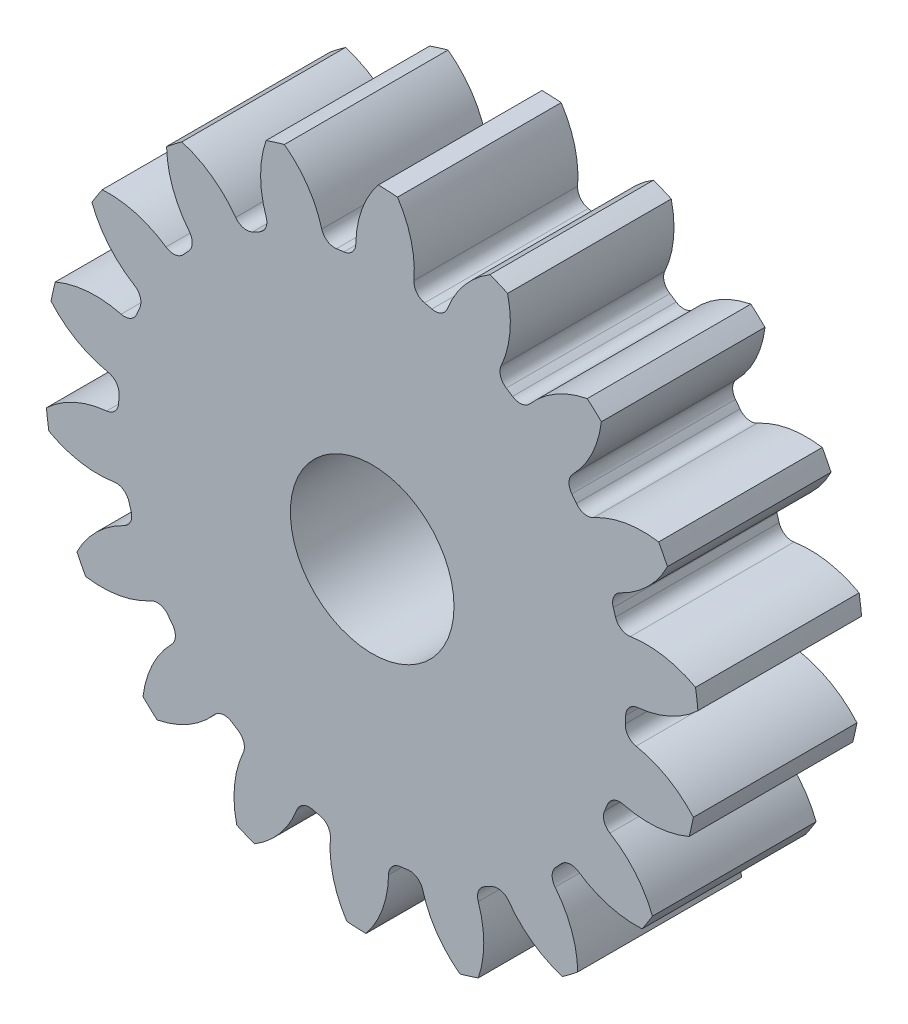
ISO-10303-21;
HEADER;
FILE_DESCRIPTION(('STEP AP214'),'2;1');
FILE_NAME('part.step','',(''),(''),'','','');
FILE_SCHEMA(('AUTOMOTIVE_DESIGN { 1 0 10303 214 1 1 1 1 }'));
ENDSEC;
DATA;
#1=APPLICATION_CONTEXT('core data for automotive mechanical design processes');
#2=APPLICATION_PROTOCOL_DEFINITION('international standard','automotive_design',2000,#1);
#3=PRODUCT_CONTEXT('',#1,'mechanical');
#4=PRODUCT('Part','Part','',(#3));
#5=PRODUCT_RELATED_PRODUCT_CATEGORY('part','',(#4));
#6=PRODUCT_DEFINITION_FORMATION('','',#4);
#7=PRODUCT_DEFINITION_CONTEXT('part definition',#1,'design');
#8=PRODUCT_DEFINITION('design','',#6,#7);
#9=PRODUCT_DEFINITION_SHAPE('','',#8);
#10=(LENGTH_UNIT() NAMED_UNIT(*) SI_UNIT(.MILLI.,.METRE.));
#11=(NAMED_UNIT(*) PLANE_ANGLE_UNIT() SI_UNIT($,.RADIAN.));
#12=(NAMED_UNIT(*) SI_UNIT($,.STERADIAN.) SOLID_ANGLE_UNIT());
#13=UNCERTAINTY_MEASURE_WITH_UNIT(LENGTH_MEASURE(1.E-05),#10,'distance_accuracy_value','');
#14=(GEOMETRIC_REPRESENTATION_CONTEXT(3) GLOBAL_UNCERTAINTY_ASSIGNED_CONTEXT((#13)) GLOBAL_UNIT_ASSIGNED_CONTEXT((#10,
#11,#12)) REPRESENTATION_CONTEXT('',''));
#15=CARTESIAN_POINT('',(0.,0.,0.));
#16=DIRECTION('',(0.,0.,1.));
#17=DIRECTION('',(1.,0.,0.));
#18=AXIS2_PLACEMENT_3D('',#15,#16,#17);
#19=CARTESIAN_POINT('',(0.,0.,101.6));
#20=DIRECTION('',(0.,0.,-1.));
#21=DIRECTION('',(-1.,0.,0.));
#22=AXIS2_PLACEMENT_3D('',#19,#20,#21);
#23=CYLINDRICAL_SURFACE('',#22,203.2);
#24=DIRECTION('',(0.,0.,-1.));
#25=VECTOR('',#24,1.);
#26=CARTESIAN_POINT('',(200.743369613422,31.5014214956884,50.8));
#27=LINE('',#26,#25);
#28=CARTESIAN_POINT('',(200.743369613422,31.5014214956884,101.6));
#29=VERTEX_POINT('',#28);
#30=CARTESIAN_POINT('',(200.743369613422,31.5014214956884,0.));
#31=VERTEX_POINT('',#30);
#32=EDGE_CURVE('E744',#29,#31,#27,.T.);
#33=ORIENTED_EDGE('',*,*,#32,.F.);
#34=CARTESIAN_POINT('',(0.,0.,101.6));
#35=DIRECTION('',(0.,0.,1.));
#36=DIRECTION('',(1.,0.,0.));
#37=AXIS2_PLACEMENT_3D('',#34,#35,#36);
#38=CIRCLE('',#37,203.2);
#39=CARTESIAN_POINT('',(202.245897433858,19.668171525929,101.6));
#40=VERTEX_POINT('',#39);
#41=EDGE_CURVE('E1389',#40,#29,#38,.T.);
#42=ORIENTED_EDGE('',*,*,#41,.F.);
#43=DIRECTION('',(0.,0.,-1.));
#44=VECTOR('',#43,1.);
#45=CARTESIAN_POINT('',(202.245897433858,19.668171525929,50.8));
#46=LINE('',#45,#44);
#47=CARTESIAN_POINT('',(202.245897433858,19.668171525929,0.));
#48=VERTEX_POINT('',#47);
#49=EDGE_CURVE('E1383',#48,#40,#46,.F.);
#50=ORIENTED_EDGE('',*,*,#49,.F.);
#51=CARTESIAN_POINT('',(0.,0.,0.));
#52=DIRECTION('',(0.,0.,1.));
#53=DIRECTION('',(1.,0.,0.));
#54=AXIS2_PLACEMENT_3D('',#51,#52,#53);
#55=CIRCLE('',#54,203.2);
#56=EDGE_CURVE('E1394',#48,#31,#55,.T.);
#57=ORIENTED_EDGE('',*,*,#56,.T.);
#58=EDGE_LOOP('',(#33,#42,#50,#57));
#59=FACE_BOUND('',#58,.T.);
#60=ADVANCED_FACE('F33',(#59),#23,.T.);
#61=DIRECTION('',(0.,0.,-1.));
#62=VECTOR('',#61,1.);
#63=CARTESIAN_POINT('',(183.322066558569,87.6542064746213,50.8));
#64=LINE('',#63,#62);
#65=CARTESIAN_POINT('',(183.322066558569,87.6542064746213,0.));
#66=VERTEX_POINT('',#65);
#67=CARTESIAN_POINT('',(183.322066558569,87.6542064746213,101.6));
#68=VERTEX_POINT('',#67);
#69=EDGE_CURVE('E715',#66,#68,#64,.F.);
#70=ORIENTED_EDGE('',*,*,#69,.F.);
#71=CARTESIAN_POINT('',(177.862942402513,98.2599293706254,0.));
#72=VERTEX_POINT('',#71);
#73=EDGE_CURVE('E1397',#66,#72,#55,.T.);
#74=ORIENTED_EDGE('',*,*,#73,.T.);
#75=DIRECTION('',(0.,0.,-1.));
#76=VECTOR('',#75,1.);
#77=CARTESIAN_POINT('',(177.862942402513,98.2599293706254,50.8));
#78=LINE('',#77,#76);
#79=CARTESIAN_POINT('',(177.862942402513,98.2599293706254,101.6));
#80=VERTEX_POINT('',#79);
#81=EDGE_CURVE('E777',#80,#72,#78,.T.);
#82=ORIENTED_EDGE('',*,*,#81,.F.);
#83=EDGE_CURVE('E1392',#68,#80,#38,.T.);
#84=ORIENTED_EDGE('',*,*,#83,.F.);
#85=EDGE_LOOP('',(#70,#74,#82,#84));
#86=FACE_BOUND('',#85,.T.);
#87=ADVANCED_FACE('F1601',(#86),#23,.T.);
#88=CARTESIAN_POINT('',(0.,0.,101.6));
#89=DIRECTION('',(0.,0.,1.));
#90=DIRECTION('',(1.,0.,0.));
#91=AXIS2_PLACEMENT_3D('',#88,#89,#90);
#92=PLANE('',#91);
#93=CARTESIAN_POINT('',(0.,0.,101.599999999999));
#94=DIRECTION('',(0.,0.,1.));
#95=DIRECTION('',(1.,0.,0.));
#96=AXIS2_PLACEMENT_3D('',#93,#94,#95);
#97=CIRCLE('',#96,50.8);
#98=CARTESIAN_POINT('',(50.8,0.,101.599999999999));
#99=VERTEX_POINT('',#98);
#100=EDGE_CURVE('E732',#99,#99,#97,.T.);
#101=ORIENTED_EDGE('',*,*,#100,.F.);
#102=EDGE_LOOP('',(#101));
#103=FACE_BOUND('',#102,.T.);
#104=ORIENTED_EDGE('',*,*,#41,.T.);
#105=CARTESIAN_POINT('',(170.167181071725,-23.9977507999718,101.6));
#106=DIRECTION('',(0.,0.,-1.));
#107=DIRECTION('',(0.939692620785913,0.342020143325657,0.));
#108=AXIS2_PLACEMENT_3D('',#105,#106,#107);
#109=CIRCLE('',#108,63.364512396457);
#110=CARTESIAN_POINT('',(160.303953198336,38.5944065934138,101.6));
#111=VERTEX_POINT('',#110);
#112=EDGE_CURVE('E724',#111,#29,#109,.T.);
#113=ORIENTED_EDGE('',*,*,#112,.F.);
#114=CARTESIAN_POINT('',(159.016619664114,46.7638399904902,101.6));
#115=DIRECTION('',(0.,0.,1.));
#116=DIRECTION('',(-0.939692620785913,-0.342020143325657,0.));
#117=AXIS2_PLACEMENT_3D('',#114,#115,#116);
#118=CIRCLE('',#117,8.27024000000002);
#119=CARTESIAN_POINT('',(151.082359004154,44.4305210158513,101.6));
#120=VERTEX_POINT('',#119);
#121=EDGE_CURVE('E722',#120,#111,#118,.T.);
#122=ORIENTED_EDGE('',*,*,#121,.F.);
#123=CARTESIAN_POINT('',(0.,0.,101.6));
#124=DIRECTION('',(0.,0.,-1.));
#125=DIRECTION('',(0.939692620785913,0.342020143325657,0.));
#126=AXIS2_PLACEMENT_3D('',#123,#124,#125);
#127=CIRCLE('',#126,157.48);
#128=CARTESIAN_POINT('',(149.699857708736,48.8866341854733,101.6));
#129=VERTEX_POINT('',#128);
#130=EDGE_CURVE('E707',#129,#120,#127,.T.);
#131=ORIENTED_EDGE('',*,*,#130,.F.);
#132=CARTESIAN_POINT('',(157.561514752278,51.4539709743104,101.6));
#133=DIRECTION('',(0.,0.,1.));
#134=DIRECTION('',(-0.939692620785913,-0.342020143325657,0.));
#135=AXIS2_PLACEMENT_3D('',#132,#133,#134);
#136=CIRCLE('',#135,8.27024000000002);
#137=CARTESIAN_POINT('',(153.998761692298,58.9174594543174,101.6));
#138=VERTEX_POINT('',#137);
#139=EDGE_CURVE('E699',#138,#129,#136,.T.);
#140=ORIENTED_EDGE('',*,*,#139,.F.);
#141=CARTESIAN_POINT('',(126.70183797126,116.100843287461,101.6));
#142=DIRECTION('',(0.,0.,-1.));
#143=DIRECTION('',(-0.939692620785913,-0.342020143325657,0.));
#144=AXIS2_PLACEMENT_3D('',#141,#142,#143);
#145=CIRCLE('',#144,63.364512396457);
#146=EDGE_CURVE('E729',#68,#138,#145,.T.);
#147=ORIENTED_EDGE('',*,*,#146,.F.);
#148=ORIENTED_EDGE('',*,*,#83,.T.);
#149=CARTESIAN_POINT('',(168.11255852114,35.650094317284,101.6));
#150=DIRECTION('',(0.,0.,-1.));
#151=DIRECTION('',(0.766044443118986,0.64278760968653,0.));
#152=AXIS2_PLACEMENT_3D('',#149,#150,#151);
#153=CIRCLE('',#152,63.364512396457);
#154=CARTESIAN_POINT('',(137.436377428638,91.0940601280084,101.6));
#155=VERTEX_POINT('',#154);
#156=EDGE_CURVE('E753',#155,#80,#153,.T.);
#157=ORIENTED_EDGE('',*,*,#156,.F.);
#158=CARTESIAN_POINT('',(133.432568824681,98.3305224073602,101.6));
#159=DIRECTION('',(0.,0.,1.));
#160=DIRECTION('',(-0.766044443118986,-0.64278760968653,0.));
#161=AXIS2_PLACEMENT_3D('',#158,#159,#160);
#162=CIRCLE('',#161,8.27024000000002);
#163=CARTESIAN_POINT('',(126.774844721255,93.4242428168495,101.6));
#164=VERTEX_POINT('',#163);
#165=EDGE_CURVE('E751',#164,#155,#162,.T.);
#166=ORIENTED_EDGE('',*,*,#165,.F.);
#167=CARTESIAN_POINT('',(0.,0.,101.6));
#168=DIRECTION('',(0.,0.,-1.));
#169=DIRECTION('',(0.766044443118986,0.64278760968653,0.));
#170=AXIS2_PLACEMENT_3D('',#167,#168,#169);
#171=CIRCLE('',#170,157.48);
#172=CARTESIAN_POINT('',(123.951637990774,97.1387761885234,101.6));
#173=VERTEX_POINT('',#172);
#174=EDGE_CURVE('E748',#173,#164,#171,.T.);
#175=ORIENTED_EDGE('',*,*,#174,.F.);
#176=CARTESIAN_POINT('',(130.461098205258,102.240128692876,101.6));
#177=DIRECTION('',(0.,0.,1.));
#178=DIRECTION('',(-0.766044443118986,-0.64278760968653,0.));
#179=AXIS2_PLACEMENT_3D('',#176,#177,#178);
#180=CIRCLE('',#179,8.27024000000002);
#181=CARTESIAN_POINT('',(124.56054204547,108.03498043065,101.6));
#182=VERTEX_POINT('',#181);
#183=EDGE_CURVE('E746',#182,#173,#180,.T.);
#184=ORIENTED_EDGE('',*,*,#183,.F.);
#185=CARTESIAN_POINT('',(79.3519551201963,152.433686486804,101.6));
#186=DIRECTION('',(0.,0.,-1.));
#187=DIRECTION('',(-0.766044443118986,-0.64278760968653,0.));
#188=AXIS2_PLACEMENT_3D('',#185,#186,#187);
#189=CIRCLE('',#188,63.364512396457);
#190=CARTESIAN_POINT('',(142.286888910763,145.067850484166,101.6));
#191=VERTEX_POINT('',#190);
#192=EDGE_CURVE('E756',#191,#182,#189,.T.);
#193=ORIENTED_EDGE('',*,*,#192,.F.);
#194=CARTESIAN_POINT('',(133.529619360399,153.166839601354,101.6));
#195=VERTEX_POINT('',#194);
#196=EDGE_CURVE('E1441',#191,#195,#38,.T.);
#197=ORIENTED_EDGE('',*,*,#196,.T.);
#198=CARTESIAN_POINT('',(145.781080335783,90.9980119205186,101.6));
#199=DIRECTION('',(0.,0.,-1.));
#200=DIRECTION('',(0.50000000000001,0.866025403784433,0.));
#201=AXIS2_PLACEMENT_3D('',#198,#199,#200);
#202=CIRCLE('',#201,63.364512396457);
#203=CARTESIAN_POINT('',(97.9919461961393,132.606425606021,101.6));
#204=VERTEX_POINT('',#203);
#205=EDGE_CURVE('E788',#204,#195,#202,.T.);
#206=ORIENTED_EDGE('',*,*,#205,.F.);
#207=CARTESIAN_POINT('',(91.7545809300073,138.037092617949,101.6));
#208=DIRECTION('',(0.,0.,1.));
#209=DIRECTION('',(-0.50000000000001,-0.866025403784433,0.));
#210=AXIS2_PLACEMENT_3D('',#207,#208,#209);
#211=CIRCLE('',#210,8.27024000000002);
#212=CARTESIAN_POINT('',(87.1764131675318,131.149622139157,101.6));
#213=VERTEX_POINT('',#212);
#214=EDGE_CURVE('E786',#213,#204,#211,.T.);
#215=ORIENTED_EDGE('',*,*,#214,.F.);
#216=CARTESIAN_POINT('',(0.,0.,101.6));
#217=DIRECTION('',(0.,0.,-1.));
#218=DIRECTION('',(0.50000000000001,0.866025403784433,0.));
#219=AXIS2_PLACEMENT_3D('',#216,#217,#218);
#220=CIRCLE('',#219,157.48);
#221=CARTESIAN_POINT('',(83.253021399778,133.674548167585,101.6));
#222=VERTEX_POINT('',#221);
#223=EDGE_CURVE('E783',#222,#213,#220,.T.);
#224=ORIENTED_EDGE('',*,*,#223,.F.);
#225=CARTESIAN_POINT('',(87.625147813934,140.694617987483,101.6));
#226=DIRECTION('',(0.,0.,1.));
#227=DIRECTION('',(-0.50000000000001,-0.866025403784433,0.));
#228=AXIS2_PLACEMENT_3D('',#225,#226,#227);
#229=CIRCLE('',#228,8.27024000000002);
#230=CARTESIAN_POINT('',(80.0984827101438,144.121888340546,101.6));
#231=VERTEX_POINT('',#230);
#232=EDGE_CURVE('E781',#231,#222,#229,.T.);
#233=ORIENTED_EDGE('',*,*,#232,.F.);
#234=CARTESIAN_POINT('',(22.4310553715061,170.380777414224,101.6));
#235=DIRECTION('',(0.,0.,-1.));
#236=DIRECTION('',(-0.50000000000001,-0.866025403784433,0.));
#237=AXIS2_PLACEMENT_3D('',#234,#235,#236);
#238=CIRCLE('',#237,63.364512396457);
#239=CARTESIAN_POINT('',(84.0898125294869,184.984170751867,101.6));
#240=VERTEX_POINT('',#239);
#241=EDGE_CURVE('E791',#240,#231,#238,.T.);
#242=ORIENTED_EDGE('',*,*,#241,.F.);
#243=CARTESIAN_POINT('',(73.0906535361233,189.599568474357,101.6));
#244=VERTEX_POINT('',#243);
#245=EDGE_CURVE('E1583',#240,#244,#38,.T.);
#246=ORIENTED_EDGE('',*,*,#245,.T.);
#247=CARTESIAN_POINT('',(105.866252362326,135.370226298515,101.6));
#248=DIRECTION('',(0.,0.,-1.));
#249=DIRECTION('',(0.17364817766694,0.984807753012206,0.));
#250=AXIS2_PLACEMENT_3D('',#247,#248,#249);
#251=CIRCLE('',#250,63.364512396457);
#252=CARTESIAN_POINT('',(46.7282400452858,158.124499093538,101.6));
#253=VERTEX_POINT('',#252);
#254=EDGE_CURVE('E826',#253,#244,#251,.T.);
#255=ORIENTED_EDGE('',*,*,#254,.F.);
#256=CARTESIAN_POINT('',(39.0096364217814,161.094352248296,101.6));
#257=DIRECTION('',(0.,0.,1.));
#258=DIRECTION('',(-0.17364817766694,-0.984807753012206,0.));
#259=AXIS2_PLACEMENT_3D('',#256,#257,#258);
#260=CIRCLE('',#259,8.27024000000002);
#261=CARTESIAN_POINT('',(37.0632195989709,153.056421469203,101.6));
#262=VERTEX_POINT('',#261);
#263=EDGE_CURVE('E824',#262,#253,#260,.T.);
#264=ORIENTED_EDGE('',*,*,#263,.F.);
#265=CARTESIAN_POINT('',(0.,0.,101.6));
#266=DIRECTION('',(0.,0.,-1.));
#267=DIRECTION('',(0.17364817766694,0.984807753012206,0.));
#268=AXIS2_PLACEMENT_3D('',#265,#266,#267);
#269=CIRCLE('',#268,157.48);
#270=CARTESIAN_POINT('',(32.5128617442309,154.087196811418,101.6));
#271=VERTEX_POINT('',#270);
#272=EDGE_CURVE('E821',#271,#262,#269,.T.);
#273=ORIENTED_EDGE('',*,*,#272,.F.);
#274=CARTESIAN_POINT('',(34.2203113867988,162.179259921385,101.6));
#275=DIRECTION('',(0.,0.,1.));
#276=DIRECTION('',(-0.17364817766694,-0.984807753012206,0.));
#277=AXIS2_PLACEMENT_3D('',#274,#275,#276);
#278=CIRCLE('',#277,8.27024000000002);
#279=CARTESIAN_POINT('',(25.9753642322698,162.825569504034,101.6));
#280=VERTEX_POINT('',#279);
#281=EDGE_CURVE('E819',#280,#271,#278,.T.);
#282=ORIENTED_EDGE('',*,*,#281,.F.);
#283=CARTESIAN_POINT('',(-37.1953607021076,167.777432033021,101.6));
#284=DIRECTION('',(0.,0.,-1.));
#285=DIRECTION('',(-0.17364817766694,-0.984807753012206,0.));
#286=AXIS2_PLACEMENT_3D('',#283,#284,#285);
#287=CIRCLE('',#286,63.364512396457);
#288=CARTESIAN_POINT('',(15.7502637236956,202.588669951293,101.6));
#289=VERTEX_POINT('',#288);
#290=EDGE_CURVE('E829',#289,#280,#287,.T.);
#291=ORIENTED_EDGE('',*,*,#290,.F.);
#292=CARTESIAN_POINT('',(3.83587619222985,203.163791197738,101.6));
#293=VERTEX_POINT('',#292);
#294=EDGE_CURVE('E1579',#289,#293,#38,.T.);
#295=ORIENTED_EDGE('',*,*,#294,.T.);
#296=CARTESIAN_POINT('',(53.1823919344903,163.414793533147,101.6));
#297=DIRECTION('',(0.,0.,-1.));
#298=DIRECTION('',(-0.173648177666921,0.98480775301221,0.));
#299=AXIS2_PLACEMENT_3D('',#296,#297,#298);
#300=CIRCLE('',#299,63.364512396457);
#301=CARTESIAN_POINT('',(-10.1715814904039,164.570424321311,101.6));
#302=VERTEX_POINT('',#301);
#303=EDGE_CURVE('E864',#302,#293,#300,.T.);
#304=ORIENTED_EDGE('',*,*,#303,.F.);
#305=CARTESIAN_POINT('',(-18.4404459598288,164.721255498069,101.6));
#306=DIRECTION('',(0.,0.,1.));
#307=DIRECTION('',(0.173648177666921,-0.98480775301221,0.));
#308=AXIS2_PLACEMENT_3D('',#305,#306,#307);
#309=CIRCLE('',#308,8.27024000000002);
#310=CARTESIAN_POINT('',(-17.5203452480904,156.502357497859,101.6));
#311=VERTEX_POINT('',#310);
#312=EDGE_CURVE('E862',#311,#302,#309,.T.);
#313=ORIENTED_EDGE('',*,*,#312,.F.);
#314=CARTESIAN_POINT('',(0.,0.,101.6));
#315=DIRECTION('',(0.,0.,-1.));
#316=DIRECTION('',(-0.173648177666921,0.98480775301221,0.));
#317=AXIS2_PLACEMENT_3D('',#314,#315,#316);
#318=CIRCLE('',#317,157.48);
#319=CARTESIAN_POINT('',(-22.1488288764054,155.914655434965,101.6));
#320=VERTEX_POINT('',#319);
#321=EDGE_CURVE('E859',#320,#311,#318,.T.);
#322=ORIENTED_EDGE('',*,*,#321,.F.);
#323=CARTESIAN_POINT('',(-23.3119996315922,164.102689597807,101.6));
#324=DIRECTION('',(0.,0.,1.));
#325=DIRECTION('',(0.173648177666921,-0.98480775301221,0.));
#326=AXIS2_PLACEMENT_3D('',#323,#324,#325);
#327=CIRCLE('',#326,8.27024000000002);
#328=CARTESIAN_POINT('',(-31.2807665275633,161.890083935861,101.6));
#329=VERTEX_POINT('',#328);
#330=EDGE_CURVE('E857',#329,#320,#327,.T.);
#331=ORIENTED_EDGE('',*,*,#330,.F.);
#332=CARTESIAN_POINT('',(-92.3354673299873,144.937652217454,101.6));
#333=DIRECTION('',(0.,0.,-1.));
#334=DIRECTION('',(0.173648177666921,-0.98480775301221,0.));
#335=AXIS2_PLACEMENT_3D('',#332,#333,#334);
#336=CIRCLE('',#335,63.364512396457);
#337=CARTESIAN_POINT('',(-54.4889993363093,195.757985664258,101.6));
#338=VERTEX_POINT('',#337);
#339=EDGE_CURVE('E867',#338,#329,#336,.T.);
#340=ORIENTED_EDGE('',*,*,#339,.F.);
#341=CARTESIAN_POINT('',(-65.8815644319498,192.223462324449,101.6));
#342=VERTEX_POINT('',#341);
#343=EDGE_CURVE('E1575',#338,#342,#38,.T.);
#344=ORIENTED_EDGE('',*,*,#343,.T.);
#345=CARTESIAN_POINT('',(-5.91604984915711,171.749124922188,101.6));
#346=DIRECTION('',(0.,0.,-1.));
#347=DIRECTION('',(-0.499999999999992,0.866025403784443,0.));
#348=AXIS2_PLACEMENT_3D('',#345,#346,#347);
#349=CIRCLE('',#348,63.364512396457);
#350=CARTESIAN_POINT('',(-65.8445601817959,151.166727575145,101.6));
#351=VERTEX_POINT('',#350);
#352=EDGE_CURVE('E902',#351,#342,#349,.T.);
#353=ORIENTED_EDGE('',*,*,#352,.F.);
#354=CARTESIAN_POINT('',(-73.6663384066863,148.480344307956,101.6));
#355=DIRECTION('',(0.,0.,1.));
#356=DIRECTION('',(0.499999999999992,-0.866025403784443,0.));
#357=AXIS2_PLACEMENT_3D('',#354,#355,#356);
#358=CIRCLE('',#357,8.27024000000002);
#359=CARTESIAN_POINT('',(-69.9906978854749,141.071799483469,101.6));
#360=VERTEX_POINT('',#359);
#361=EDGE_CURVE('E900',#360,#351,#358,.T.);
#362=ORIENTED_EDGE('',*,*,#361,.F.);
#363=CARTESIAN_POINT('',(0.,0.,101.6));
#364=DIRECTION('',(0.,0.,-1.));
#365=DIRECTION('',(-0.499999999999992,0.866025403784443,0.));
#366=AXIS2_PLACEMENT_3D('',#363,#364,#365);
#367=CIRCLE('',#366,157.48);
#368=CARTESIAN_POINT('',(-74.1390438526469,138.93650555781,101.6));
#369=VERTEX_POINT('',#368);
#370=EDGE_CURVE('E897',#369,#360,#367,.T.);
#371=ORIENTED_EDGE('',*,*,#370,.F.);
#372=CARTESIAN_POINT('',(-78.0325394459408,146.232913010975,101.6));
#373=DIRECTION('',(0.,0.,1.));
#374=DIRECTION('',(0.499999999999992,-0.866025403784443,0.));
#375=AXIS2_PLACEMENT_3D('',#372,#373,#374);
#376=CIRCLE('',#375,8.27024000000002);
#377=CARTESIAN_POINT('',(-84.763975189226,141.428265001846,101.6));
#378=VERTEX_POINT('',#377);
#379=EDGE_CURVE('E895',#378,#369,#376,.T.);
#380=ORIENTED_EDGE('',*,*,#379,.F.);
#381=CARTESIAN_POINT('',(-136.338553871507,104.616252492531,101.6));
#382=DIRECTION('',(0.,0.,-1.));
#383=DIRECTION('',(0.499999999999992,-0.866025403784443,0.));
#384=AXIS2_PLACEMENT_3D('',#381,#382,#383);
#385=CIRCLE('',#384,63.364512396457);
#386=CARTESIAN_POINT('',(-118.156084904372,165.31599922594,101.6));
#387=VERTEX_POINT('',#386);
#388=EDGE_CURVE('E905',#387,#378,#385,.T.);
#389=ORIENTED_EDGE('',*,*,#388,.F.);
#390=CARTESIAN_POINT('',(-127.652716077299,158.098146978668,101.6));
#391=VERTEX_POINT('',#390);
#392=EDGE_CURVE('E1571',#387,#391,#38,.T.);
#393=ORIENTED_EDGE('',*,*,#392,.T.);
#394=CARTESIAN_POINT('',(-64.3009287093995,159.367977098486,101.6));
#395=DIRECTION('',(0.,0.,-1.));
#396=DIRECTION('',(-0.766044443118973,0.642787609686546,0.));
#397=AXIS2_PLACEMENT_3D('',#394,#395,#396);
#398=CIRCLE('',#397,63.364512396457);
#399=CARTESIAN_POINT('',(-113.575713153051,119.530092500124,101.6));
#400=VERTEX_POINT('',#399);
#401=EDGE_CURVE('E940',#400,#391,#398,.T.);
#402=ORIENTED_EDGE('',*,*,#401,.F.);
#403=CARTESIAN_POINT('',(-120.006983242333,114.330512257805,101.6));
#404=DIRECTION('',(0.,0.,1.));
#405=DIRECTION('',(0.766044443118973,-0.642787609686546,0.));
#406=AXIS2_PLACEMENT_3D('',#403,#404,#405);
#407=CIRCLE('',#406,8.27024000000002);
#408=CARTESIAN_POINT('',(-114.019139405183,108.625900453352,101.6));
#409=VERTEX_POINT('',#408);
#410=EDGE_CURVE('E938',#409,#400,#407,.T.);
#411=ORIENTED_EDGE('',*,*,#410,.F.);
#412=CARTESIAN_POINT('',(0.,0.,101.6));
#413=DIRECTION('',(0.,0.,-1.));
#414=DIRECTION('',(-0.766044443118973,0.642787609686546,0.));
#415=AXIS2_PLACEMENT_3D('',#412,#413,#414);
#416=CIRCLE('',#415,157.48);
#417=CARTESIAN_POINT('',(-117.186995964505,105.200562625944,101.6));
#418=VERTEX_POINT('',#417);
#419=EDGE_CURVE('E935',#418,#409,#416,.T.);
#420=ORIENTED_EDGE('',*,*,#419,.F.);
#421=CARTESIAN_POINT('',(-123.34120336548,110.725288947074,101.6));
#422=DIRECTION('',(0.,0.,1.));
#423=DIRECTION('',(0.766044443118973,-0.642787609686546,0.));
#424=AXIS2_PLACEMENT_3D('',#421,#422,#423);
#425=CIRCLE('',#424,8.27024000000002);
#426=CARTESIAN_POINT('',(-128.023397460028,103.908110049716,101.6));
#427=VERTEX_POINT('',#426);
#428=EDGE_CURVE('E933',#427,#418,#425,.T.);
#429=ORIENTED_EDGE('',*,*,#428,.F.);
#430=CARTESIAN_POINT('',(-163.897198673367,51.6765887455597,101.6));
#431=DIRECTION('',(0.,0.,-1.));
#432=DIRECTION('',(0.766044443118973,-0.642787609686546,0.));
#433=AXIS2_PLACEMENT_3D('',#430,#431,#432);
#434=CIRCLE('',#433,63.364512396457);
#435=CARTESIAN_POINT('',(-167.571802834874,114.934463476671,101.6));
#436=VERTEX_POINT('',#435);
#437=EDGE_CURVE('E943',#436,#427,#434,.T.);
#438=ORIENTED_EDGE('',*,*,#437,.F.);
#439=CARTESIAN_POINT('',(-174.027066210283,104.903861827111,101.6));
#440=VERTEX_POINT('',#439);
#441=EDGE_CURVE('E1567',#436,#440,#38,.T.);
#442=ORIENTED_EDGE('',*,*,#441,.T.);
#443=CARTESIAN_POINT('',(-114.93016658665,127.764699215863,101.6));
#444=DIRECTION('',(0.,0.,-1.));
#445=DIRECTION('',(-0.939692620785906,0.342020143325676,0.));
#446=AXIS2_PLACEMENT_3D('',#443,#444,#445);
#447=CIRCLE('',#446,63.364512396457);
#448=CARTESIAN_POINT('',(-147.607958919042,73.4763641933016,101.6));
#449=VERTEX_POINT('',#448);
#450=EDGE_CURVE('E978',#449,#440,#447,.T.);
#451=ORIENTED_EDGE('',*,*,#450,.F.);
#452=CARTESIAN_POINT('',(-151.87301478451,66.3907330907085,101.6));
#453=DIRECTION('',(0.,0.,1.));
#454=DIRECTION('',(0.939692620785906,-0.342020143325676,0.));
#455=AXIS2_PLACEMENT_3D('',#452,#453,#454);
#456=CIRCLE('',#455,8.27024000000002);
#457=CARTESIAN_POINT('',(-144.295189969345,63.078114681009,101.6));
#458=VERTEX_POINT('',#457);
#459=EDGE_CURVE('E976',#458,#449,#456,.T.);
#460=ORIENTED_EDGE('',*,*,#459,.F.);
#461=CARTESIAN_POINT('',(0.,0.,101.6));
#462=DIRECTION('',(0.,0.,-1.));
#463=DIRECTION('',(-0.939692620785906,0.342020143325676,0.));
#464=AXIS2_PLACEMENT_3D('',#461,#462,#463);
#465=CIRCLE('',#464,157.48);
#466=CARTESIAN_POINT('',(-146.10046686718,58.7758792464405,101.6));
#467=VERTEX_POINT('',#466);
#468=EDGE_CURVE('E973',#467,#458,#465,.T.);
#469=ORIENTED_EDGE('',*,*,#468,.F.);
#470=CARTESIAN_POINT('',(-153.77309783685,61.8625609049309,101.6));
#471=DIRECTION('',(0.,0.,1.));
#472=DIRECTION('',(0.939692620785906,-0.342020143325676,0.));
#473=AXIS2_PLACEMENT_3D('',#470,#471,#472);
#474=CIRCLE('',#473,8.27024000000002);
#475=CARTESIAN_POINT('',(-155.841308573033,53.8551035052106,101.6));
#476=VERTEX_POINT('',#475);
#477=EDGE_CURVE('E971',#476,#467,#474,.T.);
#478=ORIENTED_EDGE('',*,*,#477,.F.);
#479=CARTESIAN_POINT('',(-171.687422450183,-7.49603426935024,101.6));
#480=DIRECTION('',(0.,0.,-1.));
#481=DIRECTION('',(0.939692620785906,-0.342020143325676,0.));
#482=AXIS2_PLACEMENT_3D('',#479,#480,#481);
#483=CIRCLE('',#482,63.364512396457);
#484=CARTESIAN_POINT('',(-196.775888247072,50.6901351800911,101.6));
#485=VERTEX_POINT('',#484);
#486=EDGE_CURVE('E981',#485,#476,#483,.T.);
#487=ORIENTED_EDGE('',*,*,#486,.F.);
#488=CARTESIAN_POINT('',(-199.411183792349,39.0566227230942,101.6));
#489=VERTEX_POINT('',#488);
#490=EDGE_CURVE('E1563',#485,#489,#38,.T.);
#491=ORIENTED_EDGE('',*,*,#490,.T.);
#492=CARTESIAN_POINT('',(-151.69713018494,80.7511130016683,101.6));
#493=DIRECTION('',(0.,0.,-1.));
#494=DIRECTION('',(-1.,0.,0.));
#495=AXIS2_PLACEMENT_3D('',#492,#493,#494);
#496=CIRCLE('',#495,63.364512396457);
#497=CARTESIAN_POINT('',(-163.836506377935,18.5603019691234,101.6));
#498=VERTEX_POINT('',#497);
#499=EDGE_CURVE('E1016',#498,#489,#496,.T.);
#500=ORIENTED_EDGE('',*,*,#499,.F.);
#501=CARTESIAN_POINT('',(-165.420919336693,10.4432516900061,101.6));
#502=DIRECTION('',(0.,0.,1.));
#503=DIRECTION('',(1.,0.,0.));
#504=AXIS2_PLACEMENT_3D('',#501,#502,#503);
#505=CIRCLE('',#504,8.27024000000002);
#506=CARTESIAN_POINT('',(-157.167111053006,9.92217734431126,101.6));
#507=VERTEX_POINT('',#506);
#508=EDGE_CURVE('E1014',#507,#498,#505,.T.);
#509=ORIENTED_EDGE('',*,*,#508,.F.);
#510=CARTESIAN_POINT('',(0.,0.,101.6));
#511=DIRECTION('',(0.,0.,-1.));
#512=DIRECTION('',(-1.,0.,0.));
#513=AXIS2_PLACEMENT_3D('',#510,#511,#512);
#514=CIRCLE('',#513,157.48);
#515=CARTESIAN_POINT('',(-157.392065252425,5.26195739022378,101.6));
#516=VERTEX_POINT('',#515);
#517=EDGE_CURVE('E1011',#516,#507,#514,.T.);
#518=ORIENTED_EDGE('',*,*,#517,.F.);
#519=CARTESIAN_POINT('',(-165.657687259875,5.53829502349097,101.6));
#520=DIRECTION('',(0.,0.,1.));
#521=DIRECTION('',(1.,0.,0.));
#522=AXIS2_PLACEMENT_3D('',#519,#520,#521);
#523=CIRCLE('',#522,8.27024000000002);
#524=CARTESIAN_POINT('',(-164.862457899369,-2.69362333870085,101.6));
#525=VERTEX_POINT('',#524);
#526=EDGE_CURVE('E1009',#525,#516,#523,.T.);
#527=ORIENTED_EDGE('',*,*,#526,.F.);
#528=CARTESIAN_POINT('',(-158.769609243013,-65.7645249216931,101.6));
#529=DIRECTION('',(0.,0.,-1.));
#530=DIRECTION('',(1.,0.,0.));
#531=AXIS2_PLACEMENT_3D('',#528,#529,#530);
#532=CIRCLE('',#531,63.364512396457);
#533=CARTESIAN_POINT('',(-202.245897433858,-19.6681715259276,101.6));
#534=VERTEX_POINT('',#533);
#535=EDGE_CURVE('E1019',#534,#525,#532,.T.);
#536=ORIENTED_EDGE('',*,*,#535,.F.);
#537=CARTESIAN_POINT('',(-200.743369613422,-31.5014214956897,101.6));
#538=VERTEX_POINT('',#537);
#539=EDGE_CURVE('E1559',#534,#538,#38,.T.);
#540=ORIENTED_EDGE('',*,*,#539,.T.);
#541=CARTESIAN_POINT('',(-170.167181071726,23.9977507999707,101.6));
#542=DIRECTION('',(0.,0.,-1.));
#543=DIRECTION('',(-0.939692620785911,-0.342020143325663,0.));
#544=AXIS2_PLACEMENT_3D('',#541,#542,#543);
#545=CIRCLE('',#544,63.364512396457);
#546=CARTESIAN_POINT('',(-160.303953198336,-38.5944065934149,101.6));
#547=VERTEX_POINT('',#546);
#548=EDGE_CURVE('E1054',#547,#538,#545,.T.);
#549=ORIENTED_EDGE('',*,*,#548,.F.);
#550=CARTESIAN_POINT('',(-159.016619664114,-46.7638399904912,101.6));
#551=DIRECTION('',(0.,0.,1.));
#552=DIRECTION('',(0.939692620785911,0.342020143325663,0.));
#553=AXIS2_PLACEMENT_3D('',#550,#551,#552);
#554=CIRCLE('',#553,8.27024000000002);
#555=CARTESIAN_POINT('',(-151.082359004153,-44.4305210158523,101.6));
#556=VERTEX_POINT('',#555);
#557=EDGE_CURVE('E1052',#556,#547,#554,.T.);
#558=ORIENTED_EDGE('',*,*,#557,.F.);
#559=CARTESIAN_POINT('',(0.,0.,101.6));
#560=DIRECTION('',(0.,0.,-1.));
#561=DIRECTION('',(-0.939692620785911,-0.342020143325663,0.));
#562=AXIS2_PLACEMENT_3D('',#559,#560,#561);
#563=CIRCLE('',#562,157.48);
#564=CARTESIAN_POINT('',(-149.699857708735,-48.8866341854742,101.6));
#565=VERTEX_POINT('',#564);
#566=EDGE_CURVE('E1049',#565,#556,#563,.T.);
#567=ORIENTED_EDGE('',*,*,#566,.F.);
#568=CARTESIAN_POINT('',(-157.561514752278,-51.4539709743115,101.6));
#569=DIRECTION('',(0.,0.,1.));
#570=DIRECTION('',(0.939692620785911,0.342020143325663,0.));
#571=AXIS2_PLACEMENT_3D('',#568,#569,#570);
#572=CIRCLE('',#571,8.27024000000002);
#573=CARTESIAN_POINT('',(-153.998761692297,-58.9174594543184,101.6));
#574=VERTEX_POINT('',#573);
#575=EDGE_CURVE('E1047',#574,#565,#572,.T.);
#576=ORIENTED_EDGE('',*,*,#575,.F.);
#577=CARTESIAN_POINT('',(-126.701837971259,-116.100843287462,101.6));
#578=DIRECTION('',(0.,0.,-1.));
#579=DIRECTION('',(0.939692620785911,0.342020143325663,0.));
#580=AXIS2_PLACEMENT_3D('',#577,#578,#579);
#581=CIRCLE('',#580,63.364512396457);
#582=CARTESIAN_POINT('',(-183.322066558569,-87.6542064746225,101.6));
#583=VERTEX_POINT('',#582);
#584=EDGE_CURVE('E1057',#583,#574,#581,.T.);
#585=ORIENTED_EDGE('',*,*,#584,.F.);
#586=CARTESIAN_POINT('',(-177.862942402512,-98.2599293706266,101.6));
#587=VERTEX_POINT('',#586);
#588=EDGE_CURVE('E1555',#583,#587,#38,.T.);
#589=ORIENTED_EDGE('',*,*,#588,.T.);
#590=CARTESIAN_POINT('',(-168.11255852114,-35.6500943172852,101.6));
#591=DIRECTION('',(0.,0.,-1.));
#592=DIRECTION('',(-0.766044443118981,-0.642787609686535,0.));
#593=AXIS2_PLACEMENT_3D('',#590,#591,#592);
#594=CIRCLE('',#593,63.364512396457);
#595=CARTESIAN_POINT('',(-137.436377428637,-91.0940601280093,101.6));
#596=VERTEX_POINT('',#595);
#597=EDGE_CURVE('E1092',#596,#587,#594,.T.);
#598=ORIENTED_EDGE('',*,*,#597,.F.);
#599=CARTESIAN_POINT('',(-133.43256882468,-98.3305224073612,101.6));
#600=DIRECTION('',(0.,0.,1.));
#601=DIRECTION('',(0.766044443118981,0.642787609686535,0.));
#602=AXIS2_PLACEMENT_3D('',#599,#600,#601);
#603=CIRCLE('',#602,8.27024000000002);
#604=CARTESIAN_POINT('',(-126.774844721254,-93.4242428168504,101.6));
#605=VERTEX_POINT('',#604);
#606=EDGE_CURVE('E1090',#605,#596,#603,.T.);
#607=ORIENTED_EDGE('',*,*,#606,.F.);
#608=CARTESIAN_POINT('',(0.,0.,101.6));
#609=DIRECTION('',(0.,0.,-1.));
#610=DIRECTION('',(-0.766044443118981,-0.642787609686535,0.));
#611=AXIS2_PLACEMENT_3D('',#608,#609,#610);
#612=CIRCLE('',#611,157.48);
#613=CARTESIAN_POINT('',(-123.951637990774,-97.1387761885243,101.6));
#614=VERTEX_POINT('',#613);
#615=EDGE_CURVE('E1087',#614,#605,#612,.T.);
#616=ORIENTED_EDGE('',*,*,#615,.F.);
#617=CARTESIAN_POINT('',(-130.461098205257,-102.240128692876,101.6));
#618=DIRECTION('',(0.,0.,1.));
#619=DIRECTION('',(0.766044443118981,0.642787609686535,0.));
#620=AXIS2_PLACEMENT_3D('',#617,#618,#619);
#621=CIRCLE('',#620,8.27024000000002);
#622=CARTESIAN_POINT('',(-124.560542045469,-108.034980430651,101.6));
#623=VERTEX_POINT('',#622);
#624=EDGE_CURVE('E1085',#623,#614,#621,.T.);
#625=ORIENTED_EDGE('',*,*,#624,.F.);
#626=CARTESIAN_POINT('',(-79.3519551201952,-152.433686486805,101.6));
#627=DIRECTION('',(0.,0.,-1.));
#628=DIRECTION('',(0.766044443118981,0.642787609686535,0.));
#629=AXIS2_PLACEMENT_3D('',#626,#627,#628);
#630=CIRCLE('',#629,63.364512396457);
#631=CARTESIAN_POINT('',(-142.286888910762,-145.067850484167,101.6));
#632=VERTEX_POINT('',#631);
#633=EDGE_CURVE('E1095',#632,#623,#630,.T.);
#634=ORIENTED_EDGE('',*,*,#633,.F.);
#635=CARTESIAN_POINT('',(-133.529619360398,-153.166839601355,101.6));
#636=VERTEX_POINT('',#635);
#637=EDGE_CURVE('E1551',#632,#636,#38,.T.);
#638=ORIENTED_EDGE('',*,*,#637,.T.);
#639=CARTESIAN_POINT('',(-145.781080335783,-90.9980119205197,101.6));
#640=DIRECTION('',(0.,0.,-1.));
#641=DIRECTION('',(-0.500000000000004,-0.866025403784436,0.));
#642=AXIS2_PLACEMENT_3D('',#639,#640,#641);
#643=CIRCLE('',#642,63.364512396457);
#644=CARTESIAN_POINT('',(-97.9919461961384,-132.606425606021,101.6));
#645=VERTEX_POINT('',#644);
#646=EDGE_CURVE('E1130',#645,#636,#643,.T.);
#647=ORIENTED_EDGE('',*,*,#646,.F.);
#648=CARTESIAN_POINT('',(-91.7545809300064,-138.03709261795,101.6));
#649=DIRECTION('',(0.,0.,1.));
#650=DIRECTION('',(0.500000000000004,0.866025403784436,0.));
#651=AXIS2_PLACEMENT_3D('',#648,#649,#650);
#652=CIRCLE('',#651,8.27024000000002);
#653=CARTESIAN_POINT('',(-87.1764131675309,-131.149622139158,101.6));
#654=VERTEX_POINT('',#653);
#655=EDGE_CURVE('E1128',#654,#645,#652,.T.);
#656=ORIENTED_EDGE('',*,*,#655,.F.);
#657=CARTESIAN_POINT('',(0.,0.,101.6));
#658=DIRECTION('',(0.,0.,-1.));
#659=DIRECTION('',(-0.500000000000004,-0.866025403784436,0.));
#660=AXIS2_PLACEMENT_3D('',#657,#658,#659);
#661=CIRCLE('',#660,157.48);
#662=CARTESIAN_POINT('',(-83.2530213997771,-133.674548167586,101.6));
#663=VERTEX_POINT('',#662);
#664=EDGE_CURVE('E1125',#663,#654,#661,.T.);
#665=ORIENTED_EDGE('',*,*,#664,.F.);
#666=CARTESIAN_POINT('',(-87.625147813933,-140.694617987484,101.6));
#667=DIRECTION('',(0.,0.,1.));
#668=DIRECTION('',(0.500000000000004,0.866025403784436,0.));
#669=AXIS2_PLACEMENT_3D('',#666,#667,#668);
#670=CIRCLE('',#669,8.27024000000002);
#671=CARTESIAN_POINT('',(-80.0984827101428,-144.121888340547,101.6));
#672=VERTEX_POINT('',#671);
#673=EDGE_CURVE('E1123',#672,#663,#670,.T.);
#674=ORIENTED_EDGE('',*,*,#673,.F.);
#675=CARTESIAN_POINT('',(-22.4310553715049,-170.380777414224,101.6));
#676=DIRECTION('',(0.,0.,-1.));
#677=DIRECTION('',(0.500000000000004,0.866025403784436,0.));
#678=AXIS2_PLACEMENT_3D('',#675,#676,#677);
#679=CIRCLE('',#678,63.364512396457);
#680=CARTESIAN_POINT('',(-84.0898125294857,-184.984170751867,101.6));
#681=VERTEX_POINT('',#680);
#682=EDGE_CURVE('E1133',#681,#672,#679,.T.);
#683=ORIENTED_EDGE('',*,*,#682,.F.);
#684=CARTESIAN_POINT('',(-73.090653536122,-189.599568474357,101.6));
#685=VERTEX_POINT('',#684);
#686=EDGE_CURVE('E1547',#681,#685,#38,.T.);
#687=ORIENTED_EDGE('',*,*,#686,.T.);
#688=CARTESIAN_POINT('',(-105.866252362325,-135.370226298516,101.6));
#689=DIRECTION('',(0.,0.,-1.));
#690=DIRECTION('',(-0.173648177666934,-0.984807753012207,0.));
#691=AXIS2_PLACEMENT_3D('',#688,#689,#690);
#692=CIRCLE('',#691,63.364512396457);
#693=CARTESIAN_POINT('',(-46.7282400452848,-158.124499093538,101.6));
#694=VERTEX_POINT('',#693);
#695=EDGE_CURVE('E1168',#694,#685,#692,.T.);
#696=ORIENTED_EDGE('',*,*,#695,.F.);
#697=CARTESIAN_POINT('',(-39.0096364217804,-161.094352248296,101.6));
#698=DIRECTION('',(0.,0.,1.));
#699=DIRECTION('',(0.173648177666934,0.984807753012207,0.));
#700=AXIS2_PLACEMENT_3D('',#697,#698,#699);
#701=CIRCLE('',#700,8.27024000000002);
#702=CARTESIAN_POINT('',(-37.0632195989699,-153.056421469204,101.6));
#703=VERTEX_POINT('',#702);
#704=EDGE_CURVE('E1166',#703,#694,#701,.T.);
#705=ORIENTED_EDGE('',*,*,#704,.F.);
#706=CARTESIAN_POINT('',(0.,0.,101.6));
#707=DIRECTION('',(0.,0.,-1.));
#708=DIRECTION('',(-0.173648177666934,-0.984807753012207,0.));
#709=AXIS2_PLACEMENT_3D('',#706,#707,#708);
#710=CIRCLE('',#709,157.48);
#711=CARTESIAN_POINT('',(-32.5128617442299,-154.087196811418,101.6));
#712=VERTEX_POINT('',#711);
#713=EDGE_CURVE('E1163',#712,#703,#710,.T.);
#714=ORIENTED_EDGE('',*,*,#713,.F.);
#715=CARTESIAN_POINT('',(-34.2203113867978,-162.179259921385,101.6));
#716=DIRECTION('',(0.,0.,1.));
#717=DIRECTION('',(0.173648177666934,0.984807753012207,0.));
#718=AXIS2_PLACEMENT_3D('',#715,#716,#717);
#719=CIRCLE('',#718,8.27024000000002);
#720=CARTESIAN_POINT('',(-25.9753642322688,-162.825569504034,101.6));
#721=VERTEX_POINT('',#720);
#722=EDGE_CURVE('E1161',#721,#712,#719,.T.);
#723=ORIENTED_EDGE('',*,*,#722,.F.);
#724=CARTESIAN_POINT('',(37.1953607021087,-167.777432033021,101.6));
#725=DIRECTION('',(0.,0.,-1.));
#726=DIRECTION('',(0.173648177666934,0.984807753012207,0.));
#727=AXIS2_PLACEMENT_3D('',#724,#725,#726);
#728=CIRCLE('',#727,63.364512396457);
#729=CARTESIAN_POINT('',(-15.7502637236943,-202.588669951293,101.6));
#730=VERTEX_POINT('',#729);
#731=EDGE_CURVE('E1171',#730,#721,#728,.T.);
#732=ORIENTED_EDGE('',*,*,#731,.F.);
#733=CARTESIAN_POINT('',(-3.83587619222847,-203.163791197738,101.6));
#734=VERTEX_POINT('',#733);
#735=EDGE_CURVE('E1543',#730,#734,#38,.T.);
#736=ORIENTED_EDGE('',*,*,#735,.T.);
#737=CARTESIAN_POINT('',(-53.1823919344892,-163.414793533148,101.6));
#738=DIRECTION('',(0.,0.,-1.));
#739=DIRECTION('',(0.173648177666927,-0.984807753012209,0.));
#740=AXIS2_PLACEMENT_3D('',#737,#738,#739);
#741=CIRCLE('',#740,63.364512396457);
#742=CARTESIAN_POINT('',(10.171581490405,-164.570424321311,101.6));
#743=VERTEX_POINT('',#742);
#744=EDGE_CURVE('E1206',#743,#734,#741,.T.);
#745=ORIENTED_EDGE('',*,*,#744,.F.);
#746=CARTESIAN_POINT('',(18.4404459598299,-164.721255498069,101.6));
#747=DIRECTION('',(0.,0.,1.));
#748=DIRECTION('',(-0.173648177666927,0.984807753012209,0.));
#749=AXIS2_PLACEMENT_3D('',#746,#747,#748);
#750=CIRCLE('',#749,8.27024000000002);
#751=CARTESIAN_POINT('',(17.5203452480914,-156.502357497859,101.6));
#752=VERTEX_POINT('',#751);
#753=EDGE_CURVE('E1204',#752,#743,#750,.T.);
#754=ORIENTED_EDGE('',*,*,#753,.F.);
#755=CARTESIAN_POINT('',(0.,0.,101.6));
#756=DIRECTION('',(0.,0.,-1.));
#757=DIRECTION('',(0.173648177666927,-0.984807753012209,0.));
#758=AXIS2_PLACEMENT_3D('',#755,#756,#757);
#759=CIRCLE('',#758,157.48);
#760=CARTESIAN_POINT('',(22.1488288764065,-155.914655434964,101.6));
#761=VERTEX_POINT('',#760);
#762=EDGE_CURVE('E1201',#761,#752,#759,.T.);
#763=ORIENTED_EDGE('',*,*,#762,.F.);
#764=CARTESIAN_POINT('',(23.3119996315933,-164.102689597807,101.6));
#765=DIRECTION('',(0.,0.,1.));
#766=DIRECTION('',(-0.173648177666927,0.984807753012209,0.));
#767=AXIS2_PLACEMENT_3D('',#764,#765,#766);
#768=CIRCLE('',#767,8.27024000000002);
#769=CARTESIAN_POINT('',(31.2807665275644,-161.890083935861,101.6));
#770=VERTEX_POINT('',#769);
#771=EDGE_CURVE('E1199',#770,#761,#768,.T.);
#772=ORIENTED_EDGE('',*,*,#771,.F.);
#773=CARTESIAN_POINT('',(92.3354673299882,-144.937652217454,101.6));
#774=DIRECTION('',(0.,0.,-1.));
#775=DIRECTION('',(-0.173648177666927,0.984807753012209,0.));
#776=AXIS2_PLACEMENT_3D('',#773,#774,#775);
#777=CIRCLE('',#776,63.364512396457);
#778=CARTESIAN_POINT('',(54.4889993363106,-195.757985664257,101.6));
#779=VERTEX_POINT('',#778);
#780=EDGE_CURVE('E1209',#779,#770,#777,.T.);
#781=ORIENTED_EDGE('',*,*,#780,.F.);
#782=CARTESIAN_POINT('',(65.8815644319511,-192.223462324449,101.6));
#783=VERTEX_POINT('',#782);
#784=EDGE_CURVE('E1539',#779,#783,#38,.T.);
#785=ORIENTED_EDGE('',*,*,#784,.T.);
#786=CARTESIAN_POINT('',(5.91604984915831,-171.749124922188,101.6));
#787=DIRECTION('',(0.,0.,-1.));
#788=DIRECTION('',(0.499999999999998,-0.86602540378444,0.));
#789=AXIS2_PLACEMENT_3D('',#786,#787,#788);
#790=CIRCLE('',#789,63.364512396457);
#791=CARTESIAN_POINT('',(65.844560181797,-151.166727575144,101.6));
#792=VERTEX_POINT('',#791);
#793=EDGE_CURVE('E1244',#792,#783,#790,.T.);
#794=ORIENTED_EDGE('',*,*,#793,.F.);
#795=CARTESIAN_POINT('',(73.6663384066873,-148.480344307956,101.6));
#796=DIRECTION('',(0.,0.,1.));
#797=DIRECTION('',(-0.499999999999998,0.86602540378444,0.));
#798=AXIS2_PLACEMENT_3D('',#795,#796,#797);
#799=CIRCLE('',#798,8.27024000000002);
#800=CARTESIAN_POINT('',(69.9906978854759,-141.071799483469,101.6));
#801=VERTEX_POINT('',#800);
#802=EDGE_CURVE('E1242',#801,#792,#799,.T.);
#803=ORIENTED_EDGE('',*,*,#802,.F.);
#804=CARTESIAN_POINT('',(0.,0.,101.6));
#805=DIRECTION('',(0.,0.,-1.));
#806=DIRECTION('',(0.499999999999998,-0.86602540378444,0.));
#807=AXIS2_PLACEMENT_3D('',#804,#805,#806);
#808=CIRCLE('',#807,157.48);
#809=CARTESIAN_POINT('',(74.1390438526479,-138.936505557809,101.6));
#810=VERTEX_POINT('',#809);
#811=EDGE_CURVE('E1239',#810,#801,#808,.T.);
#812=ORIENTED_EDGE('',*,*,#811,.F.);
#813=CARTESIAN_POINT('',(78.0325394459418,-146.232913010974,101.6));
#814=DIRECTION('',(0.,0.,1.));
#815=DIRECTION('',(-0.499999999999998,0.86602540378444,0.));
#816=AXIS2_PLACEMENT_3D('',#813,#814,#815);
#817=CIRCLE('',#816,8.27024000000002);
#818=CARTESIAN_POINT('',(84.763975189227,-141.428265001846,101.6));
#819=VERTEX_POINT('',#818);
#820=EDGE_CURVE('E1237',#819,#810,#817,.T.);
#821=ORIENTED_EDGE('',*,*,#820,.F.);
#822=CARTESIAN_POINT('',(136.338553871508,-104.61625249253,101.6));
#823=DIRECTION('',(0.,0.,-1.));
#824=DIRECTION('',(-0.499999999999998,0.86602540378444,0.));
#825=AXIS2_PLACEMENT_3D('',#822,#823,#824);
#826=CIRCLE('',#825,63.364512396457);
#827=CARTESIAN_POINT('',(118.156084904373,-165.315999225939,101.6));
#828=VERTEX_POINT('',#827);
#829=EDGE_CURVE('E1247',#828,#819,#826,.T.);
#830=ORIENTED_EDGE('',*,*,#829,.F.);
#831=CARTESIAN_POINT('',(127.6527160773,-158.098146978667,101.6));
#832=VERTEX_POINT('',#831);
#833=EDGE_CURVE('E1535',#828,#832,#38,.T.);
#834=ORIENTED_EDGE('',*,*,#833,.T.);
#835=CARTESIAN_POINT('',(64.3009287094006,-159.367977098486,101.6));
#836=DIRECTION('',(0.,0.,-1.));
#837=DIRECTION('',(0.766044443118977,-0.642787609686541,0.));
#838=AXIS2_PLACEMENT_3D('',#835,#836,#837);
#839=CIRCLE('',#838,63.364512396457);
#840=CARTESIAN_POINT('',(113.575713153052,-119.530092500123,101.6));
#841=VERTEX_POINT('',#840);
#842=EDGE_CURVE('E1282',#841,#832,#839,.T.);
#843=ORIENTED_EDGE('',*,*,#842,.F.);
#844=CARTESIAN_POINT('',(120.006983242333,-114.330512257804,101.6));
#845=DIRECTION('',(0.,0.,1.));
#846=DIRECTION('',(-0.766044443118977,0.642787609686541,0.));
#847=AXIS2_PLACEMENT_3D('',#844,#845,#846);
#848=CIRCLE('',#847,8.27024000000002);
#849=CARTESIAN_POINT('',(114.019139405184,-108.625900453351,101.6));
#850=VERTEX_POINT('',#849);
#851=EDGE_CURVE('E1280',#850,#841,#848,.T.);
#852=ORIENTED_EDGE('',*,*,#851,.F.);
#853=CARTESIAN_POINT('',(0.,0.,101.6));
#854=DIRECTION('',(0.,0.,-1.));
#855=DIRECTION('',(0.766044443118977,-0.642787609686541,0.));
#856=AXIS2_PLACEMENT_3D('',#853,#854,#855);
#857=CIRCLE('',#856,157.48);
#858=CARTESIAN_POINT('',(117.186995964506,-105.200562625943,101.6));
#859=VERTEX_POINT('',#858);
#860=EDGE_CURVE('E1277',#859,#850,#857,.T.);
#861=ORIENTED_EDGE('',*,*,#860,.F.);
#862=CARTESIAN_POINT('',(123.34120336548,-110.725288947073,101.6));
#863=DIRECTION('',(0.,0.,1.));
#864=DIRECTION('',(-0.766044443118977,0.642787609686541,0.));
#865=AXIS2_PLACEMENT_3D('',#862,#863,#864);
#866=CIRCLE('',#865,8.27024000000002);
#867=CARTESIAN_POINT('',(128.023397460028,-103.908110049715,101.6));
#868=VERTEX_POINT('',#867);
#869=EDGE_CURVE('E1275',#868,#859,#866,.T.);
#870=ORIENTED_EDGE('',*,*,#869,.F.);
#871=CARTESIAN_POINT('',(163.897198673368,-51.6765887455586,101.6));
#872=DIRECTION('',(0.,0.,-1.));
#873=DIRECTION('',(-0.766044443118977,0.642787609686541,0.));
#874=AXIS2_PLACEMENT_3D('',#871,#872,#873);
#875=CIRCLE('',#874,63.364512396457);
#876=CARTESIAN_POINT('',(167.571802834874,-114.93446347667,101.6));
#877=VERTEX_POINT('',#876);
#878=EDGE_CURVE('E1285',#877,#868,#875,.T.);
#879=ORIENTED_EDGE('',*,*,#878,.F.);
#880=CARTESIAN_POINT('',(174.027066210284,-104.90386182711,101.6));
#881=VERTEX_POINT('',#880);
#882=EDGE_CURVE('E1534',#877,#881,#38,.T.);
#883=ORIENTED_EDGE('',*,*,#882,.T.);
#884=CARTESIAN_POINT('',(114.930166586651,-127.764699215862,101.6));
#885=DIRECTION('',(0.,0.,-1.));
#886=DIRECTION('',(0.939692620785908,-0.342020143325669,0.));
#887=AXIS2_PLACEMENT_3D('',#884,#885,#886);
#888=CIRCLE('',#887,63.364512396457);
#889=CARTESIAN_POINT('',(147.607958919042,-73.4763641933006,101.6));
#890=VERTEX_POINT('',#889);
#891=EDGE_CURVE('E1320',#890,#881,#888,.T.);
#892=ORIENTED_EDGE('',*,*,#891,.F.);
#893=CARTESIAN_POINT('',(151.87301478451,-66.3907330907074,101.6));
#894=DIRECTION('',(0.,0.,1.));
#895=DIRECTION('',(-0.939692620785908,0.342020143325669,0.));
#896=AXIS2_PLACEMENT_3D('',#893,#894,#895);
#897=CIRCLE('',#896,8.27024000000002);
#898=CARTESIAN_POINT('',(144.295189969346,-63.078114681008,101.6));
#899=VERTEX_POINT('',#898);
#900=EDGE_CURVE('E1318',#899,#890,#897,.T.);
#901=ORIENTED_EDGE('',*,*,#900,.F.);
#902=CARTESIAN_POINT('',(0.,0.,101.6));
#903=DIRECTION('',(0.,0.,-1.));
#904=DIRECTION('',(0.939692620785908,-0.342020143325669,0.));
#905=AXIS2_PLACEMENT_3D('',#902,#903,#904);
#906=CIRCLE('',#905,157.48);
#907=CARTESIAN_POINT('',(146.10046686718,-58.7758792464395,101.6));
#908=VERTEX_POINT('',#907);
#909=EDGE_CURVE('E1315',#908,#899,#906,.T.);
#910=ORIENTED_EDGE('',*,*,#909,.F.);
#911=CARTESIAN_POINT('',(153.77309783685,-61.8625609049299,101.6));
#912=DIRECTION('',(0.,0.,1.));
#913=DIRECTION('',(-0.939692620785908,0.342020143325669,0.));
#914=AXIS2_PLACEMENT_3D('',#911,#912,#913);
#915=CIRCLE('',#914,8.27024000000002);
#916=CARTESIAN_POINT('',(155.841308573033,-53.8551035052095,101.6));
#917=VERTEX_POINT('',#916);
#918=EDGE_CURVE('E1313',#917,#908,#915,.T.);
#919=ORIENTED_EDGE('',*,*,#918,.F.);
#920=CARTESIAN_POINT('',(171.687422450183,7.49603426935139,101.6));
#921=DIRECTION('',(0.,0.,-1.));
#922=DIRECTION('',(-0.939692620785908,0.342020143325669,0.));
#923=AXIS2_PLACEMENT_3D('',#920,#921,#922);
#924=CIRCLE('',#923,63.364512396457);
#925=CARTESIAN_POINT('',(196.775888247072,-50.6901351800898,101.6));
#926=VERTEX_POINT('',#925);
#927=EDGE_CURVE('E1323',#926,#917,#924,.T.);
#928=ORIENTED_EDGE('',*,*,#927,.F.);
#929=CARTESIAN_POINT('',(199.411183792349,-39.0566227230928,101.6));
#930=VERTEX_POINT('',#929);
#931=EDGE_CURVE('E1393',#926,#930,#38,.T.);
#932=ORIENTED_EDGE('',*,*,#931,.T.);
#933=CARTESIAN_POINT('',(151.697130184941,-80.7511130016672,101.6));
#934=DIRECTION('',(0.,0.,-1.));
#935=DIRECTION('',(1.,0.,0.));
#936=AXIS2_PLACEMENT_3D('',#933,#934,#935);
#937=CIRCLE('',#936,63.364512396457);
#938=CARTESIAN_POINT('',(163.836506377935,-18.5603019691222,101.6));
#939=VERTEX_POINT('',#938);
#940=EDGE_CURVE('E1358',#939,#930,#937,.T.);
#941=ORIENTED_EDGE('',*,*,#940,.F.);
#942=CARTESIAN_POINT('',(165.420919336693,-10.4432516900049,101.6));
#943=DIRECTION('',(0.,0.,1.));
#944=DIRECTION('',(-1.,0.,0.));
#945=AXIS2_PLACEMENT_3D('',#942,#943,#944);
#946=CIRCLE('',#945,8.27024000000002);
#947=CARTESIAN_POINT('',(157.167111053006,-9.92217734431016,101.6));
#948=VERTEX_POINT('',#947);
#949=EDGE_CURVE('E1356',#948,#939,#946,.T.);
#950=ORIENTED_EDGE('',*,*,#949,.F.);
#951=CARTESIAN_POINT('',(0.,0.,101.6));
#952=DIRECTION('',(0.,0.,-1.));
#953=DIRECTION('',(1.,0.,0.));
#954=AXIS2_PLACEMENT_3D('',#951,#952,#953);
#955=CIRCLE('',#954,157.48);
#956=CARTESIAN_POINT('',(157.392065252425,-5.26195739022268,101.6));
#957=VERTEX_POINT('',#956);
#958=EDGE_CURVE('E1353',#957,#948,#955,.T.);
#959=ORIENTED_EDGE('',*,*,#958,.F.);
#960=CARTESIAN_POINT('',(165.657687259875,-5.53829502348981,101.6));
#961=DIRECTION('',(0.,0.,1.));
#962=DIRECTION('',(-1.,0.,0.));
#963=AXIS2_PLACEMENT_3D('',#960,#961,#962);
#964=CIRCLE('',#963,8.27024000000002);
#965=CARTESIAN_POINT('',(164.862457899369,2.693623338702,101.6));
#966=VERTEX_POINT('',#965);
#967=EDGE_CURVE('E1351',#966,#957,#964,.T.);
#968=ORIENTED_EDGE('',*,*,#967,.F.);
#969=CARTESIAN_POINT('',(158.769609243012,65.7645249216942,101.6));
#970=DIRECTION('',(0.,0.,-1.));
#971=DIRECTION('',(-1.,0.,0.));
#972=AXIS2_PLACEMENT_3D('',#969,#970,#971);
#973=CIRCLE('',#972,63.364512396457);
#974=EDGE_CURVE('E1361',#40,#966,#973,.T.);
#975=ORIENTED_EDGE('',*,*,#974,.F.);
#976=EDGE_LOOP('',(#104,#113,#122,#131,#140,#147,#148,#157,#166,#175,#184,#193,#197,#206,#215,
#224,#233,#242,#246,#255,#264,#273,#282,#291,#295,#304,#313,#322,#331,#340,#344,#353,#362,#371,
#380,#389,#393,#402,#411,#420,#429,#438,#442,#451,#460,#469,#478,#487,#491,#500,#509,#518,#527,
#536,#540,#549,#558,#567,#576,#585,#589,#598,#607,#616,#625,#634,#638,#647,#656,#665,#674,#683,
#687,#696,#705,#714,#723,#732,#736,#745,#754,#763,#772,#781,#785,#794,#803,#812,#821,#830,#834,
#843,#852,#861,#870,#879,#883,#892,#901,#910,#919,#928,#932,#941,#950,#959,#968,#975));
#977=FACE_BOUND('',#976,.T.);
#978=ADVANCED_FACE('F720',(#103,#977),#92,.T.);
#979=CARTESIAN_POINT('',(0.,0.,0.));
#980=DIRECTION('',(0.,0.,1.));
#981=DIRECTION('',(1.,0.,0.));
#982=AXIS2_PLACEMENT_3D('',#979,#980,#981);
#983=PLANE('',#982);
#984=CARTESIAN_POINT('',(0.,0.,0.));
#985=DIRECTION('',(0.,0.,1.));
#986=DIRECTION('',(1.,0.,0.));
#987=AXIS2_PLACEMENT_3D('',#984,#985,#986);
#988=CIRCLE('',#987,50.8);
#989=CARTESIAN_POINT('',(50.8,0.,-1.77635683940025E-12));
#990=VERTEX_POINT('',#989);
#991=EDGE_CURVE('E36',#990,#990,#988,.T.);
#992=ORIENTED_EDGE('',*,*,#991,.T.);
#993=EDGE_LOOP('',(#992));
#994=FACE_BOUND('',#993,.T.);
#995=CARTESIAN_POINT('',(170.167181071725,-23.9977507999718,0.));
#996=DIRECTION('',(0.,0.,-1.));
#997=DIRECTION('',(0.939692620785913,0.342020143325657,0.));
#998=AXIS2_PLACEMENT_3D('',#995,#996,#997);
#999=CIRCLE('',#998,63.364512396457);
#1000=CARTESIAN_POINT('',(160.303953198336,38.5944065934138,0.));
#1001=VERTEX_POINT('',#1000);
#1002=EDGE_CURVE('E708',#1001,#31,#999,.T.);
#1003=ORIENTED_EDGE('',*,*,#1002,.T.);
#1004=ORIENTED_EDGE('',*,*,#56,.F.);
#1005=CARTESIAN_POINT('',(158.769609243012,65.7645249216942,0.));
#1006=DIRECTION('',(0.,0.,1.));
#1007=DIRECTION('',(1.,0.,0.));
#1008=AXIS2_PLACEMENT_3D('',#1005,#1006,#1007);
#1009=CIRCLE('',#1008,63.364512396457);
#1010=CARTESIAN_POINT('',(164.862457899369,2.69362333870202,0.));
#1011=VERTEX_POINT('',#1010);
#1012=EDGE_CURVE('E1391',#1011,#48,#1009,.T.);
#1013=ORIENTED_EDGE('',*,*,#1012,.F.);
#1014=CARTESIAN_POINT('',(165.657687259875,-5.53829502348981,0.));
#1015=DIRECTION('',(0.,0.,1.));
#1016=DIRECTION('',(-1.,0.,0.));
#1017=AXIS2_PLACEMENT_3D('',#1014,#1015,#1016);
#1018=CIRCLE('',#1017,8.27024000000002);
#1019=CARTESIAN_POINT('',(157.392065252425,-5.26195739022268,0.));
#1020=VERTEX_POINT('',#1019);
#1021=EDGE_CURVE('E1350',#1011,#1020,#1018,.T.);
#1022=ORIENTED_EDGE('',*,*,#1021,.T.);
#1023=CARTESIAN_POINT('',(0.,0.,0.));
#1024=DIRECTION('',(0.,0.,-1.));
#1025=DIRECTION('',(1.,0.,0.));
#1026=AXIS2_PLACEMENT_3D('',#1023,#1024,#1025);
#1027=CIRCLE('',#1026,157.48);
#1028=CARTESIAN_POINT('',(157.167111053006,-9.92217734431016,0.));
#1029=VERTEX_POINT('',#1028);
#1030=EDGE_CURVE('E1366',#1020,#1029,#1027,.T.);
#1031=ORIENTED_EDGE('',*,*,#1030,.T.);
#1032=CARTESIAN_POINT('',(165.420919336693,-10.4432516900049,0.));
#1033=DIRECTION('',(0.,0.,1.));
#1034=DIRECTION('',(-1.,0.,0.));
#1035=AXIS2_PLACEMENT_3D('',#1032,#1033,#1034);
#1036=CIRCLE('',#1035,8.27024000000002);
#1037=CARTESIAN_POINT('',(163.836506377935,-18.5603019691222,0.));
#1038=VERTEX_POINT('',#1037);
#1039=EDGE_CURVE('E1369',#1029,#1038,#1036,.T.);
#1040=ORIENTED_EDGE('',*,*,#1039,.T.);
#1041=CARTESIAN_POINT('',(151.697130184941,-80.7511130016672,0.));
#1042=DIRECTION('',(0.,0.,-1.));
#1043=DIRECTION('',(1.,0.,0.));
#1044=AXIS2_PLACEMENT_3D('',#1041,#1042,#1043);
#1045=CIRCLE('',#1044,63.364512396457);
#1046=CARTESIAN_POINT('',(199.411183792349,-39.0566227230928,0.));
#1047=VERTEX_POINT('',#1046);
#1048=EDGE_CURVE('E1354',#1038,#1047,#1045,.T.);
#1049=ORIENTED_EDGE('',*,*,#1048,.T.);
#1050=CARTESIAN_POINT('',(196.775888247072,-50.6901351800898,0.));
#1051=VERTEX_POINT('',#1050);
#1052=EDGE_CURVE('E1388',#1051,#1047,#55,.T.);
#1053=ORIENTED_EDGE('',*,*,#1052,.F.);
#1054=CARTESIAN_POINT('',(171.687422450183,7.49603426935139,0.));
#1055=DIRECTION('',(0.,0.,1.));
#1056=DIRECTION('',(1.,0.,0.));
#1057=AXIS2_PLACEMENT_3D('',#1054,#1055,#1056);
#1058=CIRCLE('',#1057,63.364512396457);
#1059=CARTESIAN_POINT('',(155.841308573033,-53.8551035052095,0.));
#1060=VERTEX_POINT('',#1059);
#1061=EDGE_CURVE('E1399',#1060,#1051,#1058,.T.);
#1062=ORIENTED_EDGE('',*,*,#1061,.F.);
#1063=CARTESIAN_POINT('',(153.77309783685,-61.8625609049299,0.));
#1064=DIRECTION('',(0.,0.,1.));
#1065=DIRECTION('',(-0.939692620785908,0.342020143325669,0.));
#1066=AXIS2_PLACEMENT_3D('',#1063,#1064,#1065);
#1067=CIRCLE('',#1066,8.27024000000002);
#1068=CARTESIAN_POINT('',(146.10046686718,-58.7758792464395,0.));
#1069=VERTEX_POINT('',#1068);
#1070=EDGE_CURVE('E1312',#1060,#1069,#1067,.T.);
#1071=ORIENTED_EDGE('',*,*,#1070,.T.);
#1072=CARTESIAN_POINT('',(0.,0.,0.));
#1073=DIRECTION('',(0.,0.,-1.));
#1074=DIRECTION('',(0.939692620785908,-0.342020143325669,0.));
#1075=AXIS2_PLACEMENT_3D('',#1072,#1073,#1074);
#1076=CIRCLE('',#1075,157.48);
#1077=CARTESIAN_POINT('',(144.295189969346,-63.078114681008,0.));
#1078=VERTEX_POINT('',#1077);
#1079=EDGE_CURVE('E1328',#1069,#1078,#1076,.T.);
#1080=ORIENTED_EDGE('',*,*,#1079,.T.);
#1081=CARTESIAN_POINT('',(151.87301478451,-66.3907330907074,0.));
#1082=DIRECTION('',(0.,0.,1.));
#1083=DIRECTION('',(-0.939692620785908,0.342020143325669,0.));
#1084=AXIS2_PLACEMENT_3D('',#1081,#1082,#1083);
#1085=CIRCLE('',#1084,8.27024000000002);
#1086=CARTESIAN_POINT('',(147.607958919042,-73.4763641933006,0.));
#1087=VERTEX_POINT('',#1086);
#1088=EDGE_CURVE('E1331',#1078,#1087,#1085,.T.);
#1089=ORIENTED_EDGE('',*,*,#1088,.T.);
#1090=CARTESIAN_POINT('',(114.930166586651,-127.764699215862,0.));
#1091=DIRECTION('',(0.,0.,-1.));
#1092=DIRECTION('',(0.939692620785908,-0.342020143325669,0.));
#1093=AXIS2_PLACEMENT_3D('',#1090,#1091,#1092);
#1094=CIRCLE('',#1093,63.364512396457);
#1095=CARTESIAN_POINT('',(174.027066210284,-104.90386182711,0.));
#1096=VERTEX_POINT('',#1095);
#1097=EDGE_CURVE('E1316',#1087,#1096,#1094,.T.);
#1098=ORIENTED_EDGE('',*,*,#1097,.T.);
#1099=CARTESIAN_POINT('',(167.571802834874,-114.93446347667,0.));
#1100=VERTEX_POINT('',#1099);
#1101=EDGE_CURVE('E1505',#1100,#1096,#55,.T.);
#1102=ORIENTED_EDGE('',*,*,#1101,.F.);
#1103=CARTESIAN_POINT('',(163.897198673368,-51.6765887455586,0.));
#1104=DIRECTION('',(0.,0.,1.));
#1105=DIRECTION('',(1.,0.,0.));
#1106=AXIS2_PLACEMENT_3D('',#1103,#1104,#1105);
#1107=CIRCLE('',#1106,63.364512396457);
#1108=CARTESIAN_POINT('',(128.023397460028,-103.908110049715,0.));
#1109=VERTEX_POINT('',#1108);
#1110=EDGE_CURVE('E1401',#1109,#1100,#1107,.T.);
#1111=ORIENTED_EDGE('',*,*,#1110,.F.);
#1112=CARTESIAN_POINT('',(123.34120336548,-110.725288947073,0.));
#1113=DIRECTION('',(0.,0.,1.));
#1114=DIRECTION('',(-0.766044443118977,0.642787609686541,0.));
#1115=AXIS2_PLACEMENT_3D('',#1112,#1113,#1114);
#1116=CIRCLE('',#1115,8.27024000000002);
#1117=CARTESIAN_POINT('',(117.186995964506,-105.200562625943,0.));
#1118=VERTEX_POINT('',#1117);
#1119=EDGE_CURVE('E1274',#1109,#1118,#1116,.T.);
#1120=ORIENTED_EDGE('',*,*,#1119,.T.);
#1121=CARTESIAN_POINT('',(0.,0.,0.));
#1122=DIRECTION('',(0.,0.,-1.));
#1123=DIRECTION('',(0.766044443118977,-0.642787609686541,0.));
#1124=AXIS2_PLACEMENT_3D('',#1121,#1122,#1123);
#1125=CIRCLE('',#1124,157.48);
#1126=CARTESIAN_POINT('',(114.019139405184,-108.625900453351,0.));
#1127=VERTEX_POINT('',#1126);
#1128=EDGE_CURVE('E1290',#1118,#1127,#1125,.T.);
#1129=ORIENTED_EDGE('',*,*,#1128,.T.);
#1130=CARTESIAN_POINT('',(120.006983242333,-114.330512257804,0.));
#1131=DIRECTION('',(0.,0.,1.));
#1132=DIRECTION('',(-0.766044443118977,0.642787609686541,0.));
#1133=AXIS2_PLACEMENT_3D('',#1130,#1131,#1132);
#1134=CIRCLE('',#1133,8.27024000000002);
#1135=CARTESIAN_POINT('',(113.575713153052,-119.530092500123,0.));
#1136=VERTEX_POINT('',#1135);
#1137=EDGE_CURVE('E1293',#1127,#1136,#1134,.T.);
#1138=ORIENTED_EDGE('',*,*,#1137,.T.);
#1139=CARTESIAN_POINT('',(64.3009287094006,-159.367977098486,0.));
#1140=DIRECTION('',(0.,0.,-1.));
#1141=DIRECTION('',(0.766044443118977,-0.642787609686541,0.));
#1142=AXIS2_PLACEMENT_3D('',#1139,#1140,#1141);
#1143=CIRCLE('',#1142,63.364512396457);
#1144=CARTESIAN_POINT('',(127.6527160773,-158.098146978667,0.));
#1145=VERTEX_POINT('',#1144);
#1146=EDGE_CURVE('E1278',#1136,#1145,#1143,.T.);
#1147=ORIENTED_EDGE('',*,*,#1146,.T.);
#1148=CARTESIAN_POINT('',(118.156084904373,-165.315999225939,0.));
#1149=VERTEX_POINT('',#1148);
#1150=EDGE_CURVE('E1500',#1149,#1145,#55,.T.);
#1151=ORIENTED_EDGE('',*,*,#1150,.F.);
#1152=CARTESIAN_POINT('',(136.338553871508,-104.61625249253,0.));
#1153=DIRECTION('',(0.,0.,1.));
#1154=DIRECTION('',(1.,0.,0.));
#1155=AXIS2_PLACEMENT_3D('',#1152,#1153,#1154);
#1156=CIRCLE('',#1155,63.364512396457);
#1157=CARTESIAN_POINT('',(84.763975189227,-141.428265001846,0.));
#1158=VERTEX_POINT('',#1157);
#1159=EDGE_CURVE('E1403',#1158,#1149,#1156,.T.);
#1160=ORIENTED_EDGE('',*,*,#1159,.F.);
#1161=CARTESIAN_POINT('',(78.0325394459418,-146.232913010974,0.));
#1162=DIRECTION('',(0.,0.,1.));
#1163=DIRECTION('',(-0.499999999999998,0.86602540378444,0.));
#1164=AXIS2_PLACEMENT_3D('',#1161,#1162,#1163);
#1165=CIRCLE('',#1164,8.27024000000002);
#1166=CARTESIAN_POINT('',(74.1390438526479,-138.936505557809,0.));
#1167=VERTEX_POINT('',#1166);
#1168=EDGE_CURVE('E1236',#1158,#1167,#1165,.T.);
#1169=ORIENTED_EDGE('',*,*,#1168,.T.);
#1170=CARTESIAN_POINT('',(0.,0.,0.));
#1171=DIRECTION('',(0.,0.,-1.));
#1172=DIRECTION('',(0.499999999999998,-0.86602540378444,0.));
#1173=AXIS2_PLACEMENT_3D('',#1170,#1171,#1172);
#1174=CIRCLE('',#1173,157.48);
#1175=CARTESIAN_POINT('',(69.9906978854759,-141.071799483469,0.));
#1176=VERTEX_POINT('',#1175);
#1177=EDGE_CURVE('E1252',#1167,#1176,#1174,.T.);
#1178=ORIENTED_EDGE('',*,*,#1177,.T.);
#1179=CARTESIAN_POINT('',(73.6663384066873,-148.480344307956,0.));
#1180=DIRECTION('',(0.,0.,1.));
#1181=DIRECTION('',(-0.499999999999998,0.86602540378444,0.));
#1182=AXIS2_PLACEMENT_3D('',#1179,#1180,#1181);
#1183=CIRCLE('',#1182,8.27024000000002);
#1184=CARTESIAN_POINT('',(65.844560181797,-151.166727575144,0.));
#1185=VERTEX_POINT('',#1184);
#1186=EDGE_CURVE('E1255',#1176,#1185,#1183,.T.);
#1187=ORIENTED_EDGE('',*,*,#1186,.T.);
#1188=CARTESIAN_POINT('',(5.91604984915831,-171.749124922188,0.));
#1189=DIRECTION('',(0.,0.,-1.));
#1190=DIRECTION('',(0.499999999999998,-0.86602540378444,0.));
#1191=AXIS2_PLACEMENT_3D('',#1188,#1189,#1190);
#1192=CIRCLE('',#1191,63.364512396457);
#1193=CARTESIAN_POINT('',(65.8815644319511,-192.223462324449,0.));
#1194=VERTEX_POINT('',#1193);
#1195=EDGE_CURVE('E1240',#1185,#1194,#1192,.T.);
#1196=ORIENTED_EDGE('',*,*,#1195,.T.);
#1197=CARTESIAN_POINT('',(54.4889993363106,-195.757985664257,0.));
#1198=VERTEX_POINT('',#1197);
#1199=EDGE_CURVE('E1495',#1198,#1194,#55,.T.);
#1200=ORIENTED_EDGE('',*,*,#1199,.F.);
#1201=CARTESIAN_POINT('',(92.3354673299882,-144.937652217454,0.));
#1202=DIRECTION('',(0.,0.,1.));
#1203=DIRECTION('',(1.,0.,0.));
#1204=AXIS2_PLACEMENT_3D('',#1201,#1202,#1203);
#1205=CIRCLE('',#1204,63.364512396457);
#1206=CARTESIAN_POINT('',(31.2807665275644,-161.890083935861,0.));
#1207=VERTEX_POINT('',#1206);
#1208=EDGE_CURVE('E1405',#1207,#1198,#1205,.T.);
#1209=ORIENTED_EDGE('',*,*,#1208,.F.);
#1210=CARTESIAN_POINT('',(23.3119996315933,-164.102689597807,0.));
#1211=DIRECTION('',(0.,0.,1.));
#1212=DIRECTION('',(-0.173648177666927,0.984807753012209,0.));
#1213=AXIS2_PLACEMENT_3D('',#1210,#1211,#1212);
#1214=CIRCLE('',#1213,8.27024000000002);
#1215=CARTESIAN_POINT('',(22.1488288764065,-155.914655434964,0.));
#1216=VERTEX_POINT('',#1215);
#1217=EDGE_CURVE('E1198',#1207,#1216,#1214,.T.);
#1218=ORIENTED_EDGE('',*,*,#1217,.T.);
#1219=CARTESIAN_POINT('',(0.,0.,0.));
#1220=DIRECTION('',(0.,0.,-1.));
#1221=DIRECTION('',(0.173648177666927,-0.984807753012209,0.));
#1222=AXIS2_PLACEMENT_3D('',#1219,#1220,#1221);
#1223=CIRCLE('',#1222,157.48);
#1224=CARTESIAN_POINT('',(17.5203452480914,-156.502357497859,0.));
#1225=VERTEX_POINT('',#1224);
#1226=EDGE_CURVE('E1214',#1216,#1225,#1223,.T.);
#1227=ORIENTED_EDGE('',*,*,#1226,.T.);
#1228=CARTESIAN_POINT('',(18.4404459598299,-164.721255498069,0.));
#1229=DIRECTION('',(0.,0.,1.));
#1230=DIRECTION('',(-0.173648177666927,0.984807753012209,0.));
#1231=AXIS2_PLACEMENT_3D('',#1228,#1229,#1230);
#1232=CIRCLE('',#1231,8.27024000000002);
#1233=CARTESIAN_POINT('',(10.171581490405,-164.570424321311,0.));
#1234=VERTEX_POINT('',#1233);
#1235=EDGE_CURVE('E1217',#1225,#1234,#1232,.T.);
#1236=ORIENTED_EDGE('',*,*,#1235,.T.);
#1237=CARTESIAN_POINT('',(-53.1823919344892,-163.414793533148,0.));
#1238=DIRECTION('',(0.,0.,-1.));
#1239=DIRECTION('',(0.173648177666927,-0.984807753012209,0.));
#1240=AXIS2_PLACEMENT_3D('',#1237,#1238,#1239);
#1241=CIRCLE('',#1240,63.364512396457);
#1242=CARTESIAN_POINT('',(-3.83587619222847,-203.163791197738,0.));
#1243=VERTEX_POINT('',#1242);
#1244=EDGE_CURVE('E1202',#1234,#1243,#1241,.T.);
#1245=ORIENTED_EDGE('',*,*,#1244,.T.);
#1246=CARTESIAN_POINT('',(-15.7502637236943,-202.588669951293,0.));
#1247=VERTEX_POINT('',#1246);
#1248=EDGE_CURVE('E1490',#1247,#1243,#55,.T.);
#1249=ORIENTED_EDGE('',*,*,#1248,.F.);
#1250=CARTESIAN_POINT('',(37.1953607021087,-167.777432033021,0.));
#1251=DIRECTION('',(0.,0.,1.));
#1252=DIRECTION('',(1.,0.,0.));
#1253=AXIS2_PLACEMENT_3D('',#1250,#1251,#1252);
#1254=CIRCLE('',#1253,63.364512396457);
#1255=CARTESIAN_POINT('',(-25.9753642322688,-162.825569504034,0.));
#1256=VERTEX_POINT('',#1255);
#1257=EDGE_CURVE('E1407',#1256,#1247,#1254,.T.);
#1258=ORIENTED_EDGE('',*,*,#1257,.F.);
#1259=CARTESIAN_POINT('',(-34.2203113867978,-162.179259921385,0.));
#1260=DIRECTION('',(0.,0.,1.));
#1261=DIRECTION('',(0.173648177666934,0.984807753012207,0.));
#1262=AXIS2_PLACEMENT_3D('',#1259,#1260,#1261);
#1263=CIRCLE('',#1262,8.27024000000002);
#1264=CARTESIAN_POINT('',(-32.5128617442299,-154.087196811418,0.));
#1265=VERTEX_POINT('',#1264);
#1266=EDGE_CURVE('E1160',#1256,#1265,#1263,.T.);
#1267=ORIENTED_EDGE('',*,*,#1266,.T.);
#1268=CARTESIAN_POINT('',(0.,0.,0.));
#1269=DIRECTION('',(0.,0.,-1.));
#1270=DIRECTION('',(-0.173648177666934,-0.984807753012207,0.));
#1271=AXIS2_PLACEMENT_3D('',#1268,#1269,#1270);
#1272=CIRCLE('',#1271,157.48);
#1273=CARTESIAN_POINT('',(-37.0632195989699,-153.056421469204,0.));
#1274=VERTEX_POINT('',#1273);
#1275=EDGE_CURVE('E1176',#1265,#1274,#1272,.T.);
#1276=ORIENTED_EDGE('',*,*,#1275,.T.);
#1277=CARTESIAN_POINT('',(-39.0096364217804,-161.094352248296,0.));
#1278=DIRECTION('',(0.,0.,1.));
#1279=DIRECTION('',(0.173648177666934,0.984807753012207,0.));
#1280=AXIS2_PLACEMENT_3D('',#1277,#1278,#1279);
#1281=CIRCLE('',#1280,8.27024000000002);
#1282=CARTESIAN_POINT('',(-46.7282400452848,-158.124499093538,0.));
#1283=VERTEX_POINT('',#1282);
#1284=EDGE_CURVE('E1179',#1274,#1283,#1281,.T.);
#1285=ORIENTED_EDGE('',*,*,#1284,.T.);
#1286=CARTESIAN_POINT('',(-105.866252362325,-135.370226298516,0.));
#1287=DIRECTION('',(0.,0.,-1.));
#1288=DIRECTION('',(-0.173648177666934,-0.984807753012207,0.));
#1289=AXIS2_PLACEMENT_3D('',#1286,#1287,#1288);
#1290=CIRCLE('',#1289,63.364512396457);
#1291=CARTESIAN_POINT('',(-73.090653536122,-189.599568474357,0.));
#1292=VERTEX_POINT('',#1291);
#1293=EDGE_CURVE('E1164',#1283,#1292,#1290,.T.);
#1294=ORIENTED_EDGE('',*,*,#1293,.T.);
#1295=CARTESIAN_POINT('',(-84.0898125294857,-184.984170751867,0.));
#1296=VERTEX_POINT('',#1295);
#1297=EDGE_CURVE('E1485',#1296,#1292,#55,.T.);
#1298=ORIENTED_EDGE('',*,*,#1297,.F.);
#1299=CARTESIAN_POINT('',(-22.4310553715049,-170.380777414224,0.));
#1300=DIRECTION('',(0.,0.,1.));
#1301=DIRECTION('',(1.,0.,0.));
#1302=AXIS2_PLACEMENT_3D('',#1299,#1300,#1301);
#1303=CIRCLE('',#1302,63.364512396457);
#1304=CARTESIAN_POINT('',(-80.0984827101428,-144.121888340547,0.));
#1305=VERTEX_POINT('',#1304);
#1306=EDGE_CURVE('E1409',#1305,#1296,#1303,.T.);
#1307=ORIENTED_EDGE('',*,*,#1306,.F.);
#1308=CARTESIAN_POINT('',(-87.625147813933,-140.694617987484,0.));
#1309=DIRECTION('',(0.,0.,1.));
#1310=DIRECTION('',(0.500000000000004,0.866025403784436,0.));
#1311=AXIS2_PLACEMENT_3D('',#1308,#1309,#1310);
#1312=CIRCLE('',#1311,8.27024000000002);
#1313=CARTESIAN_POINT('',(-83.2530213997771,-133.674548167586,0.));
#1314=VERTEX_POINT('',#1313);
#1315=EDGE_CURVE('E1122',#1305,#1314,#1312,.T.);
#1316=ORIENTED_EDGE('',*,*,#1315,.T.);
#1317=CARTESIAN_POINT('',(0.,0.,0.));
#1318=DIRECTION('',(0.,0.,-1.));
#1319=DIRECTION('',(-0.500000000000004,-0.866025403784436,0.));
#1320=AXIS2_PLACEMENT_3D('',#1317,#1318,#1319);
#1321=CIRCLE('',#1320,157.48);
#1322=CARTESIAN_POINT('',(-87.1764131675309,-131.149622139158,0.));
#1323=VERTEX_POINT('',#1322);
#1324=EDGE_CURVE('E1138',#1314,#1323,#1321,.T.);
#1325=ORIENTED_EDGE('',*,*,#1324,.T.);
#1326=CARTESIAN_POINT('',(-91.7545809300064,-138.03709261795,0.));
#1327=DIRECTION('',(0.,0.,1.));
#1328=DIRECTION('',(0.500000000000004,0.866025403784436,0.));
#1329=AXIS2_PLACEMENT_3D('',#1326,#1327,#1328);
#1330=CIRCLE('',#1329,8.27024000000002);
#1331=CARTESIAN_POINT('',(-97.9919461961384,-132.606425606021,0.));
#1332=VERTEX_POINT('',#1331);
#1333=EDGE_CURVE('E1141',#1323,#1332,#1330,.T.);
#1334=ORIENTED_EDGE('',*,*,#1333,.T.);
#1335=CARTESIAN_POINT('',(-145.781080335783,-90.9980119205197,0.));
#1336=DIRECTION('',(0.,0.,-1.));
#1337=DIRECTION('',(-0.500000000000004,-0.866025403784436,0.));
#1338=AXIS2_PLACEMENT_3D('',#1335,#1336,#1337);
#1339=CIRCLE('',#1338,63.364512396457);
#1340=CARTESIAN_POINT('',(-133.529619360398,-153.166839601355,0.));
#1341=VERTEX_POINT('',#1340);
#1342=EDGE_CURVE('E1126',#1332,#1341,#1339,.T.);
#1343=ORIENTED_EDGE('',*,*,#1342,.T.);
#1344=CARTESIAN_POINT('',(-142.286888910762,-145.067850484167,0.));
#1345=VERTEX_POINT('',#1344);
#1346=EDGE_CURVE('E1480',#1345,#1341,#55,.T.);
#1347=ORIENTED_EDGE('',*,*,#1346,.F.);
#1348=CARTESIAN_POINT('',(-79.3519551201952,-152.433686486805,0.));
#1349=DIRECTION('',(0.,0.,1.));
#1350=DIRECTION('',(1.,0.,0.));
#1351=AXIS2_PLACEMENT_3D('',#1348,#1349,#1350);
#1352=CIRCLE('',#1351,63.364512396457);
#1353=CARTESIAN_POINT('',(-124.560542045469,-108.034980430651,0.));
#1354=VERTEX_POINT('',#1353);
#1355=EDGE_CURVE('E1411',#1354,#1345,#1352,.T.);
#1356=ORIENTED_EDGE('',*,*,#1355,.F.);
#1357=CARTESIAN_POINT('',(-130.461098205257,-102.240128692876,0.));
#1358=DIRECTION('',(0.,0.,1.));
#1359=DIRECTION('',(0.766044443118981,0.642787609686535,0.));
#1360=AXIS2_PLACEMENT_3D('',#1357,#1358,#1359);
#1361=CIRCLE('',#1360,8.27024000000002);
#1362=CARTESIAN_POINT('',(-123.951637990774,-97.1387761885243,0.));
#1363=VERTEX_POINT('',#1362);
#1364=EDGE_CURVE('E1084',#1354,#1363,#1361,.T.);
#1365=ORIENTED_EDGE('',*,*,#1364,.T.);
#1366=CARTESIAN_POINT('',(0.,0.,0.));
#1367=DIRECTION('',(0.,0.,-1.));
#1368=DIRECTION('',(-0.766044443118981,-0.642787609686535,0.));
#1369=AXIS2_PLACEMENT_3D('',#1366,#1367,#1368);
#1370=CIRCLE('',#1369,157.48);
#1371=CARTESIAN_POINT('',(-126.774844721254,-93.4242428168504,0.));
#1372=VERTEX_POINT('',#1371);
#1373=EDGE_CURVE('E1100',#1363,#1372,#1370,.T.);
#1374=ORIENTED_EDGE('',*,*,#1373,.T.);
#1375=CARTESIAN_POINT('',(-133.43256882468,-98.3305224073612,0.));
#1376=DIRECTION('',(0.,0.,1.));
#1377=DIRECTION('',(0.766044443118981,0.642787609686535,0.));
#1378=AXIS2_PLACEMENT_3D('',#1375,#1376,#1377);
#1379=CIRCLE('',#1378,8.27024000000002);
#1380=CARTESIAN_POINT('',(-137.436377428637,-91.0940601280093,0.));
#1381=VERTEX_POINT('',#1380);
#1382=EDGE_CURVE('E1103',#1372,#1381,#1379,.T.);
#1383=ORIENTED_EDGE('',*,*,#1382,.T.);
#1384=CARTESIAN_POINT('',(-168.11255852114,-35.6500943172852,0.));
#1385=DIRECTION('',(0.,0.,-1.));
#1386=DIRECTION('',(-0.766044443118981,-0.642787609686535,0.));
#1387=AXIS2_PLACEMENT_3D('',#1384,#1385,#1386);
#1388=CIRCLE('',#1387,63.364512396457);
#1389=CARTESIAN_POINT('',(-177.862942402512,-98.2599293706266,0.));
#1390=VERTEX_POINT('',#1389);
#1391=EDGE_CURVE('E1088',#1381,#1390,#1388,.T.);
#1392=ORIENTED_EDGE('',*,*,#1391,.T.);
#1393=CARTESIAN_POINT('',(-183.322066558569,-87.6542064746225,0.));
#1394=VERTEX_POINT('',#1393);
#1395=EDGE_CURVE('E1475',#1394,#1390,#55,.T.);
#1396=ORIENTED_EDGE('',*,*,#1395,.F.);
#1397=CARTESIAN_POINT('',(-126.701837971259,-116.100843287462,0.));
#1398=DIRECTION('',(0.,0.,1.));
#1399=DIRECTION('',(1.,0.,0.));
#1400=AXIS2_PLACEMENT_3D('',#1397,#1398,#1399);
#1401=CIRCLE('',#1400,63.364512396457);
#1402=CARTESIAN_POINT('',(-153.998761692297,-58.9174594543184,0.));
#1403=VERTEX_POINT('',#1402);
#1404=EDGE_CURVE('E1413',#1403,#1394,#1401,.T.);
#1405=ORIENTED_EDGE('',*,*,#1404,.F.);
#1406=CARTESIAN_POINT('',(-157.561514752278,-51.4539709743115,0.));
#1407=DIRECTION('',(0.,0.,1.));
#1408=DIRECTION('',(0.939692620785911,0.342020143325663,0.));
#1409=AXIS2_PLACEMENT_3D('',#1406,#1407,#1408);
#1410=CIRCLE('',#1409,8.27024000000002);
#1411=CARTESIAN_POINT('',(-149.699857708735,-48.8866341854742,0.));
#1412=VERTEX_POINT('',#1411);
#1413=EDGE_CURVE('E1046',#1403,#1412,#1410,.T.);
#1414=ORIENTED_EDGE('',*,*,#1413,.T.);
#1415=CARTESIAN_POINT('',(0.,0.,0.));
#1416=DIRECTION('',(0.,0.,-1.));
#1417=DIRECTION('',(-0.939692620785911,-0.342020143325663,0.));
#1418=AXIS2_PLACEMENT_3D('',#1415,#1416,#1417);
#1419=CIRCLE('',#1418,157.48);
#1420=CARTESIAN_POINT('',(-151.082359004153,-44.4305210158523,0.));
#1421=VERTEX_POINT('',#1420);
#1422=EDGE_CURVE('E1062',#1412,#1421,#1419,.T.);
#1423=ORIENTED_EDGE('',*,*,#1422,.T.);
#1424=CARTESIAN_POINT('',(-159.016619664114,-46.7638399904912,0.));
#1425=DIRECTION('',(0.,0.,1.));
#1426=DIRECTION('',(0.939692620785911,0.342020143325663,0.));
#1427=AXIS2_PLACEMENT_3D('',#1424,#1425,#1426);
#1428=CIRCLE('',#1427,8.27024000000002);
#1429=CARTESIAN_POINT('',(-160.303953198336,-38.5944065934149,0.));
#1430=VERTEX_POINT('',#1429);
#1431=EDGE_CURVE('E1065',#1421,#1430,#1428,.T.);
#1432=ORIENTED_EDGE('',*,*,#1431,.T.);
#1433=CARTESIAN_POINT('',(-170.167181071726,23.9977507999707,0.));
#1434=DIRECTION('',(0.,0.,-1.));
#1435=DIRECTION('',(-0.939692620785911,-0.342020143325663,0.));
#1436=AXIS2_PLACEMENT_3D('',#1433,#1434,#1435);
#1437=CIRCLE('',#1436,63.364512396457);
#1438=CARTESIAN_POINT('',(-200.743369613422,-31.5014214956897,0.));
#1439=VERTEX_POINT('',#1438);
#1440=EDGE_CURVE('E1050',#1430,#1439,#1437,.T.);
#1441=ORIENTED_EDGE('',*,*,#1440,.T.);
#1442=CARTESIAN_POINT('',(-202.245897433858,-19.6681715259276,0.));
#1443=VERTEX_POINT('',#1442);
#1444=EDGE_CURVE('E1470',#1443,#1439,#55,.T.);
#1445=ORIENTED_EDGE('',*,*,#1444,.F.);
#1446=CARTESIAN_POINT('',(-158.769609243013,-65.7645249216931,0.));
#1447=DIRECTION('',(0.,0.,1.));
#1448=DIRECTION('',(1.,0.,0.));
#1449=AXIS2_PLACEMENT_3D('',#1446,#1447,#1448);
#1450=CIRCLE('',#1449,63.364512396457);
#1451=CARTESIAN_POINT('',(-164.862457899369,-2.69362333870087,0.));
#1452=VERTEX_POINT('',#1451);
#1453=EDGE_CURVE('E1415',#1452,#1443,#1450,.T.);
#1454=ORIENTED_EDGE('',*,*,#1453,.F.);
#1455=CARTESIAN_POINT('',(-165.657687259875,5.53829502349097,0.));
#1456=DIRECTION('',(0.,0.,1.));
#1457=DIRECTION('',(1.,0.,0.));
#1458=AXIS2_PLACEMENT_3D('',#1455,#1456,#1457);
#1459=CIRCLE('',#1458,8.27024000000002);
#1460=CARTESIAN_POINT('',(-157.392065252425,5.26195739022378,0.));
#1461=VERTEX_POINT('',#1460);
#1462=EDGE_CURVE('E1008',#1452,#1461,#1459,.T.);
#1463=ORIENTED_EDGE('',*,*,#1462,.T.);
#1464=CARTESIAN_POINT('',(0.,0.,0.));
#1465=DIRECTION('',(0.,0.,-1.));
#1466=DIRECTION('',(-1.,0.,0.));
#1467=AXIS2_PLACEMENT_3D('',#1464,#1465,#1466);
#1468=CIRCLE('',#1467,157.48);
#1469=CARTESIAN_POINT('',(-157.167111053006,9.92217734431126,0.));
#1470=VERTEX_POINT('',#1469);
#1471=EDGE_CURVE('E1024',#1461,#1470,#1468,.T.);
#1472=ORIENTED_EDGE('',*,*,#1471,.T.);
#1473=CARTESIAN_POINT('',(-165.420919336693,10.4432516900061,0.));
#1474=DIRECTION('',(0.,0.,1.));
#1475=DIRECTION('',(1.,0.,0.));
#1476=AXIS2_PLACEMENT_3D('',#1473,#1474,#1475);
#1477=CIRCLE('',#1476,8.27024000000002);
#1478=CARTESIAN_POINT('',(-163.836506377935,18.5603019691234,0.));
#1479=VERTEX_POINT('',#1478);
#1480=EDGE_CURVE('E1027',#1470,#1479,#1477,.T.);
#1481=ORIENTED_EDGE('',*,*,#1480,.T.);
#1482=CARTESIAN_POINT('',(-151.69713018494,80.7511130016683,0.));
#1483=DIRECTION('',(0.,0.,-1.));
#1484=DIRECTION('',(-1.,0.,0.));
#1485=AXIS2_PLACEMENT_3D('',#1482,#1483,#1484);
#1486=CIRCLE('',#1485,63.364512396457);
#1487=CARTESIAN_POINT('',(-199.411183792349,39.0566227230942,0.));
#1488=VERTEX_POINT('',#1487);
#1489=EDGE_CURVE('E1012',#1479,#1488,#1486,.T.);
#1490=ORIENTED_EDGE('',*,*,#1489,.T.);
#1491=CARTESIAN_POINT('',(-196.775888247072,50.6901351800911,0.));
#1492=VERTEX_POINT('',#1491);
#1493=EDGE_CURVE('E1465',#1492,#1488,#55,.T.);
#1494=ORIENTED_EDGE('',*,*,#1493,.F.);
#1495=CARTESIAN_POINT('',(-171.687422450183,-7.49603426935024,0.));
#1496=DIRECTION('',(0.,0.,1.));
#1497=DIRECTION('',(1.,0.,0.));
#1498=AXIS2_PLACEMENT_3D('',#1495,#1496,#1497);
#1499=CIRCLE('',#1498,63.364512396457);
#1500=CARTESIAN_POINT('',(-155.841308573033,53.8551035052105,0.));
#1501=VERTEX_POINT('',#1500);
#1502=EDGE_CURVE('E1417',#1501,#1492,#1499,.T.);
#1503=ORIENTED_EDGE('',*,*,#1502,.F.);
#1504=CARTESIAN_POINT('',(-153.77309783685,61.8625609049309,0.));
#1505=DIRECTION('',(0.,0.,1.));
#1506=DIRECTION('',(0.939692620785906,-0.342020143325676,0.));
#1507=AXIS2_PLACEMENT_3D('',#1504,#1505,#1506);
#1508=CIRCLE('',#1507,8.27024000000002);
#1509=CARTESIAN_POINT('',(-146.10046686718,58.7758792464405,0.));
#1510=VERTEX_POINT('',#1509);
#1511=EDGE_CURVE('E970',#1501,#1510,#1508,.T.);
#1512=ORIENTED_EDGE('',*,*,#1511,.T.);
#1513=CARTESIAN_POINT('',(0.,0.,0.));
#1514=DIRECTION('',(0.,0.,-1.));
#1515=DIRECTION('',(-0.939692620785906,0.342020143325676,0.));
#1516=AXIS2_PLACEMENT_3D('',#1513,#1514,#1515);
#1517=CIRCLE('',#1516,157.48);
#1518=CARTESIAN_POINT('',(-144.295189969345,63.078114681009,0.));
#1519=VERTEX_POINT('',#1518);
#1520=EDGE_CURVE('E986',#1510,#1519,#1517,.T.);
#1521=ORIENTED_EDGE('',*,*,#1520,.T.);
#1522=CARTESIAN_POINT('',(-151.87301478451,66.3907330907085,0.));
#1523=DIRECTION('',(0.,0.,1.));
#1524=DIRECTION('',(0.939692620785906,-0.342020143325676,0.));
#1525=AXIS2_PLACEMENT_3D('',#1522,#1523,#1524);
#1526=CIRCLE('',#1525,8.27024000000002);
#1527=CARTESIAN_POINT('',(-147.607958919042,73.4763641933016,0.));
#1528=VERTEX_POINT('',#1527);
#1529=EDGE_CURVE('E989',#1519,#1528,#1526,.T.);
#1530=ORIENTED_EDGE('',*,*,#1529,.T.);
#1531=CARTESIAN_POINT('',(-114.93016658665,127.764699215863,0.));
#1532=DIRECTION('',(0.,0.,-1.));
#1533=DIRECTION('',(-0.939692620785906,0.342020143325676,0.));
#1534=AXIS2_PLACEMENT_3D('',#1531,#1532,#1533);
#1535=CIRCLE('',#1534,63.364512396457);
#1536=CARTESIAN_POINT('',(-174.027066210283,104.903861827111,0.));
#1537=VERTEX_POINT('',#1536);
#1538=EDGE_CURVE('E974',#1528,#1537,#1535,.T.);
#1539=ORIENTED_EDGE('',*,*,#1538,.T.);
#1540=CARTESIAN_POINT('',(-167.571802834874,114.934463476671,0.));
#1541=VERTEX_POINT('',#1540);
#1542=EDGE_CURVE('E1460',#1541,#1537,#55,.T.);
#1543=ORIENTED_EDGE('',*,*,#1542,.F.);
#1544=CARTESIAN_POINT('',(-163.897198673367,51.6765887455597,0.));
#1545=DIRECTION('',(0.,0.,1.));
#1546=DIRECTION('',(1.,0.,0.));
#1547=AXIS2_PLACEMENT_3D('',#1544,#1545,#1546);
#1548=CIRCLE('',#1547,63.364512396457);
#1549=CARTESIAN_POINT('',(-128.023397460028,103.908110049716,0.));
#1550=VERTEX_POINT('',#1549);
#1551=EDGE_CURVE('E1419',#1550,#1541,#1548,.T.);
#1552=ORIENTED_EDGE('',*,*,#1551,.F.);
#1553=CARTESIAN_POINT('',(-123.34120336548,110.725288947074,0.));
#1554=DIRECTION('',(0.,0.,1.));
#1555=DIRECTION('',(0.766044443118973,-0.642787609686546,0.));
#1556=AXIS2_PLACEMENT_3D('',#1553,#1554,#1555);
#1557=CIRCLE('',#1556,8.27024000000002);
#1558=CARTESIAN_POINT('',(-117.186995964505,105.200562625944,0.));
#1559=VERTEX_POINT('',#1558);
#1560=EDGE_CURVE('E932',#1550,#1559,#1557,.T.);
#1561=ORIENTED_EDGE('',*,*,#1560,.T.);
#1562=CARTESIAN_POINT('',(0.,0.,0.));
#1563=DIRECTION('',(0.,0.,-1.));
#1564=DIRECTION('',(-0.766044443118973,0.642787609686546,0.));
#1565=AXIS2_PLACEMENT_3D('',#1562,#1563,#1564);
#1566=CIRCLE('',#1565,157.48);
#1567=CARTESIAN_POINT('',(-114.019139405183,108.625900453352,0.));
#1568=VERTEX_POINT('',#1567);
#1569=EDGE_CURVE('E948',#1559,#1568,#1566,.T.);
#1570=ORIENTED_EDGE('',*,*,#1569,.T.);
#1571=CARTESIAN_POINT('',(-120.006983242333,114.330512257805,0.));
#1572=DIRECTION('',(0.,0.,1.));
#1573=DIRECTION('',(0.766044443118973,-0.642787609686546,0.));
#1574=AXIS2_PLACEMENT_3D('',#1571,#1572,#1573);
#1575=CIRCLE('',#1574,8.27024000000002);
#1576=CARTESIAN_POINT('',(-113.575713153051,119.530092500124,0.));
#1577=VERTEX_POINT('',#1576);
#1578=EDGE_CURVE('E951',#1568,#1577,#1575,.T.);
#1579=ORIENTED_EDGE('',*,*,#1578,.T.);
#1580=CARTESIAN_POINT('',(-64.3009287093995,159.367977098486,0.));
#1581=DIRECTION('',(0.,0.,-1.));
#1582=DIRECTION('',(-0.766044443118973,0.642787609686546,0.));
#1583=AXIS2_PLACEMENT_3D('',#1580,#1581,#1582);
#1584=CIRCLE('',#1583,63.364512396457);
#1585=CARTESIAN_POINT('',(-127.652716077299,158.098146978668,0.));
#1586=VERTEX_POINT('',#1585);
#1587=EDGE_CURVE('E936',#1577,#1586,#1584,.T.);
#1588=ORIENTED_EDGE('',*,*,#1587,.T.);
#1589=CARTESIAN_POINT('',(-118.156084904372,165.31599922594,0.));
#1590=VERTEX_POINT('',#1589);
#1591=EDGE_CURVE('E1455',#1590,#1586,#55,.T.);
#1592=ORIENTED_EDGE('',*,*,#1591,.F.);
#1593=CARTESIAN_POINT('',(-136.338553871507,104.616252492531,0.));
#1594=DIRECTION('',(0.,0.,1.));
#1595=DIRECTION('',(1.,0.,0.));
#1596=AXIS2_PLACEMENT_3D('',#1593,#1594,#1595);
#1597=CIRCLE('',#1596,63.364512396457);
#1598=CARTESIAN_POINT('',(-84.763975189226,141.428265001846,0.));
#1599=VERTEX_POINT('',#1598);
#1600=EDGE_CURVE('E1421',#1599,#1590,#1597,.T.);
#1601=ORIENTED_EDGE('',*,*,#1600,.F.);
#1602=CARTESIAN_POINT('',(-78.0325394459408,146.232913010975,0.));
#1603=DIRECTION('',(0.,0.,1.));
#1604=DIRECTION('',(0.499999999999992,-0.866025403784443,0.));
#1605=AXIS2_PLACEMENT_3D('',#1602,#1603,#1604);
#1606=CIRCLE('',#1605,8.27024000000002);
#1607=CARTESIAN_POINT('',(-74.1390438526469,138.93650555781,0.));
#1608=VERTEX_POINT('',#1607);
#1609=EDGE_CURVE('E894',#1599,#1608,#1606,.T.);
#1610=ORIENTED_EDGE('',*,*,#1609,.T.);
#1611=CARTESIAN_POINT('',(0.,0.,0.));
#1612=DIRECTION('',(0.,0.,-1.));
#1613=DIRECTION('',(-0.499999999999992,0.866025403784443,0.));
#1614=AXIS2_PLACEMENT_3D('',#1611,#1612,#1613);
#1615=CIRCLE('',#1614,157.48);
#1616=CARTESIAN_POINT('',(-69.9906978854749,141.071799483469,0.));
#1617=VERTEX_POINT('',#1616);
#1618=EDGE_CURVE('E910',#1608,#1617,#1615,.T.);
#1619=ORIENTED_EDGE('',*,*,#1618,.T.);
#1620=CARTESIAN_POINT('',(-73.6663384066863,148.480344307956,0.));
#1621=DIRECTION('',(0.,0.,1.));
#1622=DIRECTION('',(0.499999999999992,-0.866025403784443,0.));
#1623=AXIS2_PLACEMENT_3D('',#1620,#1621,#1622);
#1624=CIRCLE('',#1623,8.27024000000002);
#1625=CARTESIAN_POINT('',(-65.8445601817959,151.166727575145,0.));
#1626=VERTEX_POINT('',#1625);
#1627=EDGE_CURVE('E913',#1617,#1626,#1624,.T.);
#1628=ORIENTED_EDGE('',*,*,#1627,.T.);
#1629=CARTESIAN_POINT('',(-5.91604984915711,171.749124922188,0.));
#1630=DIRECTION('',(0.,0.,-1.));
#1631=DIRECTION('',(-0.499999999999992,0.866025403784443,0.));
#1632=AXIS2_PLACEMENT_3D('',#1629,#1630,#1631);
#1633=CIRCLE('',#1632,63.364512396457);
#1634=CARTESIAN_POINT('',(-65.8815644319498,192.223462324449,0.));
#1635=VERTEX_POINT('',#1634);
#1636=EDGE_CURVE('E898',#1626,#1635,#1633,.T.);
#1637=ORIENTED_EDGE('',*,*,#1636,.T.);
#1638=CARTESIAN_POINT('',(-54.4889993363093,195.757985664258,0.));
#1639=VERTEX_POINT('',#1638);
#1640=EDGE_CURVE('E1450',#1639,#1635,#55,.T.);
#1641=ORIENTED_EDGE('',*,*,#1640,.F.);
#1642=CARTESIAN_POINT('',(-92.3354673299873,144.937652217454,0.));
#1643=DIRECTION('',(0.,0.,1.));
#1644=DIRECTION('',(1.,0.,0.));
#1645=AXIS2_PLACEMENT_3D('',#1642,#1643,#1644);
#1646=CIRCLE('',#1645,63.364512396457);
#1647=CARTESIAN_POINT('',(-31.2807665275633,161.890083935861,0.));
#1648=VERTEX_POINT('',#1647);
#1649=EDGE_CURVE('E1423',#1648,#1639,#1646,.T.);
#1650=ORIENTED_EDGE('',*,*,#1649,.F.);
#1651=CARTESIAN_POINT('',(-23.3119996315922,164.102689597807,0.));
#1652=DIRECTION('',(0.,0.,1.));
#1653=DIRECTION('',(0.173648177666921,-0.98480775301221,0.));
#1654=AXIS2_PLACEMENT_3D('',#1651,#1652,#1653);
#1655=CIRCLE('',#1654,8.27024000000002);
#1656=CARTESIAN_POINT('',(-22.1488288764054,155.914655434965,0.));
#1657=VERTEX_POINT('',#1656);
#1658=EDGE_CURVE('E856',#1648,#1657,#1655,.T.);
#1659=ORIENTED_EDGE('',*,*,#1658,.T.);
#1660=CARTESIAN_POINT('',(0.,0.,0.));
#1661=DIRECTION('',(0.,0.,-1.));
#1662=DIRECTION('',(-0.173648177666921,0.98480775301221,0.));
#1663=AXIS2_PLACEMENT_3D('',#1660,#1661,#1662);
#1664=CIRCLE('',#1663,157.48);
#1665=CARTESIAN_POINT('',(-17.5203452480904,156.502357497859,0.));
#1666=VERTEX_POINT('',#1665);
#1667=EDGE_CURVE('E872',#1657,#1666,#1664,.T.);
#1668=ORIENTED_EDGE('',*,*,#1667,.T.);
#1669=CARTESIAN_POINT('',(-18.4404459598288,164.721255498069,0.));
#1670=DIRECTION('',(0.,0.,1.));
#1671=DIRECTION('',(0.173648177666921,-0.98480775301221,0.));
#1672=AXIS2_PLACEMENT_3D('',#1669,#1670,#1671);
#1673=CIRCLE('',#1672,8.27024000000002);
#1674=CARTESIAN_POINT('',(-10.1715814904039,164.570424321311,0.));
#1675=VERTEX_POINT('',#1674);
#1676=EDGE_CURVE('E875',#1666,#1675,#1673,.T.);
#1677=ORIENTED_EDGE('',*,*,#1676,.T.);
#1678=CARTESIAN_POINT('',(53.1823919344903,163.414793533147,0.));
#1679=DIRECTION('',(0.,0.,-1.));
#1680=DIRECTION('',(-0.173648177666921,0.98480775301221,0.));
#1681=AXIS2_PLACEMENT_3D('',#1678,#1679,#1680);
#1682=CIRCLE('',#1681,63.364512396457);
#1683=CARTESIAN_POINT('',(3.83587619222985,203.163791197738,0.));
#1684=VERTEX_POINT('',#1683);
#1685=EDGE_CURVE('E860',#1675,#1684,#1682,.T.);
#1686=ORIENTED_EDGE('',*,*,#1685,.T.);
#1687=CARTESIAN_POINT('',(15.7502637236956,202.588669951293,0.));
#1688=VERTEX_POINT('',#1687);
#1689=EDGE_CURVE('E1445',#1688,#1684,#55,.T.);
#1690=ORIENTED_EDGE('',*,*,#1689,.F.);
#1691=CARTESIAN_POINT('',(-37.1953607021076,167.777432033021,0.));
#1692=DIRECTION('',(0.,0.,1.));
#1693=DIRECTION('',(1.,0.,0.));
#1694=AXIS2_PLACEMENT_3D('',#1691,#1692,#1693);
#1695=CIRCLE('',#1694,63.364512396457);
#1696=CARTESIAN_POINT('',(25.9753642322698,162.825569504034,0.));
#1697=VERTEX_POINT('',#1696);
#1698=EDGE_CURVE('E1425',#1697,#1688,#1695,.T.);
#1699=ORIENTED_EDGE('',*,*,#1698,.F.);
#1700=CARTESIAN_POINT('',(34.2203113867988,162.179259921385,0.));
#1701=DIRECTION('',(0.,0.,1.));
#1702=DIRECTION('',(-0.17364817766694,-0.984807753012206,0.));
#1703=AXIS2_PLACEMENT_3D('',#1700,#1701,#1702);
#1704=CIRCLE('',#1703,8.27024000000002);
#1705=CARTESIAN_POINT('',(32.5128617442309,154.087196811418,0.));
#1706=VERTEX_POINT('',#1705);
#1707=EDGE_CURVE('E818',#1697,#1706,#1704,.T.);
#1708=ORIENTED_EDGE('',*,*,#1707,.T.);
#1709=CARTESIAN_POINT('',(0.,0.,0.));
#1710=DIRECTION('',(0.,0.,-1.));
#1711=DIRECTION('',(0.17364817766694,0.984807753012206,0.));
#1712=AXIS2_PLACEMENT_3D('',#1709,#1710,#1711);
#1713=CIRCLE('',#1712,157.48);
#1714=CARTESIAN_POINT('',(37.0632195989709,153.056421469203,0.));
#1715=VERTEX_POINT('',#1714);
#1716=EDGE_CURVE('E834',#1706,#1715,#1713,.T.);
#1717=ORIENTED_EDGE('',*,*,#1716,.T.);
#1718=CARTESIAN_POINT('',(39.0096364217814,161.094352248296,0.));
#1719=DIRECTION('',(0.,0.,1.));
#1720=DIRECTION('',(-0.17364817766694,-0.984807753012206,0.));
#1721=AXIS2_PLACEMENT_3D('',#1718,#1719,#1720);
#1722=CIRCLE('',#1721,8.27024000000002);
#1723=CARTESIAN_POINT('',(46.7282400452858,158.124499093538,0.));
#1724=VERTEX_POINT('',#1723);
#1725=EDGE_CURVE('E837',#1715,#1724,#1722,.T.);
#1726=ORIENTED_EDGE('',*,*,#1725,.T.);
#1727=CARTESIAN_POINT('',(105.866252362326,135.370226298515,0.));
#1728=DIRECTION('',(0.,0.,-1.));
#1729=DIRECTION('',(0.17364817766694,0.984807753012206,0.));
#1730=AXIS2_PLACEMENT_3D('',#1727,#1728,#1729);
#1731=CIRCLE('',#1730,63.364512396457);
#1732=CARTESIAN_POINT('',(73.0906535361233,189.599568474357,0.));
#1733=VERTEX_POINT('',#1732);
#1734=EDGE_CURVE('E822',#1724,#1733,#1731,.T.);
#1735=ORIENTED_EDGE('',*,*,#1734,.T.);
#1736=CARTESIAN_POINT('',(84.0898125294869,184.984170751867,0.));
#1737=VERTEX_POINT('',#1736);
#1738=EDGE_CURVE('E1444',#1737,#1733,#55,.T.);
#1739=ORIENTED_EDGE('',*,*,#1738,.F.);
#1740=CARTESIAN_POINT('',(22.4310553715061,170.380777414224,0.));
#1741=DIRECTION('',(0.,0.,1.));
#1742=DIRECTION('',(1.,0.,0.));
#1743=AXIS2_PLACEMENT_3D('',#1740,#1741,#1742);
#1744=CIRCLE('',#1743,63.364512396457);
#1745=CARTESIAN_POINT('',(80.0984827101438,144.121888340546,0.));
#1746=VERTEX_POINT('',#1745);
#1747=EDGE_CURVE('E1427',#1746,#1737,#1744,.T.);
#1748=ORIENTED_EDGE('',*,*,#1747,.F.);
#1749=CARTESIAN_POINT('',(87.625147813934,140.694617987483,0.));
#1750=DIRECTION('',(0.,0.,1.));
#1751=DIRECTION('',(-0.50000000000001,-0.866025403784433,0.));
#1752=AXIS2_PLACEMENT_3D('',#1749,#1750,#1751);
#1753=CIRCLE('',#1752,8.27024000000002);
#1754=CARTESIAN_POINT('',(83.253021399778,133.674548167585,0.));
#1755=VERTEX_POINT('',#1754);
#1756=EDGE_CURVE('E780',#1746,#1755,#1753,.T.);
#1757=ORIENTED_EDGE('',*,*,#1756,.T.);
#1758=CARTESIAN_POINT('',(0.,0.,0.));
#1759=DIRECTION('',(0.,0.,-1.));
#1760=DIRECTION('',(0.50000000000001,0.866025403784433,0.));
#1761=AXIS2_PLACEMENT_3D('',#1758,#1759,#1760);
#1762=CIRCLE('',#1761,157.48);
#1763=CARTESIAN_POINT('',(87.1764131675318,131.149622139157,0.));
#1764=VERTEX_POINT('',#1763);
#1765=EDGE_CURVE('E796',#1755,#1764,#1762,.T.);
#1766=ORIENTED_EDGE('',*,*,#1765,.T.);
#1767=CARTESIAN_POINT('',(91.7545809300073,138.037092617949,0.));
#1768=DIRECTION('',(0.,0.,1.));
#1769=DIRECTION('',(-0.50000000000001,-0.866025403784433,0.));
#1770=AXIS2_PLACEMENT_3D('',#1767,#1768,#1769);
#1771=CIRCLE('',#1770,8.27024000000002);
#1772=CARTESIAN_POINT('',(97.9919461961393,132.606425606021,0.));
#1773=VERTEX_POINT('',#1772);
#1774=EDGE_CURVE('E799',#1764,#1773,#1771,.T.);
#1775=ORIENTED_EDGE('',*,*,#1774,.T.);
#1776=CARTESIAN_POINT('',(145.781080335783,90.9980119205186,0.));
#1777=DIRECTION('',(0.,0.,-1.));
#1778=DIRECTION('',(0.50000000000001,0.866025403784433,0.));
#1779=AXIS2_PLACEMENT_3D('',#1776,#1777,#1778);
#1780=CIRCLE('',#1779,63.364512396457);
#1781=CARTESIAN_POINT('',(133.529619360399,153.166839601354,0.));
#1782=VERTEX_POINT('',#1781);
#1783=EDGE_CURVE('E784',#1773,#1782,#1780,.T.);
#1784=ORIENTED_EDGE('',*,*,#1783,.T.);
#1785=CARTESIAN_POINT('',(142.286888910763,145.067850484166,0.));
#1786=VERTEX_POINT('',#1785);
#1787=EDGE_CURVE('E1440',#1786,#1782,#55,.T.);
#1788=ORIENTED_EDGE('',*,*,#1787,.F.);
#1789=CARTESIAN_POINT('',(79.3519551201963,152.433686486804,0.));
#1790=DIRECTION('',(0.,0.,1.));
#1791=DIRECTION('',(1.,0.,0.));
#1792=AXIS2_PLACEMENT_3D('',#1789,#1790,#1791);
#1793=CIRCLE('',#1792,63.364512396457);
#1794=CARTESIAN_POINT('',(124.56054204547,108.03498043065,0.));
#1795=VERTEX_POINT('',#1794);
#1796=EDGE_CURVE('E41',#1795,#1786,#1793,.T.);
#1797=ORIENTED_EDGE('',*,*,#1796,.F.);
#1798=CARTESIAN_POINT('',(130.461098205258,102.240128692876,0.));
#1799=DIRECTION('',(0.,0.,1.));
#1800=DIRECTION('',(-0.766044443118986,-0.64278760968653,0.));
#1801=AXIS2_PLACEMENT_3D('',#1798,#1799,#1800);
#1802=CIRCLE('',#1801,8.27024000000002);
#1803=CARTESIAN_POINT('',(123.951637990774,97.1387761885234,0.));
#1804=VERTEX_POINT('',#1803);
#1805=EDGE_CURVE('E56',#1795,#1804,#1802,.T.);
#1806=ORIENTED_EDGE('',*,*,#1805,.T.);
#1807=CARTESIAN_POINT('',(0.,0.,0.));
#1808=DIRECTION('',(0.,0.,-1.));
#1809=DIRECTION('',(0.766044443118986,0.64278760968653,0.));
#1810=AXIS2_PLACEMENT_3D('',#1807,#1808,#1809);
#1811=CIRCLE('',#1810,157.48);
#1812=CARTESIAN_POINT('',(126.774844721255,93.4242428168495,0.));
#1813=VERTEX_POINT('',#1812);
#1814=EDGE_CURVE('E760',#1804,#1813,#1811,.T.);
#1815=ORIENTED_EDGE('',*,*,#1814,.T.);
#1816=CARTESIAN_POINT('',(133.432568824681,98.3305224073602,0.));
#1817=DIRECTION('',(0.,0.,1.));
#1818=DIRECTION('',(-0.766044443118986,-0.64278760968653,0.));
#1819=AXIS2_PLACEMENT_3D('',#1816,#1817,#1818);
#1820=CIRCLE('',#1819,8.27024000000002);
#1821=CARTESIAN_POINT('',(137.436377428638,91.0940601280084,0.));
#1822=VERTEX_POINT('',#1821);
#1823=EDGE_CURVE('E763',#1813,#1822,#1820,.T.);
#1824=ORIENTED_EDGE('',*,*,#1823,.T.);
#1825=CARTESIAN_POINT('',(168.11255852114,35.650094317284,0.));
#1826=DIRECTION('',(0.,0.,-1.));
#1827=DIRECTION('',(0.766044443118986,0.64278760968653,0.));
#1828=AXIS2_PLACEMENT_3D('',#1825,#1826,#1827);
#1829=CIRCLE('',#1828,63.364512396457);
#1830=EDGE_CURVE('E749',#1822,#72,#1829,.T.);
#1831=ORIENTED_EDGE('',*,*,#1830,.T.);
#1832=ORIENTED_EDGE('',*,*,#73,.F.);
#1833=CARTESIAN_POINT('',(126.70183797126,116.100843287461,0.));
#1834=DIRECTION('',(0.,0.,1.));
#1835=DIRECTION('',(1.,0.,0.));
#1836=AXIS2_PLACEMENT_3D('',#1833,#1834,#1835);
#1837=CIRCLE('',#1836,63.364512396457);
#1838=CARTESIAN_POINT('',(153.998761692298,58.9174594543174,0.));
#1839=VERTEX_POINT('',#1838);
#1840=EDGE_CURVE('E11',#1839,#66,#1837,.T.);
#1841=ORIENTED_EDGE('',*,*,#1840,.F.);
#1842=CARTESIAN_POINT('',(157.561514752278,51.4539709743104,0.));
#1843=DIRECTION('',(0.,0.,1.));
#1844=DIRECTION('',(-0.939692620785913,-0.342020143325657,0.));
#1845=AXIS2_PLACEMENT_3D('',#1842,#1843,#1844);
#1846=CIRCLE('',#1845,8.27024000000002);
#1847=CARTESIAN_POINT('',(149.699857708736,48.8866341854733,0.));
#1848=VERTEX_POINT('',#1847);
#1849=EDGE_CURVE('E48',#1839,#1848,#1846,.T.);
#1850=ORIENTED_EDGE('',*,*,#1849,.T.);
#1851=CARTESIAN_POINT('',(0.,0.,0.));
#1852=DIRECTION('',(0.,0.,-1.));
#1853=DIRECTION('',(0.939692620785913,0.342020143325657,0.));
#1854=AXIS2_PLACEMENT_3D('',#1851,#1852,#1853);
#1855=CIRCLE('',#1854,157.48);
#1856=CARTESIAN_POINT('',(151.082359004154,44.4305210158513,0.));
#1857=VERTEX_POINT('',#1856);
#1858=EDGE_CURVE('E714',#1848,#1857,#1855,.T.);
#1859=ORIENTED_EDGE('',*,*,#1858,.T.);
#1860=CARTESIAN_POINT('',(159.016619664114,46.7638399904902,0.));
#1861=DIRECTION('',(0.,0.,1.));
#1862=DIRECTION('',(-0.939692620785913,-0.342020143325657,0.));
#1863=AXIS2_PLACEMENT_3D('',#1860,#1861,#1862);
#1864=CIRCLE('',#1863,8.27024000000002);
#1865=EDGE_CURVE('E734',#1857,#1001,#1864,.T.);
#1866=ORIENTED_EDGE('',*,*,#1865,.T.);
#1867=EDGE_LOOP('',(#1003,#1004,#1013,#1022,#1031,#1040,#1049,#1053,#1062,#1071,#1080,#1089,
#1098,#1102,#1111,#1120,#1129,#1138,#1147,#1151,#1160,#1169,#1178,#1187,#1196,#1200,#1209,#1218,
#1227,#1236,#1245,#1249,#1258,#1267,#1276,#1285,#1294,#1298,#1307,#1316,#1325,#1334,#1343,#1347,
#1356,#1365,#1374,#1383,#1392,#1396,#1405,#1414,#1423,#1432,#1441,#1445,#1454,#1463,#1472,#1481,
#1490,#1494,#1503,#1512,#1521,#1530,#1539,#1543,#1552,#1561,#1570,#1579,#1588,#1592,#1601,#1610,
#1619,#1628,#1637,#1641,#1650,#1659,#1668,#1677,#1686,#1690,#1699,#1708,#1717,#1726,#1735,#1739,
#1748,#1757,#1766,#1775,#1784,#1788,#1797,#1806,#1815,#1824,#1831,#1832,#1841,#1850,#1859,#1866));
#1868=FACE_BOUND('',#1867,.T.);
#1869=ADVANCED_FACE('F1442',(#994,#1868),#983,.F.);
#1870=DIRECTION('',(0.,0.,-1.));
#1871=VECTOR('',#1870,1.);
#1872=CARTESIAN_POINT('',(142.286888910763,145.067850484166,50.8));
#1873=LINE('',#1872,#1871);
#1874=EDGE_CURVE('E775',#1786,#191,#1873,.F.);
#1875=ORIENTED_EDGE('',*,*,#1874,.F.);
#1876=ORIENTED_EDGE('',*,*,#1787,.T.);
#1877=DIRECTION('',(0.,0.,-1.));
#1878=VECTOR('',#1877,1.);
#1879=CARTESIAN_POINT('',(133.529619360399,153.166839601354,50.8));
#1880=LINE('',#1879,#1878);
#1881=EDGE_CURVE('E815',#195,#1782,#1880,.T.);
#1882=ORIENTED_EDGE('',*,*,#1881,.F.);
#1883=ORIENTED_EDGE('',*,*,#196,.F.);
#1884=EDGE_LOOP('',(#1875,#1876,#1882,#1883));
#1885=FACE_BOUND('',#1884,.T.);
#1886=ADVANCED_FACE('F1438',(#1885),#23,.T.);
#1887=DIRECTION('',(0.,0.,-1.));
#1888=VECTOR('',#1887,1.);
#1889=CARTESIAN_POINT('',(84.0898125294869,184.984170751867,50.8));
#1890=LINE('',#1889,#1888);
#1891=EDGE_CURVE('E813',#1737,#240,#1890,.F.);
#1892=ORIENTED_EDGE('',*,*,#1891,.F.);
#1893=ORIENTED_EDGE('',*,*,#1738,.T.);
#1894=DIRECTION('',(0.,0.,-1.));
#1895=VECTOR('',#1894,1.);
#1896=CARTESIAN_POINT('',(73.0906535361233,189.599568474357,50.8));
#1897=LINE('',#1896,#1895);
#1898=EDGE_CURVE('E853',#244,#1733,#1897,.T.);
#1899=ORIENTED_EDGE('',*,*,#1898,.F.);
#1900=ORIENTED_EDGE('',*,*,#245,.F.);
#1901=EDGE_LOOP('',(#1892,#1893,#1899,#1900));
#1902=FACE_BOUND('',#1901,.T.);
#1903=ADVANCED_FACE('F1699',(#1902),#23,.T.);
#1904=DIRECTION('',(0.,0.,-1.));
#1905=VECTOR('',#1904,1.);
#1906=CARTESIAN_POINT('',(15.7502637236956,202.588669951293,50.8));
#1907=LINE('',#1906,#1905);
#1908=EDGE_CURVE('E851',#1688,#289,#1907,.F.);
#1909=ORIENTED_EDGE('',*,*,#1908,.F.);
#1910=ORIENTED_EDGE('',*,*,#1689,.T.);
#1911=DIRECTION('',(0.,0.,-1.));
#1912=VECTOR('',#1911,1.);
#1913=CARTESIAN_POINT('',(3.83587619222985,203.163791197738,50.8));
#1914=LINE('',#1913,#1912);
#1915=EDGE_CURVE('E891',#293,#1684,#1914,.T.);
#1916=ORIENTED_EDGE('',*,*,#1915,.F.);
#1917=ORIENTED_EDGE('',*,*,#294,.F.);
#1918=EDGE_LOOP('',(#1909,#1910,#1916,#1917));
#1919=FACE_BOUND('',#1918,.T.);
#1920=ADVANCED_FACE('F1787',(#1919),#23,.T.);
#1921=DIRECTION('',(0.,0.,-1.));
#1922=VECTOR('',#1921,1.);
#1923=CARTESIAN_POINT('',(-54.4889993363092,195.757985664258,50.8));
#1924=LINE('',#1923,#1922);
#1925=EDGE_CURVE('E889',#1639,#338,#1924,.F.);
#1926=ORIENTED_EDGE('',*,*,#1925,.F.);
#1927=ORIENTED_EDGE('',*,*,#1640,.T.);
#1928=DIRECTION('',(0.,0.,-1.));
#1929=VECTOR('',#1928,1.);
#1930=CARTESIAN_POINT('',(-65.8815644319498,192.223462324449,50.8));
#1931=LINE('',#1930,#1929);
#1932=EDGE_CURVE('E929',#342,#1635,#1931,.T.);
#1933=ORIENTED_EDGE('',*,*,#1932,.F.);
#1934=ORIENTED_EDGE('',*,*,#343,.F.);
#1935=EDGE_LOOP('',(#1926,#1927,#1933,#1934));
#1936=FACE_BOUND('',#1935,.T.);
#1937=ADVANCED_FACE('F1794',(#1936),#23,.T.);
#1938=DIRECTION('',(0.,0.,-1.));
#1939=VECTOR('',#1938,1.);
#1940=CARTESIAN_POINT('',(-118.156084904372,165.31599922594,50.8));
#1941=LINE('',#1940,#1939);
#1942=EDGE_CURVE('E927',#1590,#387,#1941,.F.);
#1943=ORIENTED_EDGE('',*,*,#1942,.F.);
#1944=ORIENTED_EDGE('',*,*,#1591,.T.);
#1945=DIRECTION('',(0.,0.,-1.));
#1946=VECTOR('',#1945,1.);
#1947=CARTESIAN_POINT('',(-127.652716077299,158.098146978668,50.8));
#1948=LINE('',#1947,#1946);
#1949=EDGE_CURVE('E967',#391,#1586,#1948,.T.);
#1950=ORIENTED_EDGE('',*,*,#1949,.F.);
#1951=ORIENTED_EDGE('',*,*,#392,.F.);
#1952=EDGE_LOOP('',(#1943,#1944,#1950,#1951));
#1953=FACE_BOUND('',#1952,.T.);
#1954=ADVANCED_FACE('F1801',(#1953),#23,.T.);
#1955=DIRECTION('',(0.,0.,-1.));
#1956=VECTOR('',#1955,1.);
#1957=CARTESIAN_POINT('',(-167.571802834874,114.934463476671,50.8));
#1958=LINE('',#1957,#1956);
#1959=EDGE_CURVE('E965',#1541,#436,#1958,.F.);
#1960=ORIENTED_EDGE('',*,*,#1959,.F.);
#1961=ORIENTED_EDGE('',*,*,#1542,.T.);
#1962=DIRECTION('',(0.,0.,-1.));
#1963=VECTOR('',#1962,1.);
#1964=CARTESIAN_POINT('',(-174.027066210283,104.903861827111,50.8));
#1965=LINE('',#1964,#1963);
#1966=EDGE_CURVE('E1005',#440,#1537,#1965,.T.);
#1967=ORIENTED_EDGE('',*,*,#1966,.F.);
#1968=ORIENTED_EDGE('',*,*,#441,.F.);
#1969=EDGE_LOOP('',(#1960,#1961,#1967,#1968));
#1970=FACE_BOUND('',#1969,.T.);
#1971=ADVANCED_FACE('F1808',(#1970),#23,.T.);
#1972=DIRECTION('',(0.,0.,-1.));
#1973=VECTOR('',#1972,1.);
#1974=CARTESIAN_POINT('',(-196.775888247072,50.6901351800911,50.8));
#1975=LINE('',#1974,#1973);
#1976=EDGE_CURVE('E1003',#1492,#485,#1975,.F.);
#1977=ORIENTED_EDGE('',*,*,#1976,.F.);
#1978=ORIENTED_EDGE('',*,*,#1493,.T.);
#1979=DIRECTION('',(0.,0.,-1.));
#1980=VECTOR('',#1979,1.);
#1981=CARTESIAN_POINT('',(-199.411183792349,39.0566227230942,50.8));
#1982=LINE('',#1981,#1980);
#1983=EDGE_CURVE('E1043',#489,#1488,#1982,.T.);
#1984=ORIENTED_EDGE('',*,*,#1983,.F.);
#1985=ORIENTED_EDGE('',*,*,#490,.F.);
#1986=EDGE_LOOP('',(#1977,#1978,#1984,#1985));
#1987=FACE_BOUND('',#1986,.T.);
#1988=ADVANCED_FACE('F1815',(#1987),#23,.T.);
#1989=DIRECTION('',(0.,0.,-1.));
#1990=VECTOR('',#1989,1.);
#1991=CARTESIAN_POINT('',(-202.245897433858,-19.6681715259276,50.8));
#1992=LINE('',#1991,#1990);
#1993=EDGE_CURVE('E1041',#1443,#534,#1992,.F.);
#1994=ORIENTED_EDGE('',*,*,#1993,.F.);
#1995=ORIENTED_EDGE('',*,*,#1444,.T.);
#1996=DIRECTION('',(0.,0.,-1.));
#1997=VECTOR('',#1996,1.);
#1998=CARTESIAN_POINT('',(-200.743369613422,-31.5014214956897,50.8));
#1999=LINE('',#1998,#1997);
#2000=EDGE_CURVE('E1081',#538,#1439,#1999,.T.);
#2001=ORIENTED_EDGE('',*,*,#2000,.F.);
#2002=ORIENTED_EDGE('',*,*,#539,.F.);
#2003=EDGE_LOOP('',(#1994,#1995,#2001,#2002));
#2004=FACE_BOUND('',#2003,.T.);
#2005=ADVANCED_FACE('F1822',(#2004),#23,.T.);
#2006=DIRECTION('',(0.,0.,-1.));
#2007=VECTOR('',#2006,1.);
#2008=CARTESIAN_POINT('',(-183.322066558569,-87.6542064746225,50.8));
#2009=LINE('',#2008,#2007);
#2010=EDGE_CURVE('E1079',#1394,#583,#2009,.F.);
#2011=ORIENTED_EDGE('',*,*,#2010,.F.);
#2012=ORIENTED_EDGE('',*,*,#1395,.T.);
#2013=DIRECTION('',(0.,0.,-1.));
#2014=VECTOR('',#2013,1.);
#2015=CARTESIAN_POINT('',(-177.862942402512,-98.2599293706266,50.8));
#2016=LINE('',#2015,#2014);
#2017=EDGE_CURVE('E1119',#587,#1390,#2016,.T.);
#2018=ORIENTED_EDGE('',*,*,#2017,.F.);
#2019=ORIENTED_EDGE('',*,*,#588,.F.);
#2020=EDGE_LOOP('',(#2011,#2012,#2018,#2019));
#2021=FACE_BOUND('',#2020,.T.);
#2022=ADVANCED_FACE('F1829',(#2021),#23,.T.);
#2023=DIRECTION('',(0.,0.,-1.));
#2024=VECTOR('',#2023,1.);
#2025=CARTESIAN_POINT('',(-142.286888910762,-145.067850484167,50.8));
#2026=LINE('',#2025,#2024);
#2027=EDGE_CURVE('E1117',#1345,#632,#2026,.F.);
#2028=ORIENTED_EDGE('',*,*,#2027,.F.);
#2029=ORIENTED_EDGE('',*,*,#1346,.T.);
#2030=DIRECTION('',(0.,0.,-1.));
#2031=VECTOR('',#2030,1.);
#2032=CARTESIAN_POINT('',(-133.529619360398,-153.166839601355,50.8));
#2033=LINE('',#2032,#2031);
#2034=EDGE_CURVE('E1157',#636,#1341,#2033,.T.);
#2035=ORIENTED_EDGE('',*,*,#2034,.F.);
#2036=ORIENTED_EDGE('',*,*,#637,.F.);
#2037=EDGE_LOOP('',(#2028,#2029,#2035,#2036));
#2038=FACE_BOUND('',#2037,.T.);
#2039=ADVANCED_FACE('F1836',(#2038),#23,.T.);
#2040=DIRECTION('',(0.,0.,-1.));
#2041=VECTOR('',#2040,1.);
#2042=CARTESIAN_POINT('',(-84.0898125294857,-184.984170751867,50.8));
#2043=LINE('',#2042,#2041);
#2044=EDGE_CURVE('E1155',#1296,#681,#2043,.F.);
#2045=ORIENTED_EDGE('',*,*,#2044,.F.);
#2046=ORIENTED_EDGE('',*,*,#1297,.T.);
#2047=DIRECTION('',(0.,0.,-1.));
#2048=VECTOR('',#2047,1.);
#2049=CARTESIAN_POINT('',(-73.090653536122,-189.599568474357,50.8));
#2050=LINE('',#2049,#2048);
#2051=EDGE_CURVE('E1195',#685,#1292,#2050,.T.);
#2052=ORIENTED_EDGE('',*,*,#2051,.F.);
#2053=ORIENTED_EDGE('',*,*,#686,.F.);
#2054=EDGE_LOOP('',(#2045,#2046,#2052,#2053));
#2055=FACE_BOUND('',#2054,.T.);
#2056=ADVANCED_FACE('F1843',(#2055),#23,.T.);
#2057=DIRECTION('',(0.,0.,-1.));
#2058=VECTOR('',#2057,1.);
#2059=CARTESIAN_POINT('',(-15.7502637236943,-202.588669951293,50.8));
#2060=LINE('',#2059,#2058);
#2061=EDGE_CURVE('E1193',#1247,#730,#2060,.F.);
#2062=ORIENTED_EDGE('',*,*,#2061,.F.);
#2063=ORIENTED_EDGE('',*,*,#1248,.T.);
#2064=DIRECTION('',(0.,0.,-1.));
#2065=VECTOR('',#2064,1.);
#2066=CARTESIAN_POINT('',(-3.83587619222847,-203.163791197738,50.8));
#2067=LINE('',#2066,#2065);
#2068=EDGE_CURVE('E1233',#734,#1243,#2067,.T.);
#2069=ORIENTED_EDGE('',*,*,#2068,.F.);
#2070=ORIENTED_EDGE('',*,*,#735,.F.);
#2071=EDGE_LOOP('',(#2062,#2063,#2069,#2070));
#2072=FACE_BOUND('',#2071,.T.);
#2073=ADVANCED_FACE('F1850',(#2072),#23,.T.);
#2074=DIRECTION('',(0.,0.,-1.));
#2075=VECTOR('',#2074,1.);
#2076=CARTESIAN_POINT('',(54.4889993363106,-195.757985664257,50.8));
#2077=LINE('',#2076,#2075);
#2078=EDGE_CURVE('E1231',#1198,#779,#2077,.F.);
#2079=ORIENTED_EDGE('',*,*,#2078,.F.);
#2080=ORIENTED_EDGE('',*,*,#1199,.T.);
#2081=DIRECTION('',(0.,0.,-1.));
#2082=VECTOR('',#2081,1.);
#2083=CARTESIAN_POINT('',(65.8815644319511,-192.223462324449,50.8));
#2084=LINE('',#2083,#2082);
#2085=EDGE_CURVE('E1271',#783,#1194,#2084,.T.);
#2086=ORIENTED_EDGE('',*,*,#2085,.F.);
#2087=ORIENTED_EDGE('',*,*,#784,.F.);
#2088=EDGE_LOOP('',(#2079,#2080,#2086,#2087));
#2089=FACE_BOUND('',#2088,.T.);
#2090=ADVANCED_FACE('F1641',(#2089),#23,.T.);
#2091=DIRECTION('',(0.,0.,-1.));
#2092=VECTOR('',#2091,1.);
#2093=CARTESIAN_POINT('',(118.156084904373,-165.315999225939,50.8));
#2094=LINE('',#2093,#2092);
#2095=EDGE_CURVE('E1269',#1149,#828,#2094,.F.);
#2096=ORIENTED_EDGE('',*,*,#2095,.F.);
#2097=ORIENTED_EDGE('',*,*,#1150,.T.);
#2098=DIRECTION('',(0.,0.,-1.));
#2099=VECTOR('',#2098,1.);
#2100=CARTESIAN_POINT('',(127.6527160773,-158.098146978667,50.8));
#2101=LINE('',#2100,#2099);
#2102=EDGE_CURVE('E1309',#832,#1145,#2101,.T.);
#2103=ORIENTED_EDGE('',*,*,#2102,.F.);
#2104=ORIENTED_EDGE('',*,*,#833,.F.);
#2105=EDGE_LOOP('',(#2096,#2097,#2103,#2104));
#2106=FACE_BOUND('',#2105,.T.);
#2107=ADVANCED_FACE('F1637',(#2106),#23,.T.);
#2108=DIRECTION('',(0.,0.,-1.));
#2109=VECTOR('',#2108,1.);
#2110=CARTESIAN_POINT('',(167.571802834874,-114.93446347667,50.8));
#2111=LINE('',#2110,#2109);
#2112=EDGE_CURVE('E1307',#1100,#877,#2111,.F.);
#2113=ORIENTED_EDGE('',*,*,#2112,.F.);
#2114=ORIENTED_EDGE('',*,*,#1101,.T.);
#2115=DIRECTION('',(0.,0.,-1.));
#2116=VECTOR('',#2115,1.);
#2117=CARTESIAN_POINT('',(174.027066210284,-104.90386182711,50.8));
#2118=LINE('',#2117,#2116);
#2119=EDGE_CURVE('E1347',#881,#1096,#2118,.T.);
#2120=ORIENTED_EDGE('',*,*,#2119,.F.);
#2121=ORIENTED_EDGE('',*,*,#882,.F.);
#2122=EDGE_LOOP('',(#2113,#2114,#2120,#2121));
#2123=FACE_BOUND('',#2122,.T.);
#2124=ADVANCED_FACE('F1630',(#2123),#23,.T.);
#2125=DIRECTION('',(0.,0.,-1.));
#2126=VECTOR('',#2125,1.);
#2127=CARTESIAN_POINT('',(196.775888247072,-50.6901351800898,50.8));
#2128=LINE('',#2127,#2126);
#2129=EDGE_CURVE('E1345',#1051,#926,#2128,.F.);
#2130=ORIENTED_EDGE('',*,*,#2129,.F.);
#2131=ORIENTED_EDGE('',*,*,#1052,.T.);
#2132=DIRECTION('',(0.,0.,-1.));
#2133=VECTOR('',#2132,1.);
#2134=CARTESIAN_POINT('',(199.411183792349,-39.0566227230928,50.8));
#2135=LINE('',#2134,#2133);
#2136=EDGE_CURVE('E1385',#930,#1047,#2135,.T.);
#2137=ORIENTED_EDGE('',*,*,#2136,.F.);
#2138=ORIENTED_EDGE('',*,*,#931,.F.);
#2139=EDGE_LOOP('',(#2130,#2131,#2137,#2138));
#2140=FACE_BOUND('',#2139,.T.);
#2141=ADVANCED_FACE('F1518',(#2140),#23,.T.);
#2142=CARTESIAN_POINT('',(151.697130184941,-80.7511130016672,101.6));
#2143=DIRECTION('',(0.,0.,-1.));
#2144=DIRECTION('',(-1.,0.,0.));
#2145=AXIS2_PLACEMENT_3D('',#2142,#2143,#2144);
#2146=CYLINDRICAL_SURFACE('',#2145,63.364512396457);
#2147=ORIENTED_EDGE('',*,*,#2136,.T.);
#2148=ORIENTED_EDGE('',*,*,#1048,.F.);
#2149=DIRECTION('',(0.,0.,-1.));
#2150=VECTOR('',#2149,1.);
#2151=CARTESIAN_POINT('',(163.836506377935,-18.5603019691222,101.6));
#2152=LINE('',#2151,#2150);
#2153=EDGE_CURVE('E1376',#939,#1038,#2152,.T.);
#2154=ORIENTED_EDGE('',*,*,#2153,.F.);
#2155=ORIENTED_EDGE('',*,*,#940,.T.);
#2156=EDGE_LOOP('',(#2147,#2148,#2154,#2155));
#2157=FACE_BOUND('',#2156,.T.);
#2158=ADVANCED_FACE('F1523',(#2157),#2146,.T.);
#2159=CARTESIAN_POINT('',(158.769609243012,65.7645249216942,101.6));
#2160=DIRECTION('',(0.,0.,-1.));
#2161=DIRECTION('',(-1.,0.,0.));
#2162=AXIS2_PLACEMENT_3D('',#2159,#2160,#2161);
#2163=CYLINDRICAL_SURFACE('',#2162,63.364512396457);
#2164=ORIENTED_EDGE('',*,*,#49,.T.);
#2165=ORIENTED_EDGE('',*,*,#974,.T.);
#2166=DIRECTION('',(0.,0.,-1.));
#2167=VECTOR('',#2166,1.);
#2168=CARTESIAN_POINT('',(164.862457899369,2.693623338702,101.6));
#2169=LINE('',#2168,#2167);
#2170=EDGE_CURVE('E1363',#966,#1011,#2169,.T.);
#2171=ORIENTED_EDGE('',*,*,#2170,.T.);
#2172=ORIENTED_EDGE('',*,*,#1012,.T.);
#2173=EDGE_LOOP('',(#2164,#2165,#2171,#2172));
#2174=FACE_BOUND('',#2173,.T.);
#2175=ADVANCED_FACE('F1635',(#2174),#2163,.T.);
#2176=CARTESIAN_POINT('',(165.657687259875,-5.53829502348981,101.6));
#2177=DIRECTION('',(0.,0.,-1.));
#2178=DIRECTION('',(-1.,0.,0.));
#2179=AXIS2_PLACEMENT_3D('',#2176,#2177,#2178);
#2180=CYLINDRICAL_SURFACE('',#2179,8.27024000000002);
#2181=ORIENTED_EDGE('',*,*,#1021,.F.);
#2182=ORIENTED_EDGE('',*,*,#2170,.F.);
#2183=ORIENTED_EDGE('',*,*,#967,.T.);
#2184=DIRECTION('',(0.,0.,-1.));
#2185=VECTOR('',#2184,1.);
#2186=CARTESIAN_POINT('',(157.392065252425,-5.26195739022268,101.6));
#2187=LINE('',#2186,#2185);
#2188=EDGE_CURVE('E1380',#957,#1020,#2187,.T.);
#2189=ORIENTED_EDGE('',*,*,#2188,.T.);
#2190=EDGE_LOOP('',(#2181,#2182,#2183,#2189));
#2191=FACE_BOUND('',#2190,.T.);
#2192=ADVANCED_FACE('F1680',(#2191),#2180,.F.);
#2193=CARTESIAN_POINT('',(0.,0.,101.6));
#2194=DIRECTION('',(0.,0.,-1.));
#2195=DIRECTION('',(-1.,0.,0.));
#2196=AXIS2_PLACEMENT_3D('',#2193,#2194,#2195);
#2197=CYLINDRICAL_SURFACE('',#2196,157.48);
#2198=ORIENTED_EDGE('',*,*,#1030,.F.);
#2199=ORIENTED_EDGE('',*,*,#2188,.F.);
#2200=ORIENTED_EDGE('',*,*,#958,.T.);
#2201=DIRECTION('',(0.,0.,-1.));
#2202=VECTOR('',#2201,1.);
#2203=CARTESIAN_POINT('',(157.167111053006,-9.92217734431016,101.6));
#2204=LINE('',#2203,#2202);
#2205=EDGE_CURVE('E1378',#948,#1029,#2204,.T.);
#2206=ORIENTED_EDGE('',*,*,#2205,.T.);
#2207=EDGE_LOOP('',(#2198,#2199,#2200,#2206));
#2208=FACE_BOUND('',#2207,.T.);
#2209=ADVANCED_FACE('F1685',(#2208),#2197,.T.);
#2210=CARTESIAN_POINT('',(165.420919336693,-10.4432516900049,101.6));
#2211=DIRECTION('',(0.,0.,-1.));
#2212=DIRECTION('',(-1.,0.,0.));
#2213=AXIS2_PLACEMENT_3D('',#2210,#2211,#2212);
#2214=CYLINDRICAL_SURFACE('',#2213,8.27024000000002);
#2215=ORIENTED_EDGE('',*,*,#1039,.F.);
#2216=ORIENTED_EDGE('',*,*,#2205,.F.);
#2217=ORIENTED_EDGE('',*,*,#949,.T.);
#2218=ORIENTED_EDGE('',*,*,#2153,.T.);
#2219=EDGE_LOOP('',(#2215,#2216,#2217,#2218));
#2220=FACE_BOUND('',#2219,.T.);
#2221=ADVANCED_FACE('F1529',(#2220),#2214,.F.);
#2222=CARTESIAN_POINT('',(114.930166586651,-127.764699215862,101.6));
#2223=DIRECTION('',(0.,0.,-1.));
#2224=DIRECTION('',(-1.,0.,0.));
#2225=AXIS2_PLACEMENT_3D('',#2222,#2223,#2224);
#2226=CYLINDRICAL_SURFACE('',#2225,63.364512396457);
#2227=ORIENTED_EDGE('',*,*,#2119,.T.);
#2228=ORIENTED_EDGE('',*,*,#1097,.F.);
#2229=DIRECTION('',(0.,0.,-1.));
#2230=VECTOR('',#2229,1.);
#2231=CARTESIAN_POINT('',(147.607958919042,-73.4763641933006,101.6));
#2232=LINE('',#2231,#2230);
#2233=EDGE_CURVE('E1338',#890,#1087,#2232,.T.);
#2234=ORIENTED_EDGE('',*,*,#2233,.F.);
#2235=ORIENTED_EDGE('',*,*,#891,.T.);
#2236=EDGE_LOOP('',(#2227,#2228,#2234,#2235));
#2237=FACE_BOUND('',#2236,.T.);
#2238=ADVANCED_FACE('F1648',(#2237),#2226,.T.);
#2239=CARTESIAN_POINT('',(171.687422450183,7.49603426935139,101.6));
#2240=DIRECTION('',(0.,0.,-1.));
#2241=DIRECTION('',(-1.,0.,0.));
#2242=AXIS2_PLACEMENT_3D('',#2239,#2240,#2241);
#2243=CYLINDRICAL_SURFACE('',#2242,63.364512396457);
#2244=ORIENTED_EDGE('',*,*,#2129,.T.);
#2245=ORIENTED_EDGE('',*,*,#927,.T.);
#2246=DIRECTION('',(0.,0.,-1.));
#2247=VECTOR('',#2246,1.);
#2248=CARTESIAN_POINT('',(155.841308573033,-53.8551035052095,101.6));
#2249=LINE('',#2248,#2247);
#2250=EDGE_CURVE('E1325',#917,#1060,#2249,.T.);
#2251=ORIENTED_EDGE('',*,*,#2250,.T.);
#2252=ORIENTED_EDGE('',*,*,#1061,.T.);
#2253=EDGE_LOOP('',(#2244,#2245,#2251,#2252));
#2254=FACE_BOUND('',#2253,.T.);
#2255=ADVANCED_FACE('F1661',(#2254),#2243,.T.);
#2256=CARTESIAN_POINT('',(153.77309783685,-61.8625609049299,101.6));
#2257=DIRECTION('',(0.,0.,-1.));
#2258=DIRECTION('',(-1.,0.,0.));
#2259=AXIS2_PLACEMENT_3D('',#2256,#2257,#2258);
#2260=CYLINDRICAL_SURFACE('',#2259,8.27024000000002);
#2261=ORIENTED_EDGE('',*,*,#1070,.F.);
#2262=ORIENTED_EDGE('',*,*,#2250,.F.);
#2263=ORIENTED_EDGE('',*,*,#918,.T.);
#2264=DIRECTION('',(0.,0.,-1.));
#2265=VECTOR('',#2264,1.);
#2266=CARTESIAN_POINT('',(146.10046686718,-58.7758792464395,101.6));
#2267=LINE('',#2266,#2265);
#2268=EDGE_CURVE('E1342',#908,#1069,#2267,.T.);
#2269=ORIENTED_EDGE('',*,*,#2268,.T.);
#2270=EDGE_LOOP('',(#2261,#2262,#2263,#2269));
#2271=FACE_BOUND('',#2270,.T.);
#2272=ADVANCED_FACE('F1658',(#2271),#2260,.F.);
#2273=CARTESIAN_POINT('',(0.,0.,101.6));
#2274=DIRECTION('',(0.,0.,-1.));
#2275=DIRECTION('',(-1.,0.,0.));
#2276=AXIS2_PLACEMENT_3D('',#2273,#2274,#2275);
#2277=CYLINDRICAL_SURFACE('',#2276,157.48);
#2278=ORIENTED_EDGE('',*,*,#1079,.F.);
#2279=ORIENTED_EDGE('',*,*,#2268,.F.);
#2280=ORIENTED_EDGE('',*,*,#909,.T.);
#2281=DIRECTION('',(0.,0.,-1.));
#2282=VECTOR('',#2281,1.);
#2283=CARTESIAN_POINT('',(144.295189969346,-63.078114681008,101.6));
#2284=LINE('',#2283,#2282);
#2285=EDGE_CURVE('E1340',#899,#1078,#2284,.T.);
#2286=ORIENTED_EDGE('',*,*,#2285,.T.);
#2287=EDGE_LOOP('',(#2278,#2279,#2280,#2286));
#2288=FACE_BOUND('',#2287,.T.);
#2289=ADVANCED_FACE('F1655',(#2288),#2277,.T.);
#2290=CARTESIAN_POINT('',(151.87301478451,-66.3907330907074,101.6));
#2291=DIRECTION('',(0.,0.,-1.));
#2292=DIRECTION('',(-1.,0.,0.));
#2293=AXIS2_PLACEMENT_3D('',#2290,#2291,#2292);
#2294=CYLINDRICAL_SURFACE('',#2293,8.27024000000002);
#2295=ORIENTED_EDGE('',*,*,#1088,.F.);
#2296=ORIENTED_EDGE('',*,*,#2285,.F.);
#2297=ORIENTED_EDGE('',*,*,#900,.T.);
#2298=ORIENTED_EDGE('',*,*,#2233,.T.);
#2299=EDGE_LOOP('',(#2295,#2296,#2297,#2298));
#2300=FACE_BOUND('',#2299,.T.);
#2301=ADVANCED_FACE('F1653',(#2300),#2294,.F.);
#2302=CARTESIAN_POINT('',(64.3009287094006,-159.367977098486,101.6));
#2303=DIRECTION('',(0.,0.,-1.));
#2304=DIRECTION('',(-1.,0.,0.));
#2305=AXIS2_PLACEMENT_3D('',#2302,#2303,#2304);
#2306=CYLINDRICAL_SURFACE('',#2305,63.364512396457);
#2307=ORIENTED_EDGE('',*,*,#2102,.T.);
#2308=ORIENTED_EDGE('',*,*,#1146,.F.);
#2309=DIRECTION('',(0.,0.,-1.));
#2310=VECTOR('',#2309,1.);
#2311=CARTESIAN_POINT('',(113.575713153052,-119.530092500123,101.6));
#2312=LINE('',#2311,#2310);
#2313=EDGE_CURVE('E1300',#841,#1136,#2312,.T.);
#2314=ORIENTED_EDGE('',*,*,#2313,.F.);
#2315=ORIENTED_EDGE('',*,*,#842,.T.);
#2316=EDGE_LOOP('',(#2307,#2308,#2314,#2315));
#2317=FACE_BOUND('',#2316,.T.);
#2318=ADVANCED_FACE('F1676',(#2317),#2306,.T.);
#2319=CARTESIAN_POINT('',(163.897198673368,-51.6765887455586,101.6));
#2320=DIRECTION('',(0.,0.,-1.));
#2321=DIRECTION('',(-1.,0.,0.));
#2322=AXIS2_PLACEMENT_3D('',#2319,#2320,#2321);
#2323=CYLINDRICAL_SURFACE('',#2322,63.364512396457);
#2324=ORIENTED_EDGE('',*,*,#2112,.T.);
#2325=ORIENTED_EDGE('',*,*,#878,.T.);
#2326=DIRECTION('',(0.,0.,-1.));
#2327=VECTOR('',#2326,1.);
#2328=CARTESIAN_POINT('',(128.023397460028,-103.908110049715,101.6));
#2329=LINE('',#2328,#2327);
#2330=EDGE_CURVE('E1287',#868,#1109,#2329,.T.);
#2331=ORIENTED_EDGE('',*,*,#2330,.T.);
#2332=ORIENTED_EDGE('',*,*,#1110,.T.);
#2333=EDGE_LOOP('',(#2324,#2325,#2331,#2332));
#2334=FACE_BOUND('',#2333,.T.);
#2335=ADVANCED_FACE('F1940',(#2334),#2323,.T.);
#2336=CARTESIAN_POINT('',(123.34120336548,-110.725288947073,101.6));
#2337=DIRECTION('',(0.,0.,-1.));
#2338=DIRECTION('',(-1.,0.,0.));
#2339=AXIS2_PLACEMENT_3D('',#2336,#2337,#2338);
#2340=CYLINDRICAL_SURFACE('',#2339,8.27024000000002);
#2341=ORIENTED_EDGE('',*,*,#1119,.F.);
#2342=ORIENTED_EDGE('',*,*,#2330,.F.);
#2343=ORIENTED_EDGE('',*,*,#869,.T.);
#2344=DIRECTION('',(0.,0.,-1.));
#2345=VECTOR('',#2344,1.);
#2346=CARTESIAN_POINT('',(117.186995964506,-105.200562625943,101.6));
#2347=LINE('',#2346,#2345);
#2348=EDGE_CURVE('E1304',#859,#1118,#2347,.T.);
#2349=ORIENTED_EDGE('',*,*,#2348,.T.);
#2350=EDGE_LOOP('',(#2341,#2342,#2343,#2349));
#2351=FACE_BOUND('',#2350,.T.);
#2352=ADVANCED_FACE('F1671',(#2351),#2340,.F.);
#2353=CARTESIAN_POINT('',(0.,0.,101.6));
#2354=DIRECTION('',(0.,0.,-1.));
#2355=DIRECTION('',(-1.,0.,0.));
#2356=AXIS2_PLACEMENT_3D('',#2353,#2354,#2355);
#2357=CYLINDRICAL_SURFACE('',#2356,157.48);
#2358=ORIENTED_EDGE('',*,*,#1128,.F.);
#2359=ORIENTED_EDGE('',*,*,#2348,.F.);
#2360=ORIENTED_EDGE('',*,*,#860,.T.);
#2361=DIRECTION('',(0.,0.,-1.));
#2362=VECTOR('',#2361,1.);
#2363=CARTESIAN_POINT('',(114.019139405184,-108.625900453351,101.6));
#2364=LINE('',#2363,#2362);
#2365=EDGE_CURVE('E1302',#850,#1127,#2364,.T.);
#2366=ORIENTED_EDGE('',*,*,#2365,.T.);
#2367=EDGE_LOOP('',(#2358,#2359,#2360,#2366));
#2368=FACE_BOUND('',#2367,.T.);
#2369=ADVANCED_FACE('F1958',(#2368),#2357,.T.);
#2370=CARTESIAN_POINT('',(120.006983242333,-114.330512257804,101.6));
#2371=DIRECTION('',(0.,0.,-1.));
#2372=DIRECTION('',(-1.,0.,0.));
#2373=AXIS2_PLACEMENT_3D('',#2370,#2371,#2372);
#2374=CYLINDRICAL_SURFACE('',#2373,8.27024000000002);
#2375=ORIENTED_EDGE('',*,*,#1137,.F.);
#2376=ORIENTED_EDGE('',*,*,#2365,.F.);
#2377=ORIENTED_EDGE('',*,*,#851,.T.);
#2378=ORIENTED_EDGE('',*,*,#2313,.T.);
#2379=EDGE_LOOP('',(#2375,#2376,#2377,#2378));
#2380=FACE_BOUND('',#2379,.T.);
#2381=ADVANCED_FACE('F1967',(#2380),#2374,.F.);
#2382=CARTESIAN_POINT('',(5.91604984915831,-171.749124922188,101.6));
#2383=DIRECTION('',(0.,0.,-1.));
#2384=DIRECTION('',(-1.,0.,0.));
#2385=AXIS2_PLACEMENT_3D('',#2382,#2383,#2384);
#2386=CYLINDRICAL_SURFACE('',#2385,63.364512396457);
#2387=ORIENTED_EDGE('',*,*,#2085,.T.);
#2388=ORIENTED_EDGE('',*,*,#1195,.F.);
#2389=DIRECTION('',(0.,0.,-1.));
#2390=VECTOR('',#2389,1.);
#2391=CARTESIAN_POINT('',(65.844560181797,-151.166727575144,101.6));
#2392=LINE('',#2391,#2390);
#2393=EDGE_CURVE('E1262',#792,#1185,#2392,.T.);
#2394=ORIENTED_EDGE('',*,*,#2393,.F.);
#2395=ORIENTED_EDGE('',*,*,#793,.T.);
#2396=EDGE_LOOP('',(#2387,#2388,#2394,#2395));
#2397=FACE_BOUND('',#2396,.T.);
#2398=ADVANCED_FACE('F1976',(#2397),#2386,.T.);
#2399=CARTESIAN_POINT('',(136.338553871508,-104.61625249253,101.6));
#2400=DIRECTION('',(0.,0.,-1.));
#2401=DIRECTION('',(-1.,0.,0.));
#2402=AXIS2_PLACEMENT_3D('',#2399,#2400,#2401);
#2403=CYLINDRICAL_SURFACE('',#2402,63.364512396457);
#2404=ORIENTED_EDGE('',*,*,#2095,.T.);
#2405=ORIENTED_EDGE('',*,*,#829,.T.);
#2406=DIRECTION('',(0.,0.,-1.));
#2407=VECTOR('',#2406,1.);
#2408=CARTESIAN_POINT('',(84.763975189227,-141.428265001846,101.6));
#2409=LINE('',#2408,#2407);
#2410=EDGE_CURVE('E1249',#819,#1158,#2409,.T.);
#2411=ORIENTED_EDGE('',*,*,#2410,.T.);
#2412=ORIENTED_EDGE('',*,*,#1159,.T.);
#2413=EDGE_LOOP('',(#2404,#2405,#2411,#2412));
#2414=FACE_BOUND('',#2413,.T.);
#2415=ADVANCED_FACE('F1986',(#2414),#2403,.T.);
#2416=CARTESIAN_POINT('',(78.0325394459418,-146.232913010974,101.6));
#2417=DIRECTION('',(0.,0.,-1.));
#2418=DIRECTION('',(-1.,0.,0.));
#2419=AXIS2_PLACEMENT_3D('',#2416,#2417,#2418);
#2420=CYLINDRICAL_SURFACE('',#2419,8.27024000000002);
#2421=ORIENTED_EDGE('',*,*,#1168,.F.);
#2422=ORIENTED_EDGE('',*,*,#2410,.F.);
#2423=ORIENTED_EDGE('',*,*,#820,.T.);
#2424=DIRECTION('',(0.,0.,-1.));
#2425=VECTOR('',#2424,1.);
#2426=CARTESIAN_POINT('',(74.1390438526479,-138.936505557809,101.6));
#2427=LINE('',#2426,#2425);
#2428=EDGE_CURVE('E1266',#810,#1167,#2427,.T.);
#2429=ORIENTED_EDGE('',*,*,#2428,.T.);
#2430=EDGE_LOOP('',(#2421,#2422,#2423,#2429));
#2431=FACE_BOUND('',#2430,.T.);
#2432=ADVANCED_FACE('F1996',(#2431),#2420,.F.);
#2433=CARTESIAN_POINT('',(0.,0.,101.6));
#2434=DIRECTION('',(0.,0.,-1.));
#2435=DIRECTION('',(-1.,0.,0.));
#2436=AXIS2_PLACEMENT_3D('',#2433,#2434,#2435);
#2437=CYLINDRICAL_SURFACE('',#2436,157.48);
#2438=ORIENTED_EDGE('',*,*,#1177,.F.);
#2439=ORIENTED_EDGE('',*,*,#2428,.F.);
#2440=ORIENTED_EDGE('',*,*,#811,.T.);
#2441=DIRECTION('',(0.,0.,-1.));
#2442=VECTOR('',#2441,1.);
#2443=CARTESIAN_POINT('',(69.9906978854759,-141.071799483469,101.6));
#2444=LINE('',#2443,#2442);
#2445=EDGE_CURVE('E1264',#801,#1176,#2444,.T.);
#2446=ORIENTED_EDGE('',*,*,#2445,.T.);
#2447=EDGE_LOOP('',(#2438,#2439,#2440,#2446));
#2448=FACE_BOUND('',#2447,.T.);
#2449=ADVANCED_FACE('F2006',(#2448),#2437,.T.);
#2450=CARTESIAN_POINT('',(73.6663384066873,-148.480344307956,101.6));
#2451=DIRECTION('',(0.,0.,-1.));
#2452=DIRECTION('',(-1.,0.,0.));
#2453=AXIS2_PLACEMENT_3D('',#2450,#2451,#2452);
#2454=CYLINDRICAL_SURFACE('',#2453,8.27024000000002);
#2455=ORIENTED_EDGE('',*,*,#1186,.F.);
#2456=ORIENTED_EDGE('',*,*,#2445,.F.);
#2457=ORIENTED_EDGE('',*,*,#802,.T.);
#2458=ORIENTED_EDGE('',*,*,#2393,.T.);
#2459=EDGE_LOOP('',(#2455,#2456,#2457,#2458));
#2460=FACE_BOUND('',#2459,.T.);
#2461=ADVANCED_FACE('F2016',(#2460),#2454,.F.);
#2462=CARTESIAN_POINT('',(-53.1823919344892,-163.414793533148,101.6));
#2463=DIRECTION('',(0.,0.,-1.));
#2464=DIRECTION('',(-1.,0.,0.));
#2465=AXIS2_PLACEMENT_3D('',#2462,#2463,#2464);
#2466=CYLINDRICAL_SURFACE('',#2465,63.364512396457);
#2467=ORIENTED_EDGE('',*,*,#2068,.T.);
#2468=ORIENTED_EDGE('',*,*,#1244,.F.);
#2469=DIRECTION('',(0.,0.,-1.));
#2470=VECTOR('',#2469,1.);
#2471=CARTESIAN_POINT('',(10.171581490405,-164.570424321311,101.6));
#2472=LINE('',#2471,#2470);
#2473=EDGE_CURVE('E1224',#743,#1234,#2472,.T.);
#2474=ORIENTED_EDGE('',*,*,#2473,.F.);
#2475=ORIENTED_EDGE('',*,*,#744,.T.);
#2476=EDGE_LOOP('',(#2467,#2468,#2474,#2475));
#2477=FACE_BOUND('',#2476,.T.);
#2478=ADVANCED_FACE('F2026',(#2477),#2466,.T.);
#2479=CARTESIAN_POINT('',(92.3354673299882,-144.937652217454,101.6));
#2480=DIRECTION('',(0.,0.,-1.));
#2481=DIRECTION('',(-1.,0.,0.));
#2482=AXIS2_PLACEMENT_3D('',#2479,#2480,#2481);
#2483=CYLINDRICAL_SURFACE('',#2482,63.364512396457);
#2484=ORIENTED_EDGE('',*,*,#2078,.T.);
#2485=ORIENTED_EDGE('',*,*,#780,.T.);
#2486=DIRECTION('',(0.,0.,-1.));
#2487=VECTOR('',#2486,1.);
#2488=CARTESIAN_POINT('',(31.2807665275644,-161.890083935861,101.6));
#2489=LINE('',#2488,#2487);
#2490=EDGE_CURVE('E1211',#770,#1207,#2489,.T.);
#2491=ORIENTED_EDGE('',*,*,#2490,.T.);
#2492=ORIENTED_EDGE('',*,*,#1208,.T.);
#2493=EDGE_LOOP('',(#2484,#2485,#2491,#2492));
#2494=FACE_BOUND('',#2493,.T.);
#2495=ADVANCED_FACE('F2036',(#2494),#2483,.T.);
#2496=CARTESIAN_POINT('',(23.3119996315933,-164.102689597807,101.6));
#2497=DIRECTION('',(0.,0.,-1.));
#2498=DIRECTION('',(-1.,0.,0.));
#2499=AXIS2_PLACEMENT_3D('',#2496,#2497,#2498);
#2500=CYLINDRICAL_SURFACE('',#2499,8.27024000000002);
#2501=ORIENTED_EDGE('',*,*,#1217,.F.);
#2502=ORIENTED_EDGE('',*,*,#2490,.F.);
#2503=ORIENTED_EDGE('',*,*,#771,.T.);
#2504=DIRECTION('',(0.,0.,-1.));
#2505=VECTOR('',#2504,1.);
#2506=CARTESIAN_POINT('',(22.1488288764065,-155.914655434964,101.6));
#2507=LINE('',#2506,#2505);
#2508=EDGE_CURVE('E1228',#761,#1216,#2507,.T.);
#2509=ORIENTED_EDGE('',*,*,#2508,.T.);
#2510=EDGE_LOOP('',(#2501,#2502,#2503,#2509));
#2511=FACE_BOUND('',#2510,.T.);
#2512=ADVANCED_FACE('F2046',(#2511),#2500,.F.);
#2513=CARTESIAN_POINT('',(0.,0.,101.6));
#2514=DIRECTION('',(0.,0.,-1.));
#2515=DIRECTION('',(-1.,0.,0.));
#2516=AXIS2_PLACEMENT_3D('',#2513,#2514,#2515);
#2517=CYLINDRICAL_SURFACE('',#2516,157.48);
#2518=ORIENTED_EDGE('',*,*,#1226,.F.);
#2519=ORIENTED_EDGE('',*,*,#2508,.F.);
#2520=ORIENTED_EDGE('',*,*,#762,.T.);
#2521=DIRECTION('',(0.,0.,-1.));
#2522=VECTOR('',#2521,1.);
#2523=CARTESIAN_POINT('',(17.5203452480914,-156.502357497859,101.6));
#2524=LINE('',#2523,#2522);
#2525=EDGE_CURVE('E1226',#752,#1225,#2524,.T.);
#2526=ORIENTED_EDGE('',*,*,#2525,.T.);
#2527=EDGE_LOOP('',(#2518,#2519,#2520,#2526));
#2528=FACE_BOUND('',#2527,.T.);
#2529=ADVANCED_FACE('F2056',(#2528),#2517,.T.);
#2530=CARTESIAN_POINT('',(18.4404459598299,-164.721255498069,101.6));
#2531=DIRECTION('',(0.,0.,-1.));
#2532=DIRECTION('',(-1.,0.,0.));
#2533=AXIS2_PLACEMENT_3D('',#2530,#2531,#2532);
#2534=CYLINDRICAL_SURFACE('',#2533,8.27024000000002);
#2535=ORIENTED_EDGE('',*,*,#1235,.F.);
#2536=ORIENTED_EDGE('',*,*,#2525,.F.);
#2537=ORIENTED_EDGE('',*,*,#753,.T.);
#2538=ORIENTED_EDGE('',*,*,#2473,.T.);
#2539=EDGE_LOOP('',(#2535,#2536,#2537,#2538));
#2540=FACE_BOUND('',#2539,.T.);
#2541=ADVANCED_FACE('F2066',(#2540),#2534,.F.);
#2542=CARTESIAN_POINT('',(-105.866252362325,-135.370226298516,101.6));
#2543=DIRECTION('',(0.,0.,-1.));
#2544=DIRECTION('',(-1.,0.,0.));
#2545=AXIS2_PLACEMENT_3D('',#2542,#2543,#2544);
#2546=CYLINDRICAL_SURFACE('',#2545,63.364512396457);
#2547=ORIENTED_EDGE('',*,*,#2051,.T.);
#2548=ORIENTED_EDGE('',*,*,#1293,.F.);
#2549=DIRECTION('',(0.,0.,-1.));
#2550=VECTOR('',#2549,1.);
#2551=CARTESIAN_POINT('',(-46.7282400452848,-158.124499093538,101.6));
#2552=LINE('',#2551,#2550);
#2553=EDGE_CURVE('E1186',#694,#1283,#2552,.T.);
#2554=ORIENTED_EDGE('',*,*,#2553,.F.);
#2555=ORIENTED_EDGE('',*,*,#695,.T.);
#2556=EDGE_LOOP('',(#2547,#2548,#2554,#2555));
#2557=FACE_BOUND('',#2556,.T.);
#2558=ADVANCED_FACE('F2076',(#2557),#2546,.T.);
#2559=CARTESIAN_POINT('',(37.1953607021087,-167.777432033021,101.6));
#2560=DIRECTION('',(0.,0.,-1.));
#2561=DIRECTION('',(-1.,0.,0.));
#2562=AXIS2_PLACEMENT_3D('',#2559,#2560,#2561);
#2563=CYLINDRICAL_SURFACE('',#2562,63.364512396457);
#2564=ORIENTED_EDGE('',*,*,#2061,.T.);
#2565=ORIENTED_EDGE('',*,*,#731,.T.);
#2566=DIRECTION('',(0.,0.,-1.));
#2567=VECTOR('',#2566,1.);
#2568=CARTESIAN_POINT('',(-25.9753642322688,-162.825569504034,101.6));
#2569=LINE('',#2568,#2567);
#2570=EDGE_CURVE('E1173',#721,#1256,#2569,.T.);
#2571=ORIENTED_EDGE('',*,*,#2570,.T.);
#2572=ORIENTED_EDGE('',*,*,#1257,.T.);
#2573=EDGE_LOOP('',(#2564,#2565,#2571,#2572));
#2574=FACE_BOUND('',#2573,.T.);
#2575=ADVANCED_FACE('F2086',(#2574),#2563,.T.);
#2576=CARTESIAN_POINT('',(-34.2203113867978,-162.179259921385,101.6));
#2577=DIRECTION('',(0.,0.,-1.));
#2578=DIRECTION('',(-1.,0.,0.));
#2579=AXIS2_PLACEMENT_3D('',#2576,#2577,#2578);
#2580=CYLINDRICAL_SURFACE('',#2579,8.27024000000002);
#2581=ORIENTED_EDGE('',*,*,#1266,.F.);
#2582=ORIENTED_EDGE('',*,*,#2570,.F.);
#2583=ORIENTED_EDGE('',*,*,#722,.T.);
#2584=DIRECTION('',(0.,0.,-1.));
#2585=VECTOR('',#2584,1.);
#2586=CARTESIAN_POINT('',(-32.5128617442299,-154.087196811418,101.6));
#2587=LINE('',#2586,#2585);
#2588=EDGE_CURVE('E1190',#712,#1265,#2587,.T.);
#2589=ORIENTED_EDGE('',*,*,#2588,.T.);
#2590=EDGE_LOOP('',(#2581,#2582,#2583,#2589));
#2591=FACE_BOUND('',#2590,.T.);
#2592=ADVANCED_FACE('F2096',(#2591),#2580,.F.);
#2593=CARTESIAN_POINT('',(0.,0.,101.6));
#2594=DIRECTION('',(0.,0.,-1.));
#2595=DIRECTION('',(-1.,0.,0.));
#2596=AXIS2_PLACEMENT_3D('',#2593,#2594,#2595);
#2597=CYLINDRICAL_SURFACE('',#2596,157.48);
#2598=ORIENTED_EDGE('',*,*,#1275,.F.);
#2599=ORIENTED_EDGE('',*,*,#2588,.F.);
#2600=ORIENTED_EDGE('',*,*,#713,.T.);
#2601=DIRECTION('',(0.,0.,-1.));
#2602=VECTOR('',#2601,1.);
#2603=CARTESIAN_POINT('',(-37.0632195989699,-153.056421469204,101.6));
#2604=LINE('',#2603,#2602);
#2605=EDGE_CURVE('E1188',#703,#1274,#2604,.T.);
#2606=ORIENTED_EDGE('',*,*,#2605,.T.);
#2607=EDGE_LOOP('',(#2598,#2599,#2600,#2606));
#2608=FACE_BOUND('',#2607,.T.);
#2609=ADVANCED_FACE('F2106',(#2608),#2597,.T.);
#2610=CARTESIAN_POINT('',(-39.0096364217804,-161.094352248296,101.6));
#2611=DIRECTION('',(0.,0.,-1.));
#2612=DIRECTION('',(-1.,0.,0.));
#2613=AXIS2_PLACEMENT_3D('',#2610,#2611,#2612);
#2614=CYLINDRICAL_SURFACE('',#2613,8.27024000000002);
#2615=ORIENTED_EDGE('',*,*,#1284,.F.);
#2616=ORIENTED_EDGE('',*,*,#2605,.F.);
#2617=ORIENTED_EDGE('',*,*,#704,.T.);
#2618=ORIENTED_EDGE('',*,*,#2553,.T.);
#2619=EDGE_LOOP('',(#2615,#2616,#2617,#2618));
#2620=FACE_BOUND('',#2619,.T.);
#2621=ADVANCED_FACE('F2116',(#2620),#2614,.F.);
#2622=CARTESIAN_POINT('',(-145.781080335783,-90.9980119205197,101.6));
#2623=DIRECTION('',(0.,0.,-1.));
#2624=DIRECTION('',(-1.,0.,0.));
#2625=AXIS2_PLACEMENT_3D('',#2622,#2623,#2624);
#2626=CYLINDRICAL_SURFACE('',#2625,63.364512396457);
#2627=ORIENTED_EDGE('',*,*,#2034,.T.);
#2628=ORIENTED_EDGE('',*,*,#1342,.F.);
#2629=DIRECTION('',(0.,0.,-1.));
#2630=VECTOR('',#2629,1.);
#2631=CARTESIAN_POINT('',(-97.9919461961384,-132.606425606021,101.6));
#2632=LINE('',#2631,#2630);
#2633=EDGE_CURVE('E1148',#645,#1332,#2632,.T.);
#2634=ORIENTED_EDGE('',*,*,#2633,.F.);
#2635=ORIENTED_EDGE('',*,*,#646,.T.);
#2636=EDGE_LOOP('',(#2627,#2628,#2634,#2635));
#2637=FACE_BOUND('',#2636,.T.);
#2638=ADVANCED_FACE('F2126',(#2637),#2626,.T.);
#2639=CARTESIAN_POINT('',(-22.4310553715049,-170.380777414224,101.6));
#2640=DIRECTION('',(0.,0.,-1.));
#2641=DIRECTION('',(-1.,0.,0.));
#2642=AXIS2_PLACEMENT_3D('',#2639,#2640,#2641);
#2643=CYLINDRICAL_SURFACE('',#2642,63.364512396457);
#2644=ORIENTED_EDGE('',*,*,#2044,.T.);
#2645=ORIENTED_EDGE('',*,*,#682,.T.);
#2646=DIRECTION('',(0.,0.,-1.));
#2647=VECTOR('',#2646,1.);
#2648=CARTESIAN_POINT('',(-80.0984827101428,-144.121888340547,101.6));
#2649=LINE('',#2648,#2647);
#2650=EDGE_CURVE('E1135',#672,#1305,#2649,.T.);
#2651=ORIENTED_EDGE('',*,*,#2650,.T.);
#2652=ORIENTED_EDGE('',*,*,#1306,.T.);
#2653=EDGE_LOOP('',(#2644,#2645,#2651,#2652));
#2654=FACE_BOUND('',#2653,.T.);
#2655=ADVANCED_FACE('F2136',(#2654),#2643,.T.);
#2656=CARTESIAN_POINT('',(-87.625147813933,-140.694617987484,101.6));
#2657=DIRECTION('',(0.,0.,-1.));
#2658=DIRECTION('',(-1.,0.,0.));
#2659=AXIS2_PLACEMENT_3D('',#2656,#2657,#2658);
#2660=CYLINDRICAL_SURFACE('',#2659,8.27024000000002);
#2661=ORIENTED_EDGE('',*,*,#1315,.F.);
#2662=ORIENTED_EDGE('',*,*,#2650,.F.);
#2663=ORIENTED_EDGE('',*,*,#673,.T.);
#2664=DIRECTION('',(0.,0.,-1.));
#2665=VECTOR('',#2664,1.);
#2666=CARTESIAN_POINT('',(-83.2530213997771,-133.674548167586,101.6));
#2667=LINE('',#2666,#2665);
#2668=EDGE_CURVE('E1152',#663,#1314,#2667,.T.);
#2669=ORIENTED_EDGE('',*,*,#2668,.T.);
#2670=EDGE_LOOP('',(#2661,#2662,#2663,#2669));
#2671=FACE_BOUND('',#2670,.T.);
#2672=ADVANCED_FACE('F2146',(#2671),#2660,.F.);
#2673=CARTESIAN_POINT('',(0.,0.,101.6));
#2674=DIRECTION('',(0.,0.,-1.));
#2675=DIRECTION('',(-1.,0.,0.));
#2676=AXIS2_PLACEMENT_3D('',#2673,#2674,#2675);
#2677=CYLINDRICAL_SURFACE('',#2676,157.48);
#2678=ORIENTED_EDGE('',*,*,#1324,.F.);
#2679=ORIENTED_EDGE('',*,*,#2668,.F.);
#2680=ORIENTED_EDGE('',*,*,#664,.T.);
#2681=DIRECTION('',(0.,0.,-1.));
#2682=VECTOR('',#2681,1.);
#2683=CARTESIAN_POINT('',(-87.1764131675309,-131.149622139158,101.6));
#2684=LINE('',#2683,#2682);
#2685=EDGE_CURVE('E1150',#654,#1323,#2684,.T.);
#2686=ORIENTED_EDGE('',*,*,#2685,.T.);
#2687=EDGE_LOOP('',(#2678,#2679,#2680,#2686));
#2688=FACE_BOUND('',#2687,.T.);
#2689=ADVANCED_FACE('F2156',(#2688),#2677,.T.);
#2690=CARTESIAN_POINT('',(-91.7545809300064,-138.03709261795,101.6));
#2691=DIRECTION('',(0.,0.,-1.));
#2692=DIRECTION('',(-1.,0.,0.));
#2693=AXIS2_PLACEMENT_3D('',#2690,#2691,#2692);
#2694=CYLINDRICAL_SURFACE('',#2693,8.27024000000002);
#2695=ORIENTED_EDGE('',*,*,#1333,.F.);
#2696=ORIENTED_EDGE('',*,*,#2685,.F.);
#2697=ORIENTED_EDGE('',*,*,#655,.T.);
#2698=ORIENTED_EDGE('',*,*,#2633,.T.);
#2699=EDGE_LOOP('',(#2695,#2696,#2697,#2698));
#2700=FACE_BOUND('',#2699,.T.);
#2701=ADVANCED_FACE('F2166',(#2700),#2694,.F.);
#2702=CARTESIAN_POINT('',(-168.11255852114,-35.6500943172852,101.6));
#2703=DIRECTION('',(0.,0.,-1.));
#2704=DIRECTION('',(-1.,0.,0.));
#2705=AXIS2_PLACEMENT_3D('',#2702,#2703,#2704);
#2706=CYLINDRICAL_SURFACE('',#2705,63.364512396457);
#2707=ORIENTED_EDGE('',*,*,#2017,.T.);
#2708=ORIENTED_EDGE('',*,*,#1391,.F.);
#2709=DIRECTION('',(0.,0.,-1.));
#2710=VECTOR('',#2709,1.);
#2711=CARTESIAN_POINT('',(-137.436377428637,-91.0940601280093,101.6));
#2712=LINE('',#2711,#2710);
#2713=EDGE_CURVE('E1110',#596,#1381,#2712,.T.);
#2714=ORIENTED_EDGE('',*,*,#2713,.F.);
#2715=ORIENTED_EDGE('',*,*,#597,.T.);
#2716=EDGE_LOOP('',(#2707,#2708,#2714,#2715));
#2717=FACE_BOUND('',#2716,.T.);
#2718=ADVANCED_FACE('F2176',(#2717),#2706,.T.);
#2719=CARTESIAN_POINT('',(-79.3519551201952,-152.433686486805,101.6));
#2720=DIRECTION('',(0.,0.,-1.));
#2721=DIRECTION('',(-1.,0.,0.));
#2722=AXIS2_PLACEMENT_3D('',#2719,#2720,#2721);
#2723=CYLINDRICAL_SURFACE('',#2722,63.364512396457);
#2724=ORIENTED_EDGE('',*,*,#2027,.T.);
#2725=ORIENTED_EDGE('',*,*,#633,.T.);
#2726=DIRECTION('',(0.,0.,-1.));
#2727=VECTOR('',#2726,1.);
#2728=CARTESIAN_POINT('',(-124.560542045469,-108.034980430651,101.6));
#2729=LINE('',#2728,#2727);
#2730=EDGE_CURVE('E1097',#623,#1354,#2729,.T.);
#2731=ORIENTED_EDGE('',*,*,#2730,.T.);
#2732=ORIENTED_EDGE('',*,*,#1355,.T.);
#2733=EDGE_LOOP('',(#2724,#2725,#2731,#2732));
#2734=FACE_BOUND('',#2733,.T.);
#2735=ADVANCED_FACE('F2186',(#2734),#2723,.T.);
#2736=CARTESIAN_POINT('',(-130.461098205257,-102.240128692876,101.6));
#2737=DIRECTION('',(0.,0.,-1.));
#2738=DIRECTION('',(-1.,0.,0.));
#2739=AXIS2_PLACEMENT_3D('',#2736,#2737,#2738);
#2740=CYLINDRICAL_SURFACE('',#2739,8.27024000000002);
#2741=ORIENTED_EDGE('',*,*,#1364,.F.);
#2742=ORIENTED_EDGE('',*,*,#2730,.F.);
#2743=ORIENTED_EDGE('',*,*,#624,.T.);
#2744=DIRECTION('',(0.,0.,-1.));
#2745=VECTOR('',#2744,1.);
#2746=CARTESIAN_POINT('',(-123.951637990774,-97.1387761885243,101.6));
#2747=LINE('',#2746,#2745);
#2748=EDGE_CURVE('E1114',#614,#1363,#2747,.T.);
#2749=ORIENTED_EDGE('',*,*,#2748,.T.);
#2750=EDGE_LOOP('',(#2741,#2742,#2743,#2749));
#2751=FACE_BOUND('',#2750,.T.);
#2752=ADVANCED_FACE('F2196',(#2751),#2740,.F.);
#2753=CARTESIAN_POINT('',(0.,0.,101.6));
#2754=DIRECTION('',(0.,0.,-1.));
#2755=DIRECTION('',(-1.,0.,0.));
#2756=AXIS2_PLACEMENT_3D('',#2753,#2754,#2755);
#2757=CYLINDRICAL_SURFACE('',#2756,157.48);
#2758=ORIENTED_EDGE('',*,*,#1373,.F.);
#2759=ORIENTED_EDGE('',*,*,#2748,.F.);
#2760=ORIENTED_EDGE('',*,*,#615,.T.);
#2761=DIRECTION('',(0.,0.,-1.));
#2762=VECTOR('',#2761,1.);
#2763=CARTESIAN_POINT('',(-126.774844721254,-93.4242428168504,101.6));
#2764=LINE('',#2763,#2762);
#2765=EDGE_CURVE('E1112',#605,#1372,#2764,.T.);
#2766=ORIENTED_EDGE('',*,*,#2765,.T.);
#2767=EDGE_LOOP('',(#2758,#2759,#2760,#2766));
#2768=FACE_BOUND('',#2767,.T.);
#2769=ADVANCED_FACE('F2206',(#2768),#2757,.T.);
#2770=CARTESIAN_POINT('',(-133.43256882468,-98.3305224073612,101.6));
#2771=DIRECTION('',(0.,0.,-1.));
#2772=DIRECTION('',(-1.,0.,0.));
#2773=AXIS2_PLACEMENT_3D('',#2770,#2771,#2772);
#2774=CYLINDRICAL_SURFACE('',#2773,8.27024000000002);
#2775=ORIENTED_EDGE('',*,*,#1382,.F.);
#2776=ORIENTED_EDGE('',*,*,#2765,.F.);
#2777=ORIENTED_EDGE('',*,*,#606,.T.);
#2778=ORIENTED_EDGE('',*,*,#2713,.T.);
#2779=EDGE_LOOP('',(#2775,#2776,#2777,#2778));
#2780=FACE_BOUND('',#2779,.T.);
#2781=ADVANCED_FACE('F2216',(#2780),#2774,.F.);
#2782=CARTESIAN_POINT('',(-170.167181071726,23.9977507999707,101.6));
#2783=DIRECTION('',(0.,0.,-1.));
#2784=DIRECTION('',(-1.,0.,0.));
#2785=AXIS2_PLACEMENT_3D('',#2782,#2783,#2784);
#2786=CYLINDRICAL_SURFACE('',#2785,63.364512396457);
#2787=ORIENTED_EDGE('',*,*,#2000,.T.);
#2788=ORIENTED_EDGE('',*,*,#1440,.F.);
#2789=DIRECTION('',(0.,0.,-1.));
#2790=VECTOR('',#2789,1.);
#2791=CARTESIAN_POINT('',(-160.303953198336,-38.5944065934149,101.6));
#2792=LINE('',#2791,#2790);
#2793=EDGE_CURVE('E1072',#547,#1430,#2792,.T.);
#2794=ORIENTED_EDGE('',*,*,#2793,.F.);
#2795=ORIENTED_EDGE('',*,*,#548,.T.);
#2796=EDGE_LOOP('',(#2787,#2788,#2794,#2795));
#2797=FACE_BOUND('',#2796,.T.);
#2798=ADVANCED_FACE('F2226',(#2797),#2786,.T.);
#2799=CARTESIAN_POINT('',(-126.701837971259,-116.100843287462,101.6));
#2800=DIRECTION('',(0.,0.,-1.));
#2801=DIRECTION('',(-1.,0.,0.));
#2802=AXIS2_PLACEMENT_3D('',#2799,#2800,#2801);
#2803=CYLINDRICAL_SURFACE('',#2802,63.364512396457);
#2804=ORIENTED_EDGE('',*,*,#2010,.T.);
#2805=ORIENTED_EDGE('',*,*,#584,.T.);
#2806=DIRECTION('',(0.,0.,-1.));
#2807=VECTOR('',#2806,1.);
#2808=CARTESIAN_POINT('',(-153.998761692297,-58.9174594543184,101.6));
#2809=LINE('',#2808,#2807);
#2810=EDGE_CURVE('E1059',#574,#1403,#2809,.T.);
#2811=ORIENTED_EDGE('',*,*,#2810,.T.);
#2812=ORIENTED_EDGE('',*,*,#1404,.T.);
#2813=EDGE_LOOP('',(#2804,#2805,#2811,#2812));
#2814=FACE_BOUND('',#2813,.T.);
#2815=ADVANCED_FACE('F2236',(#2814),#2803,.T.);
#2816=CARTESIAN_POINT('',(-157.561514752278,-51.4539709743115,101.6));
#2817=DIRECTION('',(0.,0.,-1.));
#2818=DIRECTION('',(-1.,0.,0.));
#2819=AXIS2_PLACEMENT_3D('',#2816,#2817,#2818);
#2820=CYLINDRICAL_SURFACE('',#2819,8.27024000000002);
#2821=ORIENTED_EDGE('',*,*,#1413,.F.);
#2822=ORIENTED_EDGE('',*,*,#2810,.F.);
#2823=ORIENTED_EDGE('',*,*,#575,.T.);
#2824=DIRECTION('',(0.,0.,-1.));
#2825=VECTOR('',#2824,1.);
#2826=CARTESIAN_POINT('',(-149.699857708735,-48.8866341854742,101.6));
#2827=LINE('',#2826,#2825);
#2828=EDGE_CURVE('E1076',#565,#1412,#2827,.T.);
#2829=ORIENTED_EDGE('',*,*,#2828,.T.);
#2830=EDGE_LOOP('',(#2821,#2822,#2823,#2829));
#2831=FACE_BOUND('',#2830,.T.);
#2832=ADVANCED_FACE('F2246',(#2831),#2820,.F.);
#2833=CARTESIAN_POINT('',(0.,0.,101.6));
#2834=DIRECTION('',(0.,0.,-1.));
#2835=DIRECTION('',(-1.,0.,0.));
#2836=AXIS2_PLACEMENT_3D('',#2833,#2834,#2835);
#2837=CYLINDRICAL_SURFACE('',#2836,157.48);
#2838=ORIENTED_EDGE('',*,*,#1422,.F.);
#2839=ORIENTED_EDGE('',*,*,#2828,.F.);
#2840=ORIENTED_EDGE('',*,*,#566,.T.);
#2841=DIRECTION('',(0.,0.,-1.));
#2842=VECTOR('',#2841,1.);
#2843=CARTESIAN_POINT('',(-151.082359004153,-44.4305210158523,101.6));
#2844=LINE('',#2843,#2842);
#2845=EDGE_CURVE('E1074',#556,#1421,#2844,.T.);
#2846=ORIENTED_EDGE('',*,*,#2845,.T.);
#2847=EDGE_LOOP('',(#2838,#2839,#2840,#2846));
#2848=FACE_BOUND('',#2847,.T.);
#2849=ADVANCED_FACE('F2256',(#2848),#2837,.T.);
#2850=CARTESIAN_POINT('',(-159.016619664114,-46.7638399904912,101.6));
#2851=DIRECTION('',(0.,0.,-1.));
#2852=DIRECTION('',(-1.,0.,0.));
#2853=AXIS2_PLACEMENT_3D('',#2850,#2851,#2852);
#2854=CYLINDRICAL_SURFACE('',#2853,8.27024000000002);
#2855=ORIENTED_EDGE('',*,*,#1431,.F.);
#2856=ORIENTED_EDGE('',*,*,#2845,.F.);
#2857=ORIENTED_EDGE('',*,*,#557,.T.);
#2858=ORIENTED_EDGE('',*,*,#2793,.T.);
#2859=EDGE_LOOP('',(#2855,#2856,#2857,#2858));
#2860=FACE_BOUND('',#2859,.T.);
#2861=ADVANCED_FACE('F2266',(#2860),#2854,.F.);
#2862=CARTESIAN_POINT('',(-151.69713018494,80.7511130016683,101.6));
#2863=DIRECTION('',(0.,0.,-1.));
#2864=DIRECTION('',(-1.,0.,0.));
#2865=AXIS2_PLACEMENT_3D('',#2862,#2863,#2864);
#2866=CYLINDRICAL_SURFACE('',#2865,63.364512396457);
#2867=ORIENTED_EDGE('',*,*,#1983,.T.);
#2868=ORIENTED_EDGE('',*,*,#1489,.F.);
#2869=DIRECTION('',(0.,0.,-1.));
#2870=VECTOR('',#2869,1.);
#2871=CARTESIAN_POINT('',(-163.836506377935,18.5603019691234,101.6));
#2872=LINE('',#2871,#2870);
#2873=EDGE_CURVE('E1034',#498,#1479,#2872,.T.);
#2874=ORIENTED_EDGE('',*,*,#2873,.F.);
#2875=ORIENTED_EDGE('',*,*,#499,.T.);
#2876=EDGE_LOOP('',(#2867,#2868,#2874,#2875));
#2877=FACE_BOUND('',#2876,.T.);
#2878=ADVANCED_FACE('F2276',(#2877),#2866,.T.);
#2879=CARTESIAN_POINT('',(-158.769609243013,-65.7645249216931,101.6));
#2880=DIRECTION('',(0.,0.,-1.));
#2881=DIRECTION('',(-1.,0.,0.));
#2882=AXIS2_PLACEMENT_3D('',#2879,#2880,#2881);
#2883=CYLINDRICAL_SURFACE('',#2882,63.364512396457);
#2884=ORIENTED_EDGE('',*,*,#1993,.T.);
#2885=ORIENTED_EDGE('',*,*,#535,.T.);
#2886=DIRECTION('',(0.,0.,-1.));
#2887=VECTOR('',#2886,1.);
#2888=CARTESIAN_POINT('',(-164.862457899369,-2.69362333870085,101.6));
#2889=LINE('',#2888,#2887);
#2890=EDGE_CURVE('E1021',#525,#1452,#2889,.T.);
#2891=ORIENTED_EDGE('',*,*,#2890,.T.);
#2892=ORIENTED_EDGE('',*,*,#1453,.T.);
#2893=EDGE_LOOP('',(#2884,#2885,#2891,#2892));
#2894=FACE_BOUND('',#2893,.T.);
#2895=ADVANCED_FACE('F2286',(#2894),#2883,.T.);
#2896=CARTESIAN_POINT('',(-165.657687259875,5.53829502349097,101.6));
#2897=DIRECTION('',(0.,0.,-1.));
#2898=DIRECTION('',(-1.,0.,0.));
#2899=AXIS2_PLACEMENT_3D('',#2896,#2897,#2898);
#2900=CYLINDRICAL_SURFACE('',#2899,8.27024000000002);
#2901=ORIENTED_EDGE('',*,*,#1462,.F.);
#2902=ORIENTED_EDGE('',*,*,#2890,.F.);
#2903=ORIENTED_EDGE('',*,*,#526,.T.);
#2904=DIRECTION('',(0.,0.,-1.));
#2905=VECTOR('',#2904,1.);
#2906=CARTESIAN_POINT('',(-157.392065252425,5.26195739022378,101.6));
#2907=LINE('',#2906,#2905);
#2908=EDGE_CURVE('E1038',#516,#1461,#2907,.T.);
#2909=ORIENTED_EDGE('',*,*,#2908,.T.);
#2910=EDGE_LOOP('',(#2901,#2902,#2903,#2909));
#2911=FACE_BOUND('',#2910,.T.);
#2912=ADVANCED_FACE('F2296',(#2911),#2900,.F.);
#2913=CARTESIAN_POINT('',(0.,0.,101.6));
#2914=DIRECTION('',(0.,0.,-1.));
#2915=DIRECTION('',(-1.,0.,0.));
#2916=AXIS2_PLACEMENT_3D('',#2913,#2914,#2915);
#2917=CYLINDRICAL_SURFACE('',#2916,157.48);
#2918=ORIENTED_EDGE('',*,*,#1471,.F.);
#2919=ORIENTED_EDGE('',*,*,#2908,.F.);
#2920=ORIENTED_EDGE('',*,*,#517,.T.);
#2921=DIRECTION('',(0.,0.,-1.));
#2922=VECTOR('',#2921,1.);
#2923=CARTESIAN_POINT('',(-157.167111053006,9.92217734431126,101.6));
#2924=LINE('',#2923,#2922);
#2925=EDGE_CURVE('E1036',#507,#1470,#2924,.T.);
#2926=ORIENTED_EDGE('',*,*,#2925,.T.);
#2927=EDGE_LOOP('',(#2918,#2919,#2920,#2926));
#2928=FACE_BOUND('',#2927,.T.);
#2929=ADVANCED_FACE('F2306',(#2928),#2917,.T.);
#2930=CARTESIAN_POINT('',(-165.420919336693,10.4432516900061,101.6));
#2931=DIRECTION('',(0.,0.,-1.));
#2932=DIRECTION('',(-1.,0.,0.));
#2933=AXIS2_PLACEMENT_3D('',#2930,#2931,#2932);
#2934=CYLINDRICAL_SURFACE('',#2933,8.27024000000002);
#2935=ORIENTED_EDGE('',*,*,#1480,.F.);
#2936=ORIENTED_EDGE('',*,*,#2925,.F.);
#2937=ORIENTED_EDGE('',*,*,#508,.T.);
#2938=ORIENTED_EDGE('',*,*,#2873,.T.);
#2939=EDGE_LOOP('',(#2935,#2936,#2937,#2938));
#2940=FACE_BOUND('',#2939,.T.);
#2941=ADVANCED_FACE('F2316',(#2940),#2934,.F.);
#2942=CARTESIAN_POINT('',(-114.93016658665,127.764699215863,101.6));
#2943=DIRECTION('',(0.,0.,-1.));
#2944=DIRECTION('',(-1.,0.,0.));
#2945=AXIS2_PLACEMENT_3D('',#2942,#2943,#2944);
#2946=CYLINDRICAL_SURFACE('',#2945,63.364512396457);
#2947=ORIENTED_EDGE('',*,*,#1966,.T.);
#2948=ORIENTED_EDGE('',*,*,#1538,.F.);
#2949=DIRECTION('',(0.,0.,-1.));
#2950=VECTOR('',#2949,1.);
#2951=CARTESIAN_POINT('',(-147.607958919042,73.4763641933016,101.6));
#2952=LINE('',#2951,#2950);
#2953=EDGE_CURVE('E996',#449,#1528,#2952,.T.);
#2954=ORIENTED_EDGE('',*,*,#2953,.F.);
#2955=ORIENTED_EDGE('',*,*,#450,.T.);
#2956=EDGE_LOOP('',(#2947,#2948,#2954,#2955));
#2957=FACE_BOUND('',#2956,.T.);
#2958=ADVANCED_FACE('F2326',(#2957),#2946,.T.);
#2959=CARTESIAN_POINT('',(-171.687422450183,-7.49603426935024,101.6));
#2960=DIRECTION('',(0.,0.,-1.));
#2961=DIRECTION('',(-1.,0.,0.));
#2962=AXIS2_PLACEMENT_3D('',#2959,#2960,#2961);
#2963=CYLINDRICAL_SURFACE('',#2962,63.364512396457);
#2964=ORIENTED_EDGE('',*,*,#1976,.T.);
#2965=ORIENTED_EDGE('',*,*,#486,.T.);
#2966=DIRECTION('',(0.,0.,-1.));
#2967=VECTOR('',#2966,1.);
#2968=CARTESIAN_POINT('',(-155.841308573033,53.8551035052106,101.6));
#2969=LINE('',#2968,#2967);
#2970=EDGE_CURVE('E983',#476,#1501,#2969,.T.);
#2971=ORIENTED_EDGE('',*,*,#2970,.T.);
#2972=ORIENTED_EDGE('',*,*,#1502,.T.);
#2973=EDGE_LOOP('',(#2964,#2965,#2971,#2972));
#2974=FACE_BOUND('',#2973,.T.);
#2975=ADVANCED_FACE('F2336',(#2974),#2963,.T.);
#2976=CARTESIAN_POINT('',(-153.77309783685,61.8625609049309,101.6));
#2977=DIRECTION('',(0.,0.,-1.));
#2978=DIRECTION('',(-1.,0.,0.));
#2979=AXIS2_PLACEMENT_3D('',#2976,#2977,#2978);
#2980=CYLINDRICAL_SURFACE('',#2979,8.27024000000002);
#2981=ORIENTED_EDGE('',*,*,#1511,.F.);
#2982=ORIENTED_EDGE('',*,*,#2970,.F.);
#2983=ORIENTED_EDGE('',*,*,#477,.T.);
#2984=DIRECTION('',(0.,0.,-1.));
#2985=VECTOR('',#2984,1.);
#2986=CARTESIAN_POINT('',(-146.10046686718,58.7758792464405,101.6));
#2987=LINE('',#2986,#2985);
#2988=EDGE_CURVE('E1000',#467,#1510,#2987,.T.);
#2989=ORIENTED_EDGE('',*,*,#2988,.T.);
#2990=EDGE_LOOP('',(#2981,#2982,#2983,#2989));
#2991=FACE_BOUND('',#2990,.T.);
#2992=ADVANCED_FACE('F2346',(#2991),#2980,.F.);
#2993=CARTESIAN_POINT('',(0.,0.,101.6));
#2994=DIRECTION('',(0.,0.,-1.));
#2995=DIRECTION('',(-1.,0.,0.));
#2996=AXIS2_PLACEMENT_3D('',#2993,#2994,#2995);
#2997=CYLINDRICAL_SURFACE('',#2996,157.48);
#2998=ORIENTED_EDGE('',*,*,#1520,.F.);
#2999=ORIENTED_EDGE('',*,*,#2988,.F.);
#3000=ORIENTED_EDGE('',*,*,#468,.T.);
#3001=DIRECTION('',(0.,0.,-1.));
#3002=VECTOR('',#3001,1.);
#3003=CARTESIAN_POINT('',(-144.295189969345,63.078114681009,101.6));
#3004=LINE('',#3003,#3002);
#3005=EDGE_CURVE('E998',#458,#1519,#3004,.T.);
#3006=ORIENTED_EDGE('',*,*,#3005,.T.);
#3007=EDGE_LOOP('',(#2998,#2999,#3000,#3006));
#3008=FACE_BOUND('',#3007,.T.);
#3009=ADVANCED_FACE('F2356',(#3008),#2997,.T.);
#3010=CARTESIAN_POINT('',(-151.87301478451,66.3907330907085,101.6));
#3011=DIRECTION('',(0.,0.,-1.));
#3012=DIRECTION('',(-1.,0.,0.));
#3013=AXIS2_PLACEMENT_3D('',#3010,#3011,#3012);
#3014=CYLINDRICAL_SURFACE('',#3013,8.27024000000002);
#3015=ORIENTED_EDGE('',*,*,#1529,.F.);
#3016=ORIENTED_EDGE('',*,*,#3005,.F.);
#3017=ORIENTED_EDGE('',*,*,#459,.T.);
#3018=ORIENTED_EDGE('',*,*,#2953,.T.);
#3019=EDGE_LOOP('',(#3015,#3016,#3017,#3018));
#3020=FACE_BOUND('',#3019,.T.);
#3021=ADVANCED_FACE('F2366',(#3020),#3014,.F.);
#3022=CARTESIAN_POINT('',(-64.3009287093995,159.367977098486,101.6));
#3023=DIRECTION('',(0.,0.,-1.));
#3024=DIRECTION('',(-1.,0.,0.));
#3025=AXIS2_PLACEMENT_3D('',#3022,#3023,#3024);
#3026=CYLINDRICAL_SURFACE('',#3025,63.364512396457);
#3027=ORIENTED_EDGE('',*,*,#1949,.T.);
#3028=ORIENTED_EDGE('',*,*,#1587,.F.);
#3029=DIRECTION('',(0.,0.,-1.));
#3030=VECTOR('',#3029,1.);
#3031=CARTESIAN_POINT('',(-113.575713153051,119.530092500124,101.6));
#3032=LINE('',#3031,#3030);
#3033=EDGE_CURVE('E958',#400,#1577,#3032,.T.);
#3034=ORIENTED_EDGE('',*,*,#3033,.F.);
#3035=ORIENTED_EDGE('',*,*,#401,.T.);
#3036=EDGE_LOOP('',(#3027,#3028,#3034,#3035));
#3037=FACE_BOUND('',#3036,.T.);
#3038=ADVANCED_FACE('F2376',(#3037),#3026,.T.);
#3039=CARTESIAN_POINT('',(-163.897198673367,51.6765887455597,101.6));
#3040=DIRECTION('',(0.,0.,-1.));
#3041=DIRECTION('',(-1.,0.,0.));
#3042=AXIS2_PLACEMENT_3D('',#3039,#3040,#3041);
#3043=CYLINDRICAL_SURFACE('',#3042,63.364512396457);
#3044=ORIENTED_EDGE('',*,*,#1959,.T.);
#3045=ORIENTED_EDGE('',*,*,#437,.T.);
#3046=DIRECTION('',(0.,0.,-1.));
#3047=VECTOR('',#3046,1.);
#3048=CARTESIAN_POINT('',(-128.023397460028,103.908110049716,101.6));
#3049=LINE('',#3048,#3047);
#3050=EDGE_CURVE('E945',#427,#1550,#3049,.T.);
#3051=ORIENTED_EDGE('',*,*,#3050,.T.);
#3052=ORIENTED_EDGE('',*,*,#1551,.T.);
#3053=EDGE_LOOP('',(#3044,#3045,#3051,#3052));
#3054=FACE_BOUND('',#3053,.T.);
#3055=ADVANCED_FACE('F2386',(#3054),#3043,.T.);
#3056=CARTESIAN_POINT('',(-123.34120336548,110.725288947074,101.6));
#3057=DIRECTION('',(0.,0.,-1.));
#3058=DIRECTION('',(-1.,0.,0.));
#3059=AXIS2_PLACEMENT_3D('',#3056,#3057,#3058);
#3060=CYLINDRICAL_SURFACE('',#3059,8.27024000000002);
#3061=ORIENTED_EDGE('',*,*,#1560,.F.);
#3062=ORIENTED_EDGE('',*,*,#3050,.F.);
#3063=ORIENTED_EDGE('',*,*,#428,.T.);
#3064=DIRECTION('',(0.,0.,-1.));
#3065=VECTOR('',#3064,1.);
#3066=CARTESIAN_POINT('',(-117.186995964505,105.200562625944,101.6));
#3067=LINE('',#3066,#3065);
#3068=EDGE_CURVE('E962',#418,#1559,#3067,.T.);
#3069=ORIENTED_EDGE('',*,*,#3068,.T.);
#3070=EDGE_LOOP('',(#3061,#3062,#3063,#3069));
#3071=FACE_BOUND('',#3070,.T.);
#3072=ADVANCED_FACE('F2396',(#3071),#3060,.F.);
#3073=CARTESIAN_POINT('',(0.,0.,101.6));
#3074=DIRECTION('',(0.,0.,-1.));
#3075=DIRECTION('',(-1.,0.,0.));
#3076=AXIS2_PLACEMENT_3D('',#3073,#3074,#3075);
#3077=CYLINDRICAL_SURFACE('',#3076,157.48);
#3078=ORIENTED_EDGE('',*,*,#1569,.F.);
#3079=ORIENTED_EDGE('',*,*,#3068,.F.);
#3080=ORIENTED_EDGE('',*,*,#419,.T.);
#3081=DIRECTION('',(0.,0.,-1.));
#3082=VECTOR('',#3081,1.);
#3083=CARTESIAN_POINT('',(-114.019139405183,108.625900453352,101.6));
#3084=LINE('',#3083,#3082);
#3085=EDGE_CURVE('E960',#409,#1568,#3084,.T.);
#3086=ORIENTED_EDGE('',*,*,#3085,.T.);
#3087=EDGE_LOOP('',(#3078,#3079,#3080,#3086));
#3088=FACE_BOUND('',#3087,.T.);
#3089=ADVANCED_FACE('F2406',(#3088),#3077,.T.);
#3090=CARTESIAN_POINT('',(-120.006983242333,114.330512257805,101.6));
#3091=DIRECTION('',(0.,0.,-1.));
#3092=DIRECTION('',(-1.,0.,0.));
#3093=AXIS2_PLACEMENT_3D('',#3090,#3091,#3092);
#3094=CYLINDRICAL_SURFACE('',#3093,8.27024000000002);
#3095=ORIENTED_EDGE('',*,*,#1578,.F.);
#3096=ORIENTED_EDGE('',*,*,#3085,.F.);
#3097=ORIENTED_EDGE('',*,*,#410,.T.);
#3098=ORIENTED_EDGE('',*,*,#3033,.T.);
#3099=EDGE_LOOP('',(#3095,#3096,#3097,#3098));
#3100=FACE_BOUND('',#3099,.T.);
#3101=ADVANCED_FACE('F2416',(#3100),#3094,.F.);
#3102=CARTESIAN_POINT('',(-5.91604984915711,171.749124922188,101.6));
#3103=DIRECTION('',(0.,0.,-1.));
#3104=DIRECTION('',(-1.,0.,0.));
#3105=AXIS2_PLACEMENT_3D('',#3102,#3103,#3104);
#3106=CYLINDRICAL_SURFACE('',#3105,63.364512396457);
#3107=ORIENTED_EDGE('',*,*,#1932,.T.);
#3108=ORIENTED_EDGE('',*,*,#1636,.F.);
#3109=DIRECTION('',(0.,0.,-1.));
#3110=VECTOR('',#3109,1.);
#3111=CARTESIAN_POINT('',(-65.8445601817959,151.166727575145,101.6));
#3112=LINE('',#3111,#3110);
#3113=EDGE_CURVE('E920',#351,#1626,#3112,.T.);
#3114=ORIENTED_EDGE('',*,*,#3113,.F.);
#3115=ORIENTED_EDGE('',*,*,#352,.T.);
#3116=EDGE_LOOP('',(#3107,#3108,#3114,#3115));
#3117=FACE_BOUND('',#3116,.T.);
#3118=ADVANCED_FACE('F2426',(#3117),#3106,.T.);
#3119=CARTESIAN_POINT('',(-136.338553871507,104.616252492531,101.6));
#3120=DIRECTION('',(0.,0.,-1.));
#3121=DIRECTION('',(-1.,0.,0.));
#3122=AXIS2_PLACEMENT_3D('',#3119,#3120,#3121);
#3123=CYLINDRICAL_SURFACE('',#3122,63.364512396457);
#3124=ORIENTED_EDGE('',*,*,#1942,.T.);
#3125=ORIENTED_EDGE('',*,*,#388,.T.);
#3126=DIRECTION('',(0.,0.,-1.));
#3127=VECTOR('',#3126,1.);
#3128=CARTESIAN_POINT('',(-84.763975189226,141.428265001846,101.6));
#3129=LINE('',#3128,#3127);
#3130=EDGE_CURVE('E907',#378,#1599,#3129,.T.);
#3131=ORIENTED_EDGE('',*,*,#3130,.T.);
#3132=ORIENTED_EDGE('',*,*,#1600,.T.);
#3133=EDGE_LOOP('',(#3124,#3125,#3131,#3132));
#3134=FACE_BOUND('',#3133,.T.);
#3135=ADVANCED_FACE('F2436',(#3134),#3123,.T.);
#3136=CARTESIAN_POINT('',(-78.0325394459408,146.232913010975,101.6));
#3137=DIRECTION('',(0.,0.,-1.));
#3138=DIRECTION('',(-1.,0.,0.));
#3139=AXIS2_PLACEMENT_3D('',#3136,#3137,#3138);
#3140=CYLINDRICAL_SURFACE('',#3139,8.27024000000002);
#3141=ORIENTED_EDGE('',*,*,#1609,.F.);
#3142=ORIENTED_EDGE('',*,*,#3130,.F.);
#3143=ORIENTED_EDGE('',*,*,#379,.T.);
#3144=DIRECTION('',(0.,0.,-1.));
#3145=VECTOR('',#3144,1.);
#3146=CARTESIAN_POINT('',(-74.1390438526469,138.93650555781,101.6));
#3147=LINE('',#3146,#3145);
#3148=EDGE_CURVE('E924',#369,#1608,#3147,.T.);
#3149=ORIENTED_EDGE('',*,*,#3148,.T.);
#3150=EDGE_LOOP('',(#3141,#3142,#3143,#3149));
#3151=FACE_BOUND('',#3150,.T.);
#3152=ADVANCED_FACE('F2446',(#3151),#3140,.F.);
#3153=CARTESIAN_POINT('',(0.,0.,101.6));
#3154=DIRECTION('',(0.,0.,-1.));
#3155=DIRECTION('',(-1.,0.,0.));
#3156=AXIS2_PLACEMENT_3D('',#3153,#3154,#3155);
#3157=CYLINDRICAL_SURFACE('',#3156,157.48);
#3158=ORIENTED_EDGE('',*,*,#1618,.F.);
#3159=ORIENTED_EDGE('',*,*,#3148,.F.);
#3160=ORIENTED_EDGE('',*,*,#370,.T.);
#3161=DIRECTION('',(0.,0.,-1.));
#3162=VECTOR('',#3161,1.);
#3163=CARTESIAN_POINT('',(-69.9906978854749,141.071799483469,101.6));
#3164=LINE('',#3163,#3162);
#3165=EDGE_CURVE('E922',#360,#1617,#3164,.T.);
#3166=ORIENTED_EDGE('',*,*,#3165,.T.);
#3167=EDGE_LOOP('',(#3158,#3159,#3160,#3166));
#3168=FACE_BOUND('',#3167,.T.);
#3169=ADVANCED_FACE('F2456',(#3168),#3157,.T.);
#3170=CARTESIAN_POINT('',(-73.6663384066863,148.480344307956,101.6));
#3171=DIRECTION('',(0.,0.,-1.));
#3172=DIRECTION('',(-1.,0.,0.));
#3173=AXIS2_PLACEMENT_3D('',#3170,#3171,#3172);
#3174=CYLINDRICAL_SURFACE('',#3173,8.27024000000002);
#3175=ORIENTED_EDGE('',*,*,#1627,.F.);
#3176=ORIENTED_EDGE('',*,*,#3165,.F.);
#3177=ORIENTED_EDGE('',*,*,#361,.T.);
#3178=ORIENTED_EDGE('',*,*,#3113,.T.);
#3179=EDGE_LOOP('',(#3175,#3176,#3177,#3178));
#3180=FACE_BOUND('',#3179,.T.);
#3181=ADVANCED_FACE('F2466',(#3180),#3174,.F.);
#3182=CARTESIAN_POINT('',(53.1823919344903,163.414793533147,101.6));
#3183=DIRECTION('',(0.,0.,-1.));
#3184=DIRECTION('',(-1.,0.,0.));
#3185=AXIS2_PLACEMENT_3D('',#3182,#3183,#3184);
#3186=CYLINDRICAL_SURFACE('',#3185,63.364512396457);
#3187=ORIENTED_EDGE('',*,*,#1915,.T.);
#3188=ORIENTED_EDGE('',*,*,#1685,.F.);
#3189=DIRECTION('',(0.,0.,-1.));
#3190=VECTOR('',#3189,1.);
#3191=CARTESIAN_POINT('',(-10.1715814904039,164.570424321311,101.6));
#3192=LINE('',#3191,#3190);
#3193=EDGE_CURVE('E882',#302,#1675,#3192,.T.);
#3194=ORIENTED_EDGE('',*,*,#3193,.F.);
#3195=ORIENTED_EDGE('',*,*,#303,.T.);
#3196=EDGE_LOOP('',(#3187,#3188,#3194,#3195));
#3197=FACE_BOUND('',#3196,.T.);
#3198=ADVANCED_FACE('F2476',(#3197),#3186,.T.);
#3199=CARTESIAN_POINT('',(-92.3354673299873,144.937652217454,101.6));
#3200=DIRECTION('',(0.,0.,-1.));
#3201=DIRECTION('',(-1.,0.,0.));
#3202=AXIS2_PLACEMENT_3D('',#3199,#3200,#3201);
#3203=CYLINDRICAL_SURFACE('',#3202,63.364512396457);
#3204=ORIENTED_EDGE('',*,*,#1925,.T.);
#3205=ORIENTED_EDGE('',*,*,#339,.T.);
#3206=DIRECTION('',(0.,0.,-1.));
#3207=VECTOR('',#3206,1.);
#3208=CARTESIAN_POINT('',(-31.2807665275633,161.890083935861,101.6));
#3209=LINE('',#3208,#3207);
#3210=EDGE_CURVE('E869',#329,#1648,#3209,.T.);
#3211=ORIENTED_EDGE('',*,*,#3210,.T.);
#3212=ORIENTED_EDGE('',*,*,#1649,.T.);
#3213=EDGE_LOOP('',(#3204,#3205,#3211,#3212));
#3214=FACE_BOUND('',#3213,.T.);
#3215=ADVANCED_FACE('F2486',(#3214),#3203,.T.);
#3216=CARTESIAN_POINT('',(-23.3119996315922,164.102689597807,101.6));
#3217=DIRECTION('',(0.,0.,-1.));
#3218=DIRECTION('',(-1.,0.,0.));
#3219=AXIS2_PLACEMENT_3D('',#3216,#3217,#3218);
#3220=CYLINDRICAL_SURFACE('',#3219,8.27024000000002);
#3221=ORIENTED_EDGE('',*,*,#1658,.F.);
#3222=ORIENTED_EDGE('',*,*,#3210,.F.);
#3223=ORIENTED_EDGE('',*,*,#330,.T.);
#3224=DIRECTION('',(0.,0.,-1.));
#3225=VECTOR('',#3224,1.);
#3226=CARTESIAN_POINT('',(-22.1488288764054,155.914655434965,101.6));
#3227=LINE('',#3226,#3225);
#3228=EDGE_CURVE('E886',#320,#1657,#3227,.T.);
#3229=ORIENTED_EDGE('',*,*,#3228,.T.);
#3230=EDGE_LOOP('',(#3221,#3222,#3223,#3229));
#3231=FACE_BOUND('',#3230,.T.);
#3232=ADVANCED_FACE('F2496',(#3231),#3220,.F.);
#3233=CARTESIAN_POINT('',(0.,0.,101.6));
#3234=DIRECTION('',(0.,0.,-1.));
#3235=DIRECTION('',(-1.,0.,0.));
#3236=AXIS2_PLACEMENT_3D('',#3233,#3234,#3235);
#3237=CYLINDRICAL_SURFACE('',#3236,157.48);
#3238=ORIENTED_EDGE('',*,*,#1667,.F.);
#3239=ORIENTED_EDGE('',*,*,#3228,.F.);
#3240=ORIENTED_EDGE('',*,*,#321,.T.);
#3241=DIRECTION('',(0.,0.,-1.));
#3242=VECTOR('',#3241,1.);
#3243=CARTESIAN_POINT('',(-17.5203452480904,156.502357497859,101.6));
#3244=LINE('',#3243,#3242);
#3245=EDGE_CURVE('E884',#311,#1666,#3244,.T.);
#3246=ORIENTED_EDGE('',*,*,#3245,.T.);
#3247=EDGE_LOOP('',(#3238,#3239,#3240,#3246));
#3248=FACE_BOUND('',#3247,.T.);
#3249=ADVANCED_FACE('F2506',(#3248),#3237,.T.);
#3250=CARTESIAN_POINT('',(-18.4404459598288,164.721255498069,101.6));
#3251=DIRECTION('',(0.,0.,-1.));
#3252=DIRECTION('',(-1.,0.,0.));
#3253=AXIS2_PLACEMENT_3D('',#3250,#3251,#3252);
#3254=CYLINDRICAL_SURFACE('',#3253,8.27024000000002);
#3255=ORIENTED_EDGE('',*,*,#1676,.F.);
#3256=ORIENTED_EDGE('',*,*,#3245,.F.);
#3257=ORIENTED_EDGE('',*,*,#312,.T.);
#3258=ORIENTED_EDGE('',*,*,#3193,.T.);
#3259=EDGE_LOOP('',(#3255,#3256,#3257,#3258));
#3260=FACE_BOUND('',#3259,.T.);
#3261=ADVANCED_FACE('F2516',(#3260),#3254,.F.);
#3262=CARTESIAN_POINT('',(105.866252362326,135.370226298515,101.6));
#3263=DIRECTION('',(0.,0.,-1.));
#3264=DIRECTION('',(-1.,0.,0.));
#3265=AXIS2_PLACEMENT_3D('',#3262,#3263,#3264);
#3266=CYLINDRICAL_SURFACE('',#3265,63.364512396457);
#3267=ORIENTED_EDGE('',*,*,#1898,.T.);
#3268=ORIENTED_EDGE('',*,*,#1734,.F.);
#3269=DIRECTION('',(0.,0.,-1.));
#3270=VECTOR('',#3269,1.);
#3271=CARTESIAN_POINT('',(46.7282400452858,158.124499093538,101.6));
#3272=LINE('',#3271,#3270);
#3273=EDGE_CURVE('E844',#253,#1724,#3272,.T.);
#3274=ORIENTED_EDGE('',*,*,#3273,.F.);
#3275=ORIENTED_EDGE('',*,*,#254,.T.);
#3276=EDGE_LOOP('',(#3267,#3268,#3274,#3275));
#3277=FACE_BOUND('',#3276,.T.);
#3278=ADVANCED_FACE('F2526',(#3277),#3266,.T.);
#3279=CARTESIAN_POINT('',(-37.1953607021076,167.777432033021,101.6));
#3280=DIRECTION('',(0.,0.,-1.));
#3281=DIRECTION('',(-1.,0.,0.));
#3282=AXIS2_PLACEMENT_3D('',#3279,#3280,#3281);
#3283=CYLINDRICAL_SURFACE('',#3282,63.364512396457);
#3284=ORIENTED_EDGE('',*,*,#1908,.T.);
#3285=ORIENTED_EDGE('',*,*,#290,.T.);
#3286=DIRECTION('',(0.,0.,-1.));
#3287=VECTOR('',#3286,1.);
#3288=CARTESIAN_POINT('',(25.9753642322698,162.825569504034,101.6));
#3289=LINE('',#3288,#3287);
#3290=EDGE_CURVE('E831',#280,#1697,#3289,.T.);
#3291=ORIENTED_EDGE('',*,*,#3290,.T.);
#3292=ORIENTED_EDGE('',*,*,#1698,.T.);
#3293=EDGE_LOOP('',(#3284,#3285,#3291,#3292));
#3294=FACE_BOUND('',#3293,.T.);
#3295=ADVANCED_FACE('F2536',(#3294),#3283,.T.);
#3296=CARTESIAN_POINT('',(34.2203113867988,162.179259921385,101.6));
#3297=DIRECTION('',(0.,0.,-1.));
#3298=DIRECTION('',(-1.,0.,0.));
#3299=AXIS2_PLACEMENT_3D('',#3296,#3297,#3298);
#3300=CYLINDRICAL_SURFACE('',#3299,8.27024000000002);
#3301=ORIENTED_EDGE('',*,*,#1707,.F.);
#3302=ORIENTED_EDGE('',*,*,#3290,.F.);
#3303=ORIENTED_EDGE('',*,*,#281,.T.);
#3304=DIRECTION('',(0.,0.,-1.));
#3305=VECTOR('',#3304,1.);
#3306=CARTESIAN_POINT('',(32.5128617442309,154.087196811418,101.6));
#3307=LINE('',#3306,#3305);
#3308=EDGE_CURVE('E848',#271,#1706,#3307,.T.);
#3309=ORIENTED_EDGE('',*,*,#3308,.T.);
#3310=EDGE_LOOP('',(#3301,#3302,#3303,#3309));
#3311=FACE_BOUND('',#3310,.T.);
#3312=ADVANCED_FACE('F2546',(#3311),#3300,.F.);
#3313=CARTESIAN_POINT('',(0.,0.,101.6));
#3314=DIRECTION('',(0.,0.,-1.));
#3315=DIRECTION('',(-1.,0.,0.));
#3316=AXIS2_PLACEMENT_3D('',#3313,#3314,#3315);
#3317=CYLINDRICAL_SURFACE('',#3316,157.48);
#3318=ORIENTED_EDGE('',*,*,#1716,.F.);
#3319=ORIENTED_EDGE('',*,*,#3308,.F.);
#3320=ORIENTED_EDGE('',*,*,#272,.T.);
#3321=DIRECTION('',(0.,0.,-1.));
#3322=VECTOR('',#3321,1.);
#3323=CARTESIAN_POINT('',(37.0632195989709,153.056421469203,101.6));
#3324=LINE('',#3323,#3322);
#3325=EDGE_CURVE('E846',#262,#1715,#3324,.T.);
#3326=ORIENTED_EDGE('',*,*,#3325,.T.);
#3327=EDGE_LOOP('',(#3318,#3319,#3320,#3326));
#3328=FACE_BOUND('',#3327,.T.);
#3329=ADVANCED_FACE('F2556',(#3328),#3317,.T.);
#3330=CARTESIAN_POINT('',(39.0096364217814,161.094352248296,101.6));
#3331=DIRECTION('',(0.,0.,-1.));
#3332=DIRECTION('',(-1.,0.,0.));
#3333=AXIS2_PLACEMENT_3D('',#3330,#3331,#3332);
#3334=CYLINDRICAL_SURFACE('',#3333,8.27024000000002);
#3335=ORIENTED_EDGE('',*,*,#1725,.F.);
#3336=ORIENTED_EDGE('',*,*,#3325,.F.);
#3337=ORIENTED_EDGE('',*,*,#263,.T.);
#3338=ORIENTED_EDGE('',*,*,#3273,.T.);
#3339=EDGE_LOOP('',(#3335,#3336,#3337,#3338));
#3340=FACE_BOUND('',#3339,.T.);
#3341=ADVANCED_FACE('F2566',(#3340),#3334,.F.);
#3342=CARTESIAN_POINT('',(145.781080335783,90.9980119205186,101.6));
#3343=DIRECTION('',(0.,0.,-1.));
#3344=DIRECTION('',(-1.,0.,0.));
#3345=AXIS2_PLACEMENT_3D('',#3342,#3343,#3344);
#3346=CYLINDRICAL_SURFACE('',#3345,63.364512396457);
#3347=ORIENTED_EDGE('',*,*,#1881,.T.);
#3348=ORIENTED_EDGE('',*,*,#1783,.F.);
#3349=DIRECTION('',(0.,0.,-1.));
#3350=VECTOR('',#3349,1.);
#3351=CARTESIAN_POINT('',(97.9919461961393,132.606425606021,101.6));
#3352=LINE('',#3351,#3350);
#3353=EDGE_CURVE('E806',#204,#1773,#3352,.T.);
#3354=ORIENTED_EDGE('',*,*,#3353,.F.);
#3355=ORIENTED_EDGE('',*,*,#205,.T.);
#3356=EDGE_LOOP('',(#3347,#3348,#3354,#3355));
#3357=FACE_BOUND('',#3356,.T.);
#3358=ADVANCED_FACE('F2576',(#3357),#3346,.T.);
#3359=CARTESIAN_POINT('',(22.4310553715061,170.380777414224,101.6));
#3360=DIRECTION('',(0.,0.,-1.));
#3361=DIRECTION('',(-1.,0.,0.));
#3362=AXIS2_PLACEMENT_3D('',#3359,#3360,#3361);
#3363=CYLINDRICAL_SURFACE('',#3362,63.364512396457);
#3364=ORIENTED_EDGE('',*,*,#1891,.T.);
#3365=ORIENTED_EDGE('',*,*,#241,.T.);
#3366=DIRECTION('',(0.,0.,-1.));
#3367=VECTOR('',#3366,1.);
#3368=CARTESIAN_POINT('',(80.0984827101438,144.121888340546,101.6));
#3369=LINE('',#3368,#3367);
#3370=EDGE_CURVE('E793',#231,#1746,#3369,.T.);
#3371=ORIENTED_EDGE('',*,*,#3370,.T.);
#3372=ORIENTED_EDGE('',*,*,#1747,.T.);
#3373=EDGE_LOOP('',(#3364,#3365,#3371,#3372));
#3374=FACE_BOUND('',#3373,.T.);
#3375=ADVANCED_FACE('F2586',(#3374),#3363,.T.);
#3376=CARTESIAN_POINT('',(87.625147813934,140.694617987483,101.6));
#3377=DIRECTION('',(0.,0.,-1.));
#3378=DIRECTION('',(-1.,0.,0.));
#3379=AXIS2_PLACEMENT_3D('',#3376,#3377,#3378);
#3380=CYLINDRICAL_SURFACE('',#3379,8.27024000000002);
#3381=ORIENTED_EDGE('',*,*,#1756,.F.);
#3382=ORIENTED_EDGE('',*,*,#3370,.F.);
#3383=ORIENTED_EDGE('',*,*,#232,.T.);
#3384=DIRECTION('',(0.,0.,-1.));
#3385=VECTOR('',#3384,1.);
#3386=CARTESIAN_POINT('',(83.253021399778,133.674548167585,101.6));
#3387=LINE('',#3386,#3385);
#3388=EDGE_CURVE('E810',#222,#1755,#3387,.T.);
#3389=ORIENTED_EDGE('',*,*,#3388,.T.);
#3390=EDGE_LOOP('',(#3381,#3382,#3383,#3389));
#3391=FACE_BOUND('',#3390,.T.);
#3392=ADVANCED_FACE('F2596',(#3391),#3380,.F.);
#3393=CARTESIAN_POINT('',(0.,0.,101.6));
#3394=DIRECTION('',(0.,0.,-1.));
#3395=DIRECTION('',(-1.,0.,0.));
#3396=AXIS2_PLACEMENT_3D('',#3393,#3394,#3395);
#3397=CYLINDRICAL_SURFACE('',#3396,157.48);
#3398=ORIENTED_EDGE('',*,*,#1765,.F.);
#3399=ORIENTED_EDGE('',*,*,#3388,.F.);
#3400=ORIENTED_EDGE('',*,*,#223,.T.);
#3401=DIRECTION('',(0.,0.,-1.));
#3402=VECTOR('',#3401,1.);
#3403=CARTESIAN_POINT('',(87.1764131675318,131.149622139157,101.6));
#3404=LINE('',#3403,#3402);
#3405=EDGE_CURVE('E808',#213,#1764,#3404,.T.);
#3406=ORIENTED_EDGE('',*,*,#3405,.T.);
#3407=EDGE_LOOP('',(#3398,#3399,#3400,#3406));
#3408=FACE_BOUND('',#3407,.T.);
#3409=ADVANCED_FACE('F2605',(#3408),#3397,.T.);
#3410=CARTESIAN_POINT('',(91.7545809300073,138.037092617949,101.6));
#3411=DIRECTION('',(0.,0.,-1.));
#3412=DIRECTION('',(-1.,0.,0.));
#3413=AXIS2_PLACEMENT_3D('',#3410,#3411,#3412);
#3414=CYLINDRICAL_SURFACE('',#3413,8.27024000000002);
#3415=ORIENTED_EDGE('',*,*,#1774,.F.);
#3416=ORIENTED_EDGE('',*,*,#3405,.F.);
#3417=ORIENTED_EDGE('',*,*,#214,.T.);
#3418=ORIENTED_EDGE('',*,*,#3353,.T.);
#3419=EDGE_LOOP('',(#3415,#3416,#3417,#3418));
#3420=FACE_BOUND('',#3419,.T.);
#3421=ADVANCED_FACE('F1730',(#3420),#3414,.F.);
#3422=CARTESIAN_POINT('',(168.11255852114,35.650094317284,101.6));
#3423=DIRECTION('',(0.,0.,-1.));
#3424=DIRECTION('',(-1.,0.,0.));
#3425=AXIS2_PLACEMENT_3D('',#3422,#3423,#3424);
#3426=CYLINDRICAL_SURFACE('',#3425,63.364512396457);
#3427=ORIENTED_EDGE('',*,*,#81,.T.);
#3428=ORIENTED_EDGE('',*,*,#1830,.F.);
#3429=DIRECTION('',(0.,0.,-1.));
#3430=VECTOR('',#3429,1.);
#3431=CARTESIAN_POINT('',(137.436377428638,91.0940601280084,101.6));
#3432=LINE('',#3431,#3430);
#3433=EDGE_CURVE('E769',#155,#1822,#3432,.T.);
#3434=ORIENTED_EDGE('',*,*,#3433,.F.);
#3435=ORIENTED_EDGE('',*,*,#156,.T.);
#3436=EDGE_LOOP('',(#3427,#3428,#3434,#3435));
#3437=FACE_BOUND('',#3436,.T.);
#3438=ADVANCED_FACE('F1599',(#3437),#3426,.T.);
#3439=CARTESIAN_POINT('',(79.3519551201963,152.433686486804,101.6));
#3440=DIRECTION('',(0.,0.,-1.));
#3441=DIRECTION('',(-1.,0.,0.));
#3442=AXIS2_PLACEMENT_3D('',#3439,#3440,#3441);
#3443=CYLINDRICAL_SURFACE('',#3442,63.364512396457);
#3444=ORIENTED_EDGE('',*,*,#1874,.T.);
#3445=ORIENTED_EDGE('',*,*,#192,.T.);
#3446=DIRECTION('',(0.,0.,-1.));
#3447=VECTOR('',#3446,1.);
#3448=CARTESIAN_POINT('',(124.56054204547,108.03498043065,101.6));
#3449=LINE('',#3448,#3447);
#3450=EDGE_CURVE('E758',#182,#1795,#3449,.T.);
#3451=ORIENTED_EDGE('',*,*,#3450,.T.);
#3452=ORIENTED_EDGE('',*,*,#1796,.T.);
#3453=EDGE_LOOP('',(#3444,#3445,#3451,#3452));
#3454=FACE_BOUND('',#3453,.T.);
#3455=ADVANCED_FACE('F1432',(#3454),#3443,.T.);
#3456=CARTESIAN_POINT('',(130.461098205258,102.240128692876,101.6));
#3457=DIRECTION('',(0.,0.,-1.));
#3458=DIRECTION('',(-1.,0.,0.));
#3459=AXIS2_PLACEMENT_3D('',#3456,#3457,#3458);
#3460=CYLINDRICAL_SURFACE('',#3459,8.27024000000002);
#3461=ORIENTED_EDGE('',*,*,#1805,.F.);
#3462=ORIENTED_EDGE('',*,*,#3450,.F.);
#3463=ORIENTED_EDGE('',*,*,#183,.T.);
#3464=DIRECTION('',(0.,0.,-1.));
#3465=VECTOR('',#3464,1.);
#3466=CARTESIAN_POINT('',(123.951637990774,97.1387761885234,101.6));
#3467=LINE('',#3466,#3465);
#3468=EDGE_CURVE('E773',#173,#1804,#3467,.T.);
#3469=ORIENTED_EDGE('',*,*,#3468,.T.);
#3470=EDGE_LOOP('',(#3461,#3462,#3463,#3469));
#3471=FACE_BOUND('',#3470,.T.);
#3472=ADVANCED_FACE('F1613',(#3471),#3460,.F.);
#3473=CARTESIAN_POINT('',(0.,0.,101.6));
#3474=DIRECTION('',(0.,0.,-1.));
#3475=DIRECTION('',(-1.,0.,0.));
#3476=AXIS2_PLACEMENT_3D('',#3473,#3474,#3475);
#3477=CYLINDRICAL_SURFACE('',#3476,157.48);
#3478=ORIENTED_EDGE('',*,*,#1814,.F.);
#3479=ORIENTED_EDGE('',*,*,#3468,.F.);
#3480=ORIENTED_EDGE('',*,*,#174,.T.);
#3481=DIRECTION('',(0.,0.,-1.));
#3482=VECTOR('',#3481,1.);
#3483=CARTESIAN_POINT('',(126.774844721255,93.4242428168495,101.6));
#3484=LINE('',#3483,#3482);
#3485=EDGE_CURVE('E771',#164,#1813,#3484,.T.);
#3486=ORIENTED_EDGE('',*,*,#3485,.T.);
#3487=EDGE_LOOP('',(#3478,#3479,#3480,#3486));
#3488=FACE_BOUND('',#3487,.T.);
#3489=ADVANCED_FACE('F1612',(#3488),#3477,.T.);
#3490=CARTESIAN_POINT('',(133.432568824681,98.3305224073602,101.6));
#3491=DIRECTION('',(0.,0.,-1.));
#3492=DIRECTION('',(-1.,0.,0.));
#3493=AXIS2_PLACEMENT_3D('',#3490,#3491,#3492);
#3494=CYLINDRICAL_SURFACE('',#3493,8.27024000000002);
#3495=ORIENTED_EDGE('',*,*,#1823,.F.);
#3496=ORIENTED_EDGE('',*,*,#3485,.F.);
#3497=ORIENTED_EDGE('',*,*,#165,.T.);
#3498=ORIENTED_EDGE('',*,*,#3433,.T.);
#3499=EDGE_LOOP('',(#3495,#3496,#3497,#3498));
#3500=FACE_BOUND('',#3499,.T.);
#3501=ADVANCED_FACE('F1607',(#3500),#3494,.F.);
#3502=CARTESIAN_POINT('',(170.167181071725,-23.9977507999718,101.6));
#3503=DIRECTION('',(0.,0.,-1.));
#3504=DIRECTION('',(-1.,0.,0.));
#3505=AXIS2_PLACEMENT_3D('',#3502,#3503,#3504);
#3506=CYLINDRICAL_SURFACE('',#3505,63.364512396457);
#3507=ORIENTED_EDGE('',*,*,#32,.T.);
#3508=ORIENTED_EDGE('',*,*,#1002,.F.);
#3509=DIRECTION('',(0.,0.,-1.));
#3510=VECTOR('',#3509,1.);
#3511=CARTESIAN_POINT('',(160.303953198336,38.5944065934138,101.6));
#3512=LINE('',#3511,#3510);
#3513=EDGE_CURVE('E740',#111,#1001,#3512,.T.);
#3514=ORIENTED_EDGE('',*,*,#3513,.F.);
#3515=ORIENTED_EDGE('',*,*,#112,.T.);
#3516=EDGE_LOOP('',(#3507,#3508,#3514,#3515));
#3517=FACE_BOUND('',#3516,.T.);
#3518=ADVANCED_FACE('F1719',(#3517),#3506,.T.);
#3519=CARTESIAN_POINT('',(126.70183797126,116.100843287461,101.6));
#3520=DIRECTION('',(0.,0.,-1.));
#3521=DIRECTION('',(-1.,0.,0.));
#3522=AXIS2_PLACEMENT_3D('',#3519,#3520,#3521);
#3523=CYLINDRICAL_SURFACE('',#3522,63.364512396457);
#3524=ORIENTED_EDGE('',*,*,#69,.T.);
#3525=ORIENTED_EDGE('',*,*,#146,.T.);
#3526=DIRECTION('',(0.,0.,-1.));
#3527=VECTOR('',#3526,1.);
#3528=CARTESIAN_POINT('',(153.998761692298,58.9174594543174,101.6));
#3529=LINE('',#3528,#3527);
#3530=EDGE_CURVE('E703',#138,#1839,#3529,.T.);
#3531=ORIENTED_EDGE('',*,*,#3530,.T.);
#3532=ORIENTED_EDGE('',*,*,#1840,.T.);
#3533=EDGE_LOOP('',(#3524,#3525,#3531,#3532));
#3534=FACE_BOUND('',#3533,.T.);
#3535=ADVANCED_FACE('F1716',(#3534),#3523,.T.);
#3536=CARTESIAN_POINT('',(157.561514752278,51.4539709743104,101.6));
#3537=DIRECTION('',(0.,0.,-1.));
#3538=DIRECTION('',(-1.,0.,0.));
#3539=AXIS2_PLACEMENT_3D('',#3536,#3537,#3538);
#3540=CYLINDRICAL_SURFACE('',#3539,8.27024000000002);
#3541=ORIENTED_EDGE('',*,*,#1849,.F.);
#3542=ORIENTED_EDGE('',*,*,#3530,.F.);
#3543=ORIENTED_EDGE('',*,*,#139,.T.);
#3544=DIRECTION('',(0.,0.,-1.));
#3545=VECTOR('',#3544,1.);
#3546=CARTESIAN_POINT('',(149.699857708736,48.8866341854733,101.6));
#3547=LINE('',#3546,#3545);
#3548=EDGE_CURVE('E702',#129,#1848,#3547,.T.);
#3549=ORIENTED_EDGE('',*,*,#3548,.T.);
#3550=EDGE_LOOP('',(#3541,#3542,#3543,#3549));
#3551=FACE_BOUND('',#3550,.T.);
#3552=ADVANCED_FACE('F701',(#3551),#3540,.F.);
#3553=CARTESIAN_POINT('',(0.,0.,101.6));
#3554=DIRECTION('',(0.,0.,-1.));
#3555=DIRECTION('',(-1.,0.,0.));
#3556=AXIS2_PLACEMENT_3D('',#3553,#3554,#3555);
#3557=CYLINDRICAL_SURFACE('',#3556,157.48);
#3558=ORIENTED_EDGE('',*,*,#1858,.F.);
#3559=ORIENTED_EDGE('',*,*,#3548,.F.);
#3560=ORIENTED_EDGE('',*,*,#130,.T.);
#3561=DIRECTION('',(0.,0.,-1.));
#3562=VECTOR('',#3561,1.);
#3563=CARTESIAN_POINT('',(151.082359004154,44.4305210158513,101.6));
#3564=LINE('',#3563,#3562);
#3565=EDGE_CURVE('E716',#120,#1857,#3564,.T.);
#3566=ORIENTED_EDGE('',*,*,#3565,.T.);
#3567=EDGE_LOOP('',(#3558,#3559,#3560,#3566));
#3568=FACE_BOUND('',#3567,.T.);
#3569=ADVANCED_FACE('F711',(#3568),#3557,.T.);
#3570=CARTESIAN_POINT('',(159.016619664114,46.7638399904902,101.6));
#3571=DIRECTION('',(0.,0.,-1.));
#3572=DIRECTION('',(-1.,0.,0.));
#3573=AXIS2_PLACEMENT_3D('',#3570,#3571,#3572);
#3574=CYLINDRICAL_SURFACE('',#3573,8.27024000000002);
#3575=ORIENTED_EDGE('',*,*,#1865,.F.);
#3576=ORIENTED_EDGE('',*,*,#3565,.F.);
#3577=ORIENTED_EDGE('',*,*,#121,.T.);
#3578=ORIENTED_EDGE('',*,*,#3513,.T.);
#3579=EDGE_LOOP('',(#3575,#3576,#3577,#3578));
#3580=FACE_BOUND('',#3579,.T.);
#3581=ADVANCED_FACE('F1708',(#3580),#3574,.F.);
#3582=CARTESIAN_POINT('',(0.,0.,-12700.));
#3583=DIRECTION('',(0.,0.,1.));
#3584=DIRECTION('',(1.,0.,0.));
#3585=AXIS2_PLACEMENT_3D('',#3582,#3583,#3584);
#3586=CYLINDRICAL_SURFACE('',#3585,50.8);
#3587=CARTESIAN_POINT('',(50.8,0.,101.599999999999));
#3588=CARTESIAN_POINT('',(50.8,0.,100.541666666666));
#3589=CARTESIAN_POINT('',(50.8,0.,99.4833333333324));
#3590=CARTESIAN_POINT('',(50.8,0.,97.3666666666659));
#3591=CARTESIAN_POINT('',(50.8,0.,96.308333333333));
#3592=CARTESIAN_POINT('',(50.8,0.,94.1916666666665));
#3593=CARTESIAN_POINT('',(50.8,0.,93.133333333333));
#3594=CARTESIAN_POINT('',(50.8,0.,91.0166666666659));
#3595=CARTESIAN_POINT('',(50.8,0.,89.9583333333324));
#3596=CARTESIAN_POINT('',(50.8,0.,87.8416666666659));
#3597=CARTESIAN_POINT('',(50.8,0.,86.783333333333));
#3598=CARTESIAN_POINT('',(50.8,0.,84.6666666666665));
#3599=CARTESIAN_POINT('',(50.8,0.,83.608333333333));
#3600=CARTESIAN_POINT('',(50.8,0.,81.4916666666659));
#3601=CARTESIAN_POINT('',(50.8,0.,80.4333333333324));
#3602=CARTESIAN_POINT('',(50.8,0.,78.3166666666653));
#3603=CARTESIAN_POINT('',(50.8,0.,77.2583333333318));
#3604=CARTESIAN_POINT('',(50.8,0.,75.1416666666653));
#3605=CARTESIAN_POINT('',(50.8,0.,74.0833333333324));
#3606=CARTESIAN_POINT('',(50.8,0.,71.9666666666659));
#3607=CARTESIAN_POINT('',(50.8,0.,70.9083333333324));
#3608=CARTESIAN_POINT('',(50.8,0.,68.7916666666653));
#3609=CARTESIAN_POINT('',(50.8,0.,67.7333333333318));
#3610=CARTESIAN_POINT('',(50.8,0.,65.6166666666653));
#3611=CARTESIAN_POINT('',(50.8,0.,64.5583333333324));
#3612=CARTESIAN_POINT('',(50.8,0.,62.4416666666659));
#3613=CARTESIAN_POINT('',(50.8,0.,61.3833333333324));
#3614=CARTESIAN_POINT('',(50.8,0.,59.2666666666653));
#3615=CARTESIAN_POINT('',(50.8,0.,58.2083333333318));
#3616=CARTESIAN_POINT('',(50.8,0.,56.0916666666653));
#3617=CARTESIAN_POINT('',(50.8,0.,55.0333333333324));
#3618=CARTESIAN_POINT('',(50.8,0.,52.9166666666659));
#3619=CARTESIAN_POINT('',(50.8,0.,51.8583333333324));
#3620=CARTESIAN_POINT('',(50.8,0.,49.7416666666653));
#3621=CARTESIAN_POINT('',(50.8,0.,48.6833333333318));
#3622=CARTESIAN_POINT('',(50.8,0.,46.5666666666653));
#3623=CARTESIAN_POINT('',(50.8,0.,45.5083333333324));
#3624=CARTESIAN_POINT('',(50.8,0.,43.3916666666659));
#3625=CARTESIAN_POINT('',(50.8,0.,42.3333333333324));
#3626=CARTESIAN_POINT('',(50.8,0.,40.2166666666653));
#3627=CARTESIAN_POINT('',(50.8,0.,39.1583333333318));
#3628=CARTESIAN_POINT('',(50.8,0.,37.0416666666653));
#3629=CARTESIAN_POINT('',(50.8,0.,35.9833333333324));
#3630=CARTESIAN_POINT('',(50.8,0.,33.8666666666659));
#3631=CARTESIAN_POINT('',(50.8,0.,32.8083333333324));
#3632=CARTESIAN_POINT('',(50.8,0.,30.6916666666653));
#3633=CARTESIAN_POINT('',(50.8,0.,29.6333333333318));
#3634=CARTESIAN_POINT('',(50.8,0.,27.5166666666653));
#3635=CARTESIAN_POINT('',(50.8,0.,26.4583333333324));
#3636=CARTESIAN_POINT('',(50.8,0.,24.3416666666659));
#3637=CARTESIAN_POINT('',(50.8,0.,23.2833333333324));
#3638=CARTESIAN_POINT('',(50.8,0.,21.1666666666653));
#3639=CARTESIAN_POINT('',(50.8,0.,20.1083333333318));
#3640=CARTESIAN_POINT('',(50.8,0.,17.9916666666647));
#3641=CARTESIAN_POINT('',(50.8,0.,16.9333333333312));
#3642=CARTESIAN_POINT('',(50.8,0.,14.8166666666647));
#3643=CARTESIAN_POINT('',(50.8,0.,13.7583333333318));
#3644=CARTESIAN_POINT('',(50.8,0.,11.6416666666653));
#3645=CARTESIAN_POINT('',(50.8,0.,10.5833333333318));
#3646=CARTESIAN_POINT('',(50.8,0.,8.4666666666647));
#3647=CARTESIAN_POINT('',(50.8,0.,7.40833333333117));
#3648=CARTESIAN_POINT('',(50.8,0.,5.2916666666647));
#3649=CARTESIAN_POINT('',(50.8,0.,4.23333333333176));
#3650=CARTESIAN_POINT('',(50.8,0.,2.11666666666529));
#3651=CARTESIAN_POINT('',(50.8,0.,1.05833333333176));
#3652=CARTESIAN_POINT('',(50.8,0.,-1.77635683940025E-12));
#3653=B_SPLINE_CURVE_WITH_KNOTS('',3,(#3587,#3588,#3589,#3590,#3591,#3592,#3593,#3594,#3595,
#3596,#3597,#3598,#3599,#3600,#3601,#3602,#3603,#3604,#3605,#3606,#3607,#3608,#3609,#3610,#3611,
#3612,#3613,#3614,#3615,#3616,#3617,#3618,#3619,#3620,#3621,#3622,#3623,#3624,#3625,#3626,#3627,
#3628,#3629,#3630,#3631,#3632,#3633,#3634,#3635,#3636,#3637,#3638,#3639,#3640,#3641,#3642,#3643,
#3644,#3645,#3646,#3647,#3648,#3649,#3650,#3651,#3652),.UNSPECIFIED.,.F.,.F.,(4,2,2,2,2,2,2,2,2,
2,2,2,2,2,2,2,2,2,2,2,2,2,2,2,2,2,2,2,2,2,2,2,4),(0.,3.17500000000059,6.34999999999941,
9.52500000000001,12.7000000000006,15.8749999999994,19.05,22.2250000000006,25.4000000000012,
28.575,31.7500000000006,34.9250000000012,38.1,41.2750000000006,44.4500000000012,47.625,
50.8000000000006,53.9750000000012,57.15,60.3250000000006,63.5000000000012,66.675,
69.8500000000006,73.0250000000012,76.2,79.3750000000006,82.5500000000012,85.7250000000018,
88.9000000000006,92.0750000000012,95.2500000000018,98.4250000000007,101.600000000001),.UNSPECIFIED.);
#3654=EDGE_CURVE('BSEAM1706',#99,#990,#3653,.T.);
#3655=ORIENTED_EDGE('',*,*,#100,.T.);
#3656=ORIENTED_EDGE('',*,*,#991,.F.);
#3657=ORIENTED_EDGE('',*,*,#3654,.T.);
#3658=ORIENTED_EDGE('',*,*,#3654,.F.);
#3659=EDGE_LOOP('',(#3655,#3657,#3656,#3658));
#3660=FACE_BOUND('',#3659,.T.);
#3661=ADVANCED_FACE('F1706',(#3660),#3586,.F.);
#3662=CLOSED_SHELL('',(#60,#87,#978,#1869,#1886,#1903,#1920,#1937,#1954,#1971,#1988,#2005,#2022,
#2039,#2056,#2073,#2090,#2107,#2124,#2141,#2158,#2175,#2192,#2209,#2221,#2238,#2255,#2272,#2289,
#2301,#2318,#2335,#2352,#2369,#2381,#2398,#2415,#2432,#2449,#2461,#2478,#2495,#2512,#2529,#2541,
#2558,#2575,#2592,#2609,#2621,#2638,#2655,#2672,#2689,#2701,#2718,#2735,#2752,#2769,#2781,#2798,
#2815,#2832,#2849,#2861,#2878,#2895,#2912,#2929,#2941,#2958,#2975,#2992,#3009,#3021,#3038,#3055,
#3072,#3089,#3101,#3118,#3135,#3152,#3169,#3181,#3198,#3215,#3232,#3249,#3261,#3278,#3295,#3312,
#3329,#3341,#3358,#3375,#3392,#3409,#3421,#3438,#3455,#3472,#3489,#3501,#3518,#3535,#3552,#3569,
#3581,#3661));
#3663=MANIFOLD_SOLID_BREP('B2',#3662);
#3664=ADVANCED_BREP_SHAPE_REPRESENTATION('',(#18,#3663),#14);
#3665=SHAPE_DEFINITION_REPRESENTATION(#9,#3664);
ENDSEC;
END-ISO-10303-21;
